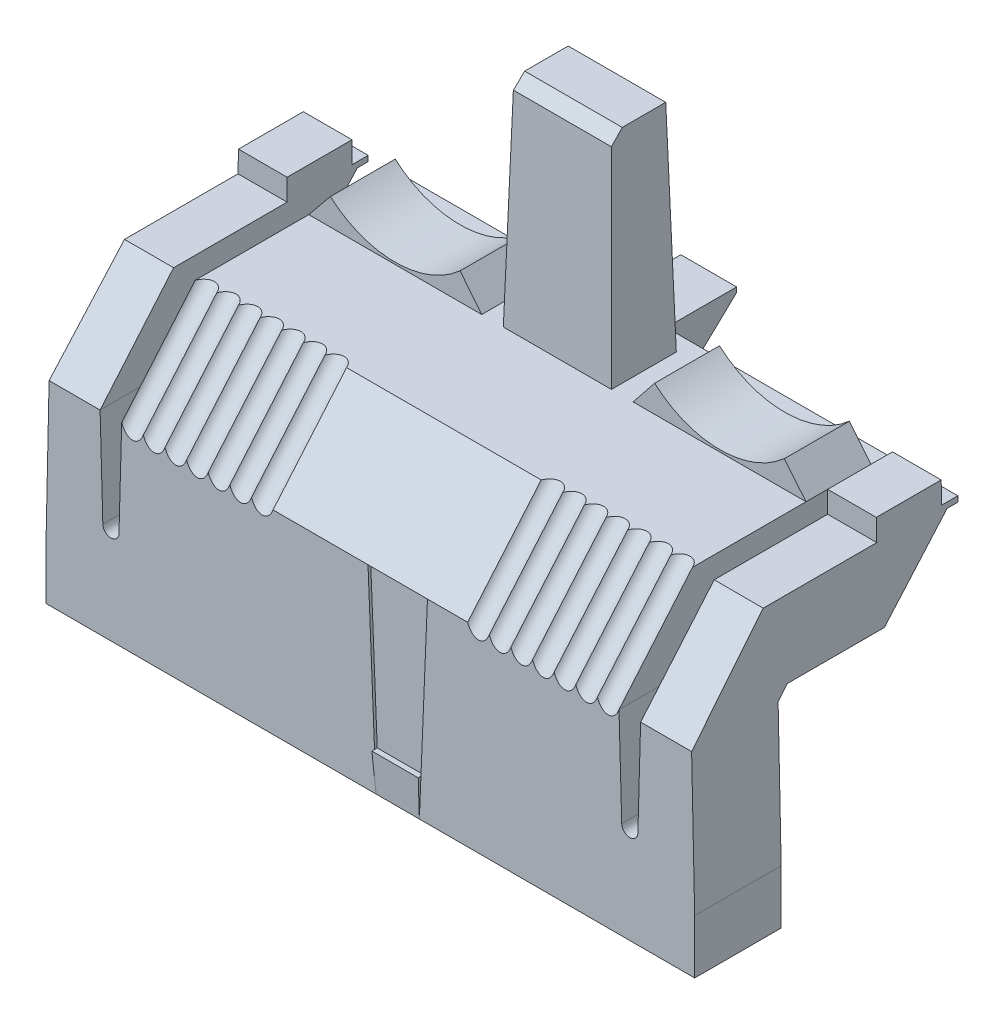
ISO-10303-21;
HEADER;
FILE_DESCRIPTION(('STEP AP214'),'2;1');
FILE_NAME('part.step','',(''),(''),'','','');
FILE_SCHEMA(('AUTOMOTIVE_DESIGN { 1 0 10303 214 1 1 1 1 }'));
ENDSEC;
DATA;
#1=APPLICATION_CONTEXT('core data for automotive mechanical design processes');
#2=APPLICATION_PROTOCOL_DEFINITION('international standard','automotive_design',2000,#1);
#3=PRODUCT_CONTEXT('',#1,'mechanical');
#4=PRODUCT('Part','Part','',(#3));
#5=PRODUCT_RELATED_PRODUCT_CATEGORY('part','',(#4));
#6=PRODUCT_DEFINITION_FORMATION('','',#4);
#7=PRODUCT_DEFINITION_CONTEXT('part definition',#1,'design');
#8=PRODUCT_DEFINITION('design','',#6,#7);
#9=PRODUCT_DEFINITION_SHAPE('','',#8);
#10=(LENGTH_UNIT() NAMED_UNIT(*) SI_UNIT(.MILLI.,.METRE.));
#11=(NAMED_UNIT(*) PLANE_ANGLE_UNIT() SI_UNIT($,.RADIAN.));
#12=(NAMED_UNIT(*) SI_UNIT($,.STERADIAN.) SOLID_ANGLE_UNIT());
#13=UNCERTAINTY_MEASURE_WITH_UNIT(LENGTH_MEASURE(1.E-05),#10,'distance_accuracy_value','');
#14=(GEOMETRIC_REPRESENTATION_CONTEXT(3) GLOBAL_UNCERTAINTY_ASSIGNED_CONTEXT((#13)) GLOBAL_UNIT_ASSIGNED_CONTEXT((#10,
#11,#12)) REPRESENTATION_CONTEXT('',''));
#15=CARTESIAN_POINT('',(0.,0.,0.));
#16=DIRECTION('',(0.,0.,1.));
#17=DIRECTION('',(1.,0.,0.));
#18=AXIS2_PLACEMENT_3D('',#15,#16,#17);
#19=CARTESIAN_POINT('',(30.,-10.,-4.));
#20=DIRECTION('',(0.,0.,1.));
#21=DIRECTION('',(1.,0.,0.));
#22=AXIS2_PLACEMENT_3D('',#19,#20,#21);
#23=PLANE('',#22);
#24=DIRECTION('',(0.,1.,0.));
#25=VECTOR('',#24,1.);
#26=CARTESIAN_POINT('',(-4.,11.22029686,-4.));
#27=LINE('',#26,#25);
#28=CARTESIAN_POINT('',(-4.,-9.5,-4.));
#29=VERTEX_POINT('',#28);
#30=CARTESIAN_POINT('',(-4.,8.,-4.));
#31=VERTEX_POINT('',#30);
#32=EDGE_CURVE('E56',#29,#31,#27,.T.);
#33=ORIENTED_EDGE('',*,*,#32,.F.);
#34=DIRECTION('',(-1.,0.,0.));
#35=VECTOR('',#34,1.);
#36=CARTESIAN_POINT('',(-4.,-9.5,-4.));
#37=LINE('',#36,#35);
#38=CARTESIAN_POINT('',(-3.,-9.5,-4.));
#39=VERTEX_POINT('',#38);
#40=EDGE_CURVE('E1032',#39,#29,#37,.T.);
#41=ORIENTED_EDGE('',*,*,#40,.F.);
#42=DIRECTION('',(0.,-1.,0.));
#43=VECTOR('',#42,1.);
#44=CARTESIAN_POINT('',(-3.,-9.5,-4.));
#45=LINE('',#44,#43);
#46=CARTESIAN_POINT('',(-3.,8.,-4.));
#47=VERTEX_POINT('',#46);
#48=EDGE_CURVE('E1028',#47,#39,#45,.T.);
#49=ORIENTED_EDGE('',*,*,#48,.F.);
#50=DIRECTION('',(-1.,0.,0.));
#51=VECTOR('',#50,1.);
#52=CARTESIAN_POINT('',(30.,8.,-4.));
#53=LINE('',#52,#51);
#54=CARTESIAN_POINT('',(-2.20284119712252,8.,-4.));
#55=VERTEX_POINT('',#54);
#56=EDGE_CURVE('E1213',#55,#47,#53,.T.);
#57=ORIENTED_EDGE('',*,*,#56,.F.);
#58=DIRECTION('',(-1.,0.,0.));
#59=VECTOR('',#58,1.);
#60=CARTESIAN_POINT('',(2.25,8.,-4.));
#61=LINE('',#60,#59);
#62=CARTESIAN_POINT('',(2.20284119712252,8.,-4.));
#63=VERTEX_POINT('',#62);
#64=EDGE_CURVE('E899',#63,#55,#61,.T.);
#65=ORIENTED_EDGE('',*,*,#64,.F.);
#66=CARTESIAN_POINT('',(23.,8.,-4.));
#67=VERTEX_POINT('',#66);
#68=EDGE_CURVE('E1209',#67,#63,#53,.T.);
#69=ORIENTED_EDGE('',*,*,#68,.F.);
#70=DIRECTION('',(0.0280765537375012,-0.999605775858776,0.));
#71=VECTOR('',#70,1.);
#72=CARTESIAN_POINT('',(23.5106967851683,-10.1822691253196,-4.));
#73=LINE('',#72,#71);
#74=CARTESIAN_POINT('',(23.253377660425,-1.02097084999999,-4.));
#75=VERTEX_POINT('',#74);
#76=EDGE_CURVE('E1230',#67,#75,#73,.T.);
#77=ORIENTED_EDGE('',*,*,#76,.T.);
#78=CARTESIAN_POINT('',(24.0000000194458,-0.999999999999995,-4.));
#79=DIRECTION('',(0.,0.,1.));
#80=DIRECTION('',(1.,0.,0.));
#81=AXIS2_PLACEMENT_3D('',#78,#79,#80);
#82=CIRCLE('',#81,0.746916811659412);
#83=CARTESIAN_POINT('',(24.7466223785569,-1.02097084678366,-4.));
#84=VERTEX_POINT('',#83);
#85=EDGE_CURVE('E1233',#75,#84,#82,.T.);
#86=ORIENTED_EDGE('',*,*,#85,.T.);
#87=DIRECTION('',(0.028076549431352,0.999605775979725,0.));
#88=VECTOR('',#87,1.);
#89=CARTESIAN_POINT('',(24.498762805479,-9.84548332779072,-4.));
#90=LINE('',#89,#88);
#91=CARTESIAN_POINT('',(25.,8.,-4.));
#92=VERTEX_POINT('',#91);
#93=EDGE_CURVE('E1236',#84,#92,#90,.T.);
#94=ORIENTED_EDGE('',*,*,#93,.T.);
#95=CARTESIAN_POINT('',(26.747998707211,8.,-4.));
#96=VERTEX_POINT('',#95);
#97=EDGE_CURVE('E1212',#96,#92,#53,.T.);
#98=ORIENTED_EDGE('',*,*,#97,.F.);
#99=DIRECTION('',(-0.0376400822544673,0.999291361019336,0.));
#100=VECTOR('',#99,1.);
#101=CARTESIAN_POINT('',(27.2,-4.,-4.));
#102=LINE('',#101,#100);
#103=CARTESIAN_POINT('',(27.2,-4.,-4.));
#104=VERTEX_POINT('',#103);
#105=EDGE_CURVE('E1007',#104,#96,#102,.T.);
#106=ORIENTED_EDGE('',*,*,#105,.F.);
#107=DIRECTION('',(-1.,0.,0.));
#108=VECTOR('',#107,1.);
#109=CARTESIAN_POINT('',(28.2,-4.,-4.));
#110=LINE('',#109,#108);
#111=CARTESIAN_POINT('',(28.2,-4.,-4.));
#112=VERTEX_POINT('',#111);
#113=EDGE_CURVE('E1003',#112,#104,#110,.T.);
#114=ORIENTED_EDGE('',*,*,#113,.F.);
#115=DIRECTION('',(-0.0376400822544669,-0.999291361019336,0.));
#116=VECTOR('',#115,1.);
#117=CARTESIAN_POINT('',(28.8,11.92915798,-4.));
#118=LINE('',#117,#116);
#119=CARTESIAN_POINT('',(28.652001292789,8.,-4.));
#120=VERTEX_POINT('',#119);
#121=EDGE_CURVE('E1005',#120,#112,#118,.T.);
#122=ORIENTED_EDGE('',*,*,#121,.F.);
#123=CARTESIAN_POINT('',(29.7173913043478,8.,-4.));
#124=VERTEX_POINT('',#123);
#125=EDGE_CURVE('E1215',#124,#120,#53,.T.);
#126=ORIENTED_EDGE('',*,*,#125,.F.);
#127=DIRECTION('',(0.0217339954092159,-0.999763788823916,0.));
#128=VECTOR('',#127,1.);
#129=CARTESIAN_POINT('',(30.108644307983,-9.99763816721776,-4.));
#130=LINE('',#129,#128);
#131=CARTESIAN_POINT('',(30.,-4.99999999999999,-4.));
#132=VERTEX_POINT('',#131);
#133=EDGE_CURVE('E1733',#124,#132,#130,.T.);
#134=ORIENTED_EDGE('',*,*,#133,.T.);
#135=DIRECTION('',(0.,1.,0.));
#136=VECTOR('',#135,1.);
#137=CARTESIAN_POINT('',(30.,-10.,-4.));
#138=LINE('',#137,#136);
#139=CARTESIAN_POINT('',(30.,-10.,-4.));
#140=VERTEX_POINT('',#139);
#141=EDGE_CURVE('E1512',#140,#132,#138,.T.);
#142=ORIENTED_EDGE('',*,*,#141,.F.);
#143=DIRECTION('',(-1.,0.,0.));
#144=VECTOR('',#143,1.);
#145=CARTESIAN_POINT('',(30.,-10.,-4.));
#146=LINE('',#145,#144);
#147=CARTESIAN_POINT('',(-30.,-10.,-4.));
#148=VERTEX_POINT('',#147);
#149=EDGE_CURVE('E1216',#140,#148,#146,.T.);
#150=ORIENTED_EDGE('',*,*,#149,.T.);
#151=DIRECTION('',(0.,1.,0.));
#152=VECTOR('',#151,1.);
#153=CARTESIAN_POINT('',(-30.,-10.,-4.));
#154=LINE('',#153,#152);
#155=CARTESIAN_POINT('',(-30.,-5.00000000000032,-4.));
#156=VERTEX_POINT('',#155);
#157=EDGE_CURVE('E1506',#148,#156,#154,.T.);
#158=ORIENTED_EDGE('',*,*,#157,.T.);
#159=DIRECTION('',(0.0217339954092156,0.999763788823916,0.));
#160=VECTOR('',#159,1.);
#161=CARTESIAN_POINT('',(-30.0803023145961,-8.69390647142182,-4.));
#162=LINE('',#161,#160);
#163=CARTESIAN_POINT('',(-29.7173913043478,8.,-4.));
#164=VERTEX_POINT('',#163);
#165=EDGE_CURVE('E797',#156,#164,#162,.T.);
#166=ORIENTED_EDGE('',*,*,#165,.T.);
#167=CARTESIAN_POINT('',(-28.652001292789,8.,-4.));
#168=VERTEX_POINT('',#167);
#169=EDGE_CURVE('E1612',#168,#164,#53,.T.);
#170=ORIENTED_EDGE('',*,*,#169,.F.);
#171=DIRECTION('',(-0.0376400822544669,0.999291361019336,0.));
#172=VECTOR('',#171,1.);
#173=CARTESIAN_POINT('',(-28.8,11.92915798,-4.));
#174=LINE('',#173,#172);
#175=CARTESIAN_POINT('',(-28.2,-4.,-4.));
#176=VERTEX_POINT('',#175);
#177=EDGE_CURVE('E978',#176,#168,#174,.T.);
#178=ORIENTED_EDGE('',*,*,#177,.F.);
#179=DIRECTION('',(-1.,0.,0.));
#180=VECTOR('',#179,1.);
#181=CARTESIAN_POINT('',(-28.2,-4.,-4.));
#182=LINE('',#181,#180);
#183=CARTESIAN_POINT('',(-27.2,-4.,-4.));
#184=VERTEX_POINT('',#183);
#185=EDGE_CURVE('E981',#184,#176,#182,.T.);
#186=ORIENTED_EDGE('',*,*,#185,.F.);
#187=DIRECTION('',(-0.0376400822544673,-0.999291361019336,0.));
#188=VECTOR('',#187,1.);
#189=CARTESIAN_POINT('',(-27.2,-4.,-4.));
#190=LINE('',#189,#188);
#191=CARTESIAN_POINT('',(-26.747998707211,8.,-4.));
#192=VERTEX_POINT('',#191);
#193=EDGE_CURVE('E984',#192,#184,#190,.T.);
#194=ORIENTED_EDGE('',*,*,#193,.F.);
#195=CARTESIAN_POINT('',(-25.,8.,-4.));
#196=VERTEX_POINT('',#195);
#197=EDGE_CURVE('E1626',#196,#192,#53,.T.);
#198=ORIENTED_EDGE('',*,*,#197,.F.);
#199=DIRECTION('',(0.028076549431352,-0.999605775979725,0.));
#200=VECTOR('',#199,1.);
#201=CARTESIAN_POINT('',(-24.4514652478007,-11.5294121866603,-4.));
#202=LINE('',#201,#200);
#203=CARTESIAN_POINT('',(-24.7466223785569,-1.02097084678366,-4.));
#204=VERTEX_POINT('',#203);
#205=EDGE_CURVE('E1246',#196,#204,#202,.T.);
#206=ORIENTED_EDGE('',*,*,#205,.T.);
#207=CARTESIAN_POINT('',(-24.0000000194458,-1.,-4.));
#208=DIRECTION('',(0.,0.,1.));
#209=DIRECTION('',(1.,0.,0.));
#210=AXIS2_PLACEMENT_3D('',#207,#208,#209);
#211=CIRCLE('',#210,0.746916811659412);
#212=CARTESIAN_POINT('',(-23.253377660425,-1.02097085,-4.));
#213=VERTEX_POINT('',#212);
#214=EDGE_CURVE('E1249',#204,#213,#211,.T.);
#215=ORIENTED_EDGE('',*,*,#214,.T.);
#216=DIRECTION('',(0.028076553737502,0.999605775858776,0.));
#217=VECTOR('',#216,1.);
#218=CARTESIAN_POINT('',(-23.4633992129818,-8.49834000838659,-4.));
#219=LINE('',#218,#217);
#220=CARTESIAN_POINT('',(-23.,8.,-4.));
#221=VERTEX_POINT('',#220);
#222=EDGE_CURVE('E1252',#213,#221,#219,.T.);
#223=ORIENTED_EDGE('',*,*,#222,.T.);
#224=EDGE_CURVE('E1214',#31,#221,#53,.T.);
#225=ORIENTED_EDGE('',*,*,#224,.F.);
#226=EDGE_LOOP('',(#33,#41,#49,#57,#65,#69,#77,#86,#94,#98,#106,#114,#122,#126,#134,#142,#150,
#158,#166,#170,#178,#186,#194,#198,#206,#215,#223,#225));
#227=FACE_BOUND('',#226,.T.);
#228=ADVANCED_FACE('F33',(#227),#23,.F.);
#229=CARTESIAN_POINT('',(30.,8.,-4.));
#230=DIRECTION('',(0.,0.647689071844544,0.761904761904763));
#231=DIRECTION('',(0.,-0.761904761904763,0.647689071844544));
#232=AXIS2_PLACEMENT_3D('',#229,#230,#231);
#233=PLANE('',#232);
#234=DIRECTION('',(0.,0.761904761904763,-0.647689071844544));
#235=VECTOR('',#234,1.);
#236=CARTESIAN_POINT('',(-4.,8.,-4.));
#237=LINE('',#236,#235);
#238=CARTESIAN_POINT('',(-4.,9.,-4.85009190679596));
#239=VERTEX_POINT('',#238);
#240=EDGE_CURVE('E1009',#31,#239,#237,.T.);
#241=ORIENTED_EDGE('',*,*,#240,.F.);
#242=ORIENTED_EDGE('',*,*,#224,.T.);
#243=DIRECTION('',(0.,0.761904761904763,-0.647689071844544));
#244=VECTOR('',#243,1.);
#245=CARTESIAN_POINT('',(-23.,8.,-4.));
#246=LINE('',#245,#244);
#247=CARTESIAN_POINT('',(-23.,9.,-4.85009190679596));
#248=VERTEX_POINT('',#247);
#249=EDGE_CURVE('E762',#221,#248,#246,.T.);
#250=ORIENTED_EDGE('',*,*,#249,.T.);
#251=DIRECTION('',(-1.,0.,0.));
#252=VECTOR('',#251,1.);
#253=CARTESIAN_POINT('',(30.,9.,-4.85009190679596));
#254=LINE('',#253,#252);
#255=EDGE_CURVE('E1207',#239,#248,#254,.T.);
#256=ORIENTED_EDGE('',*,*,#255,.F.);
#257=EDGE_LOOP('',(#241,#242,#250,#256));
#258=FACE_BOUND('',#257,.T.);
#259=ADVANCED_FACE('F1625',(#258),#233,.F.);
#260=DIRECTION('',(0.,-0.761904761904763,0.647689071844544));
#261=VECTOR('',#260,1.);
#262=CARTESIAN_POINT('',(-3.,8.,-4.));
#263=LINE('',#262,#261);
#264=CARTESIAN_POINT('',(-3.,9.,-4.85009190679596));
#265=VERTEX_POINT('',#264);
#266=EDGE_CURVE('E1012',#265,#47,#263,.T.);
#267=ORIENTED_EDGE('',*,*,#266,.F.);
#268=CARTESIAN_POINT('',(-2.25,9.,-4.85009190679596));
#269=VERTEX_POINT('',#268);
#270=EDGE_CURVE('E1206',#269,#265,#254,.T.);
#271=ORIENTED_EDGE('',*,*,#270,.F.);
#272=DIRECTION('',(-0.0359073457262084,0.761413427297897,-0.647271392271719));
#273=VECTOR('',#272,1.);
#274=CARTESIAN_POINT('',(-2.45917617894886,13.4355701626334,-8.62073420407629));
#275=LINE('',#274,#273);
#276=EDGE_CURVE('E907',#269,#55,#275,.F.);
#277=ORIENTED_EDGE('',*,*,#276,.T.);
#278=ORIENTED_EDGE('',*,*,#56,.T.);
#279=EDGE_LOOP('',(#267,#271,#277,#278));
#280=FACE_BOUND('',#279,.T.);
#281=ADVANCED_FACE('F1769',(#280),#233,.F.);
#282=CARTESIAN_POINT('',(30.,9.,-4.85009190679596));
#283=DIRECTION('',(0.,1.,0.));
#284=DIRECTION('',(0.,0.,1.));
#285=AXIS2_PLACEMENT_3D('',#282,#283,#284);
#286=PLANE('',#285);
#287=DIRECTION('',(0.,0.,-1.));
#288=VECTOR('',#287,1.);
#289=CARTESIAN_POINT('',(-4.,9.,-4.85009190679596));
#290=LINE('',#289,#288);
#291=CARTESIAN_POINT('',(-4.,9.,-5.));
#292=VERTEX_POINT('',#291);
#293=EDGE_CURVE('E1358',#239,#292,#290,.T.);
#294=ORIENTED_EDGE('',*,*,#293,.F.);
#295=ORIENTED_EDGE('',*,*,#255,.T.);
#296=DIRECTION('',(0.,0.,-1.));
#297=VECTOR('',#296,1.);
#298=CARTESIAN_POINT('',(-23.,9.,-4.85009190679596));
#299=LINE('',#298,#297);
#300=CARTESIAN_POINT('',(-23.,9.,-13.850091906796));
#301=VERTEX_POINT('',#300);
#302=EDGE_CURVE('E766',#248,#301,#299,.T.);
#303=ORIENTED_EDGE('',*,*,#302,.T.);
#304=DIRECTION('',(-1.,0.,0.));
#305=VECTOR('',#304,1.);
#306=CARTESIAN_POINT('',(30.,9.,-13.850091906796));
#307=LINE('',#306,#305);
#308=CARTESIAN_POINT('',(-2.25,9.,-13.850091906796));
#309=VERTEX_POINT('',#308);
#310=EDGE_CURVE('E1201',#309,#301,#307,.T.);
#311=ORIENTED_EDGE('',*,*,#310,.F.);
#312=DIRECTION('',(0.,0.,1.));
#313=VECTOR('',#312,1.);
#314=CARTESIAN_POINT('',(-2.25,9.,-13.850091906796));
#315=LINE('',#314,#313);
#316=EDGE_CURVE('E905',#309,#269,#315,.T.);
#317=ORIENTED_EDGE('',*,*,#316,.T.);
#318=ORIENTED_EDGE('',*,*,#270,.T.);
#319=DIRECTION('',(0.,0.,1.));
#320=VECTOR('',#319,1.);
#321=CARTESIAN_POINT('',(-3.,9.,-4.85009190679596));
#322=LINE('',#321,#320);
#323=CARTESIAN_POINT('',(-3.,9.,-5.));
#324=VERTEX_POINT('',#323);
#325=EDGE_CURVE('E1355',#324,#265,#322,.T.);
#326=ORIENTED_EDGE('',*,*,#325,.F.);
#327=DIRECTION('',(1.,0.,0.));
#328=VECTOR('',#327,1.);
#329=CARTESIAN_POINT('',(30.,9.,-5.));
#330=LINE('',#329,#328);
#331=EDGE_CURVE('E1352',#292,#324,#330,.T.);
#332=ORIENTED_EDGE('',*,*,#331,.F.);
#333=EDGE_LOOP('',(#294,#295,#303,#311,#317,#318,#326,#332));
#334=FACE_BOUND('',#333,.T.);
#335=ADVANCED_FACE('F1616',(#334),#286,.F.);
#336=DIRECTION('',(-0.028686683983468,0.761591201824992,-0.647422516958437));
#337=VECTOR('',#336,1.);
#338=CARTESIAN_POINT('',(26.7506748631,7.92895181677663,-3.93960251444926));
#339=LINE('',#338,#337);
#340=CARTESIAN_POINT('',(26.7103319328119,9.,-4.85009190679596));
#341=VERTEX_POINT('',#340);
#342=EDGE_CURVE('E987',#96,#341,#339,.T.);
#343=ORIENTED_EDGE('',*,*,#342,.F.);
#344=ORIENTED_EDGE('',*,*,#97,.T.);
#345=DIRECTION('',(0.,0.761904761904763,-0.647689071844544));
#346=VECTOR('',#345,1.);
#347=CARTESIAN_POINT('',(25.,7.99999999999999,-4.));
#348=LINE('',#347,#346);
#349=CARTESIAN_POINT('',(25.,9.,-4.85009190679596));
#350=VERTEX_POINT('',#349);
#351=EDGE_CURVE('E1486',#92,#350,#348,.T.);
#352=ORIENTED_EDGE('',*,*,#351,.T.);
#353=EDGE_CURVE('E1205',#341,#350,#254,.T.);
#354=ORIENTED_EDGE('',*,*,#353,.F.);
#355=EDGE_LOOP('',(#343,#344,#352,#354));
#356=FACE_BOUND('',#355,.T.);
#357=ADVANCED_FACE('F2202',(#356),#233,.F.);
#358=DIRECTION('',(-0.0286866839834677,-0.761591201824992,0.647422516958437));
#359=VECTOR('',#358,1.);
#360=CARTESIAN_POINT('',(28.6531105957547,8.02945043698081,-4.02503557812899));
#361=LINE('',#360,#359);
#362=CARTESIAN_POINT('',(28.6896680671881,9.,-4.85009190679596));
#363=VERTEX_POINT('',#362);
#364=EDGE_CURVE('E989',#363,#120,#361,.T.);
#365=ORIENTED_EDGE('',*,*,#364,.F.);
#366=CARTESIAN_POINT('',(29.695652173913,9.,-4.85009190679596));
#367=VERTEX_POINT('',#366);
#368=EDGE_CURVE('E1208',#367,#363,#254,.T.);
#369=ORIENTED_EDGE('',*,*,#368,.F.);
#370=DIRECTION('',(0.0165608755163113,-0.76180027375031,0.647600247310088));
#371=VECTOR('',#370,1.);
#372=CARTESIAN_POINT('',(29.7174688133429,7.99643458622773,-3.99696907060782));
#373=LINE('',#372,#371);
#374=EDGE_CURVE('E1730',#367,#124,#373,.T.);
#375=ORIENTED_EDGE('',*,*,#374,.T.);
#376=ORIENTED_EDGE('',*,*,#125,.T.);
#377=EDGE_LOOP('',(#365,#369,#375,#376));
#378=FACE_BOUND('',#377,.T.);
#379=ADVANCED_FACE('F1742',(#378),#233,.F.);
#380=DIRECTION('',(0.,0.,-1.));
#381=VECTOR('',#380,1.);
#382=CARTESIAN_POINT('',(26.7103319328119,9.,-4.85009190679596));
#383=LINE('',#382,#381);
#384=CARTESIAN_POINT('',(26.7103319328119,9.,-5.));
#385=VERTEX_POINT('',#384);
#386=EDGE_CURVE('E1349',#341,#385,#383,.T.);
#387=ORIENTED_EDGE('',*,*,#386,.F.);
#388=ORIENTED_EDGE('',*,*,#353,.T.);
#389=DIRECTION('',(0.,0.,-1.));
#390=VECTOR('',#389,1.);
#391=CARTESIAN_POINT('',(25.,9.,-4.85009190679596));
#392=LINE('',#391,#390);
#393=CARTESIAN_POINT('',(25.,9.,-13.850091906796));
#394=VERTEX_POINT('',#393);
#395=EDGE_CURVE('E1483',#350,#394,#392,.T.);
#396=ORIENTED_EDGE('',*,*,#395,.T.);
#397=CARTESIAN_POINT('',(29.695652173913,9.,-13.850091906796));
#398=VERTEX_POINT('',#397);
#399=EDGE_CURVE('E1200',#398,#394,#307,.T.);
#400=ORIENTED_EDGE('',*,*,#399,.F.);
#401=DIRECTION('',(0.,0.,1.));
#402=VECTOR('',#401,1.);
#403=CARTESIAN_POINT('',(29.695652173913,9.,-4.85009190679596));
#404=LINE('',#403,#402);
#405=EDGE_CURVE('E1727',#398,#367,#404,.T.);
#406=ORIENTED_EDGE('',*,*,#405,.T.);
#407=ORIENTED_EDGE('',*,*,#368,.T.);
#408=DIRECTION('',(0.,0.,1.));
#409=VECTOR('',#408,1.);
#410=CARTESIAN_POINT('',(28.6896680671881,9.,-4.85009190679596));
#411=LINE('',#410,#409);
#412=CARTESIAN_POINT('',(28.6896680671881,9.,-5.));
#413=VERTEX_POINT('',#412);
#414=EDGE_CURVE('E1347',#413,#363,#411,.T.);
#415=ORIENTED_EDGE('',*,*,#414,.F.);
#416=DIRECTION('',(-1.,0.,0.));
#417=VECTOR('',#416,1.);
#418=CARTESIAN_POINT('',(30.,9.,-5.));
#419=LINE('',#418,#417);
#420=EDGE_CURVE('E1344',#413,#385,#419,.T.);
#421=ORIENTED_EDGE('',*,*,#420,.T.);
#422=EDGE_LOOP('',(#387,#388,#396,#400,#406,#407,#415,#421));
#423=FACE_BOUND('',#422,.T.);
#424=ADVANCED_FACE('F1744',(#423),#286,.F.);
#425=DIRECTION('',(-0.028686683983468,-0.761591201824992,0.647422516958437));
#426=VECTOR('',#425,1.);
#427=CARTESIAN_POINT('',(-26.7012993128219,9.23980338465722,-5.05394682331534));
#428=LINE('',#427,#426);
#429=CARTESIAN_POINT('',(-26.7103319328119,9.,-4.85009190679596));
#430=VERTEX_POINT('',#429);
#431=EDGE_CURVE('E959',#430,#192,#428,.T.);
#432=ORIENTED_EDGE('',*,*,#431,.F.);
#433=CARTESIAN_POINT('',(-25.,9.,-4.85009190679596));
#434=VERTEX_POINT('',#433);
#435=EDGE_CURVE('E1601',#434,#430,#254,.T.);
#436=ORIENTED_EDGE('',*,*,#435,.F.);
#437=DIRECTION('',(0.,-0.761904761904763,0.647689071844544));
#438=VECTOR('',#437,1.);
#439=CARTESIAN_POINT('',(-25.,8.00000000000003,-4.00000000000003));
#440=LINE('',#439,#438);
#441=EDGE_CURVE('E775',#434,#196,#440,.T.);
#442=ORIENTED_EDGE('',*,*,#441,.T.);
#443=ORIENTED_EDGE('',*,*,#197,.T.);
#444=EDGE_LOOP('',(#432,#436,#442,#443));
#445=FACE_BOUND('',#444,.T.);
#446=ADVANCED_FACE('F1771',(#445),#233,.F.);
#447=DIRECTION('',(-0.0286866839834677,0.761591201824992,-0.647422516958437));
#448=VECTOR('',#447,1.);
#449=CARTESIAN_POINT('',(-28.6037350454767,6.71859886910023,-2.91069126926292));
#450=LINE('',#449,#448);
#451=CARTESIAN_POINT('',(-28.6896680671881,9.,-4.85009190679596));
#452=VERTEX_POINT('',#451);
#453=EDGE_CURVE('E962',#168,#452,#450,.T.);
#454=ORIENTED_EDGE('',*,*,#453,.F.);
#455=ORIENTED_EDGE('',*,*,#169,.T.);
#456=DIRECTION('',(0.0165608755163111,0.76180027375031,-0.647600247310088));
#457=VECTOR('',#456,1.);
#458=CARTESIAN_POINT('',(-29.7010130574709,8.75339935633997,-4.64045869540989));
#459=LINE('',#458,#457);
#460=CARTESIAN_POINT('',(-29.695652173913,9.,-4.85009190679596));
#461=VERTEX_POINT('',#460);
#462=EDGE_CURVE('E800',#164,#461,#459,.T.);
#463=ORIENTED_EDGE('',*,*,#462,.T.);
#464=EDGE_CURVE('E1597',#452,#461,#254,.T.);
#465=ORIENTED_EDGE('',*,*,#464,.F.);
#466=EDGE_LOOP('',(#454,#455,#463,#465));
#467=FACE_BOUND('',#466,.T.);
#468=ADVANCED_FACE('F1636',(#467),#233,.F.);
#469=DIRECTION('',(0.,0.,1.));
#470=VECTOR('',#469,1.);
#471=CARTESIAN_POINT('',(-26.7103319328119,9.,-4.85009190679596));
#472=LINE('',#471,#470);
#473=CARTESIAN_POINT('',(-26.7103319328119,9.,-5.));
#474=VERTEX_POINT('',#473);
#475=EDGE_CURVE('E1341',#474,#430,#472,.T.);
#476=ORIENTED_EDGE('',*,*,#475,.F.);
#477=DIRECTION('',(1.,0.,0.));
#478=VECTOR('',#477,1.);
#479=CARTESIAN_POINT('',(30.,9.,-5.));
#480=LINE('',#479,#478);
#481=CARTESIAN_POINT('',(-28.6896680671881,9.,-5.));
#482=VERTEX_POINT('',#481);
#483=EDGE_CURVE('E1286',#482,#474,#480,.T.);
#484=ORIENTED_EDGE('',*,*,#483,.F.);
#485=DIRECTION('',(0.,0.,-1.));
#486=VECTOR('',#485,1.);
#487=CARTESIAN_POINT('',(-28.6896680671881,9.,-4.85009190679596));
#488=LINE('',#487,#486);
#489=EDGE_CURVE('E1338',#452,#482,#488,.T.);
#490=ORIENTED_EDGE('',*,*,#489,.F.);
#491=ORIENTED_EDGE('',*,*,#464,.T.);
#492=DIRECTION('',(0.,0.,-1.));
#493=VECTOR('',#492,1.);
#494=CARTESIAN_POINT('',(-29.695652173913,9.,-4.85009190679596));
#495=LINE('',#494,#493);
#496=CARTESIAN_POINT('',(-29.695652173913,9.,-13.850091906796));
#497=VERTEX_POINT('',#496);
#498=EDGE_CURVE('E803',#461,#497,#495,.T.);
#499=ORIENTED_EDGE('',*,*,#498,.T.);
#500=CARTESIAN_POINT('',(-25.,9.,-13.850091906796));
#501=VERTEX_POINT('',#500);
#502=EDGE_CURVE('E1589',#501,#497,#307,.T.);
#503=ORIENTED_EDGE('',*,*,#502,.F.);
#504=DIRECTION('',(0.,0.,1.));
#505=VECTOR('',#504,1.);
#506=CARTESIAN_POINT('',(-25.,9.,-4.85009190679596));
#507=LINE('',#506,#505);
#508=EDGE_CURVE('E778',#501,#434,#507,.T.);
#509=ORIENTED_EDGE('',*,*,#508,.T.);
#510=ORIENTED_EDGE('',*,*,#435,.T.);
#511=EDGE_LOOP('',(#476,#484,#490,#491,#499,#503,#509,#510));
#512=FACE_BOUND('',#511,.T.);
#513=ADVANCED_FACE('F1777',(#512),#286,.F.);
#514=CARTESIAN_POINT('',(30.,-10.,4.));
#515=DIRECTION('',(0.,1.,0.));
#516=DIRECTION('',(0.,0.,1.));
#517=AXIS2_PLACEMENT_3D('',#514,#515,#516);
#518=PLANE('',#517);
#519=DIRECTION('',(-1.,0.,0.));
#520=VECTOR('',#519,1.);
#521=CARTESIAN_POINT('',(30.,-10.,4.));
#522=LINE('',#521,#520);
#523=CARTESIAN_POINT('',(4.53260869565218,-10.,4.));
#524=VERTEX_POINT('',#523);
#525=CARTESIAN_POINT('',(0.532608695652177,-10.,4.));
#526=VERTEX_POINT('',#525);
#527=EDGE_CURVE('E956',#524,#526,#522,.T.);
#528=ORIENTED_EDGE('',*,*,#527,.T.);
#529=DIRECTION('',(-1.,0.,0.));
#530=VECTOR('',#529,1.);
#531=CARTESIAN_POINT('',(30.,-10.,4.));
#532=LINE('',#531,#530);
#533=CARTESIAN_POINT('',(-30.,-10.,4.));
#534=VERTEX_POINT('',#533);
#535=EDGE_CURVE('E1219',#526,#534,#532,.T.);
#536=ORIENTED_EDGE('',*,*,#535,.T.);
#537=DIRECTION('',(0.,0.,-1.));
#538=VECTOR('',#537,1.);
#539=CARTESIAN_POINT('',(-30.,-10.,4.));
#540=LINE('',#539,#538);
#541=EDGE_CURVE('E1504',#534,#148,#540,.T.);
#542=ORIENTED_EDGE('',*,*,#541,.T.);
#543=ORIENTED_EDGE('',*,*,#149,.F.);
#544=DIRECTION('',(0.,0.,-1.));
#545=VECTOR('',#544,1.);
#546=CARTESIAN_POINT('',(30.,-10.,4.));
#547=LINE('',#546,#545);
#548=CARTESIAN_POINT('',(30.,-10.,4.));
#549=VERTEX_POINT('',#548);
#550=EDGE_CURVE('E1511',#549,#140,#547,.T.);
#551=ORIENTED_EDGE('',*,*,#550,.F.);
#552=EDGE_CURVE('E1220',#549,#524,#532,.T.);
#553=ORIENTED_EDGE('',*,*,#552,.T.);
#554=EDGE_LOOP('',(#528,#536,#542,#543,#551,#553));
#555=FACE_BOUND('',#554,.T.);
#556=ADVANCED_FACE('F1774',(#555),#518,.F.);
#557=CARTESIAN_POINT('',(0.386775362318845,-6.5,4.25));
#558=DIRECTION('',(0.999133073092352,0.0416305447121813,0.));
#559=DIRECTION('',(-0.0416305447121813,0.999133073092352,0.));
#560=AXIS2_PLACEMENT_3D('',#557,#558,#559);
#561=PLANE('',#560);
#562=DIRECTION('',(0.0415249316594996,-0.996598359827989,-0.0711855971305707));
#563=VECTOR('',#562,1.);
#564=CARTESIAN_POINT('',(0.386775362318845,-6.5,4.25));
#565=LINE('',#564,#563);
#566=CARTESIAN_POINT('',(0.386775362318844,-6.5,4.25));
#567=VERTEX_POINT('',#566);
#568=EDGE_CURVE('E952',#567,#526,#565,.T.);
#569=ORIENTED_EDGE('',*,*,#568,.F.);
#570=DIRECTION('',(0.,0.,-1.));
#571=VECTOR('',#570,1.);
#572=CARTESIAN_POINT('',(0.386775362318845,-6.5,4.25));
#573=LINE('',#572,#571);
#574=CARTESIAN_POINT('',(0.386775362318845,-6.5,4.));
#575=VERTEX_POINT('',#574);
#576=EDGE_CURVE('E943',#567,#575,#573,.T.);
#577=ORIENTED_EDGE('',*,*,#576,.T.);
#578=DIRECTION('',(0.0416305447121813,-0.999133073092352,0.));
#579=VECTOR('',#578,1.);
#580=CARTESIAN_POINT('',(0.583678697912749,-11.2256800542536,4.));
#581=LINE('',#580,#579);
#582=EDGE_CURVE('E936',#575,#526,#581,.T.);
#583=ORIENTED_EDGE('',*,*,#582,.T.);
#584=EDGE_LOOP('',(#569,#577,#583));
#585=FACE_BOUND('',#584,.T.);
#586=ADVANCED_FACE('F1650',(#585),#561,.F.);
#587=CARTESIAN_POINT('',(4.53260869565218,-10.,4.25));
#588=DIRECTION('',(-0.999133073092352,0.0416305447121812,0.));
#589=DIRECTION('',(-0.0416305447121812,-0.999133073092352,0.));
#590=AXIS2_PLACEMENT_3D('',#587,#588,#589);
#591=PLANE('',#590);
#592=DIRECTION('',(0.0415249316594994,0.996598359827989,0.0711855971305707));
#593=VECTOR('',#592,1.);
#594=CARTESIAN_POINT('',(4.53334768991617,-9.98226413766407,4.00126684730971));
#595=LINE('',#594,#593);
#596=CARTESIAN_POINT('',(4.67844202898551,-6.5,4.25));
#597=VERTEX_POINT('',#596);
#598=EDGE_CURVE('E954',#524,#597,#595,.T.);
#599=ORIENTED_EDGE('',*,*,#598,.F.);
#600=DIRECTION('',(0.0416305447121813,0.999133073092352,0.));
#601=VECTOR('',#600,1.);
#602=CARTESIAN_POINT('',(4.53260869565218,-10.,4.));
#603=LINE('',#602,#601);
#604=CARTESIAN_POINT('',(4.67844202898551,-6.5,4.));
#605=VERTEX_POINT('',#604);
#606=EDGE_CURVE('E926',#524,#605,#603,.T.);
#607=ORIENTED_EDGE('',*,*,#606,.T.);
#608=DIRECTION('',(0.,0.,-1.));
#609=VECTOR('',#608,1.);
#610=CARTESIAN_POINT('',(4.67844202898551,-6.5,4.25));
#611=LINE('',#610,#609);
#612=EDGE_CURVE('E939',#597,#605,#611,.T.);
#613=ORIENTED_EDGE('',*,*,#612,.F.);
#614=EDGE_LOOP('',(#599,#607,#613));
#615=FACE_BOUND('',#614,.T.);
#616=ADVANCED_FACE('F2135',(#615),#591,.F.);
#617=CARTESIAN_POINT('',(4.53260869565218,-10.,3.75));
#618=DIRECTION('',(0.999133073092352,-0.0416305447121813,0.));
#619=DIRECTION('',(0.0416305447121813,0.999133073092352,0.));
#620=AXIS2_PLACEMENT_3D('',#617,#618,#619);
#621=PLANE('',#620);
#622=CARTESIAN_POINT('',(4.67844202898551,-6.5,3.75));
#623=VERTEX_POINT('',#622);
#624=EDGE_CURVE('E942',#605,#623,#611,.T.);
#625=ORIENTED_EDGE('',*,*,#624,.F.);
#626=CARTESIAN_POINT('',(5.28260869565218,8.,4.));
#627=VERTEX_POINT('',#626);
#628=EDGE_CURVE('E929',#605,#627,#603,.T.);
#629=ORIENTED_EDGE('',*,*,#628,.T.);
#630=DIRECTION('',(0.,0.,1.));
#631=VECTOR('',#630,1.);
#632=CARTESIAN_POINT('',(5.28260869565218,8.,3.75));
#633=LINE('',#632,#631);
#634=CARTESIAN_POINT('',(5.28260869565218,8.,3.75));
#635=VERTEX_POINT('',#634);
#636=EDGE_CURVE('E915',#635,#627,#633,.T.);
#637=ORIENTED_EDGE('',*,*,#636,.F.);
#638=DIRECTION('',(0.0416305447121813,0.999133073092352,0.));
#639=VECTOR('',#638,1.);
#640=CARTESIAN_POINT('',(4.53260869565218,-10.,3.75));
#641=LINE('',#640,#639);
#642=EDGE_CURVE('E916',#623,#635,#641,.T.);
#643=ORIENTED_EDGE('',*,*,#642,.F.);
#644=EDGE_LOOP('',(#625,#629,#637,#643));
#645=FACE_BOUND('',#644,.T.);
#646=ADVANCED_FACE('F2130',(#645),#621,.F.);
#647=CARTESIAN_POINT('',(-0.217391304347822,8.,3.75));
#648=DIRECTION('',(-0.999133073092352,-0.0416305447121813,0.));
#649=DIRECTION('',(0.0416305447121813,-0.999133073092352,0.));
#650=AXIS2_PLACEMENT_3D('',#647,#648,#649);
#651=PLANE('',#650);
#652=CARTESIAN_POINT('',(0.386775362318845,-6.5,3.75));
#653=VERTEX_POINT('',#652);
#654=EDGE_CURVE('E946',#575,#653,#573,.T.);
#655=ORIENTED_EDGE('',*,*,#654,.T.);
#656=DIRECTION('',(0.0416305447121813,-0.999133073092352,0.));
#657=VECTOR('',#656,1.);
#658=CARTESIAN_POINT('',(-0.217391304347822,8.,3.75));
#659=LINE('',#658,#657);
#660=CARTESIAN_POINT('',(-0.217391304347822,8.,3.75));
#661=VERTEX_POINT('',#660);
#662=EDGE_CURVE('E921',#661,#653,#659,.T.);
#663=ORIENTED_EDGE('',*,*,#662,.F.);
#664=DIRECTION('',(0.,0.,1.));
#665=VECTOR('',#664,1.);
#666=CARTESIAN_POINT('',(-0.217391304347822,8.,3.75));
#667=LINE('',#666,#665);
#668=CARTESIAN_POINT('',(-0.217391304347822,8.,4.));
#669=VERTEX_POINT('',#668);
#670=EDGE_CURVE('E913',#661,#669,#667,.T.);
#671=ORIENTED_EDGE('',*,*,#670,.T.);
#672=DIRECTION('',(0.0416305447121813,-0.999133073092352,0.));
#673=VECTOR('',#672,1.);
#674=CARTESIAN_POINT('',(-0.217391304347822,8.,4.));
#675=LINE('',#674,#673);
#676=EDGE_CURVE('E930',#669,#575,#675,.T.);
#677=ORIENTED_EDGE('',*,*,#676,.T.);
#678=EDGE_LOOP('',(#655,#663,#671,#677));
#679=FACE_BOUND('',#678,.T.);
#680=ADVANCED_FACE('F1660',(#679),#651,.F.);
#681=CARTESIAN_POINT('',(5.28260869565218,8.,3.75));
#682=DIRECTION('',(0.,0.,-1.));
#683=DIRECTION('',(-1.,0.,0.));
#684=AXIS2_PLACEMENT_3D('',#681,#682,#683);
#685=PLANE('',#684);
#686=DIRECTION('',(-1.,0.,0.));
#687=VECTOR('',#686,1.);
#688=CARTESIAN_POINT('',(4.67844202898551,-6.5,3.75));
#689=LINE('',#688,#687);
#690=EDGE_CURVE('E949',#623,#653,#689,.T.);
#691=ORIENTED_EDGE('',*,*,#690,.F.);
#692=ORIENTED_EDGE('',*,*,#642,.T.);
#693=DIRECTION('',(-1.,0.,0.));
#694=VECTOR('',#693,1.);
#695=CARTESIAN_POINT('',(5.28260869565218,8.,3.75));
#696=LINE('',#695,#694);
#697=EDGE_CURVE('E923',#635,#661,#696,.T.);
#698=ORIENTED_EDGE('',*,*,#697,.T.);
#699=ORIENTED_EDGE('',*,*,#662,.T.);
#700=EDGE_LOOP('',(#691,#692,#698,#699));
#701=FACE_BOUND('',#700,.T.);
#702=ADVANCED_FACE('F2147',(#701),#685,.F.);
#703=CARTESIAN_POINT('',(30.,-10.,4.));
#704=DIRECTION('',(0.,0.,-1.));
#705=DIRECTION('',(-1.,0.,0.));
#706=AXIS2_PLACEMENT_3D('',#703,#704,#705);
#707=PLANE('',#706);
#708=CARTESIAN_POINT('',(12.,8.84360919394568,4.));
#709=DIRECTION('',(0.,0.,-1.));
#710=DIRECTION('',(0.,1.,0.));
#711=AXIS2_PLACEMENT_3D('',#708,#709,#710);
#712=ELLIPSE('',#711,1.75939201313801,1.13953898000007);
#713=CARTESIAN_POINT('',(13.,7.99999999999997,3.99999999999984));
#714=VERTEX_POINT('',#713);
#715=CARTESIAN_POINT('',(11.,7.99999999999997,3.99999999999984));
#716=VERTEX_POINT('',#715);
#717=EDGE_CURVE('E1113',#714,#716,#712,.T.);
#718=ORIENTED_EDGE('',*,*,#717,.T.);
#719=CARTESIAN_POINT('',(9.99999999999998,8.84360919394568,4.));
#720=DIRECTION('',(0.,0.,-1.));
#721=DIRECTION('',(0.,1.,0.));
#722=AXIS2_PLACEMENT_3D('',#719,#720,#721);
#723=ELLIPSE('',#722,1.75939201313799,1.13953898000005);
#724=CARTESIAN_POINT('',(8.99999999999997,8.00000000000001,3.99999999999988));
#725=VERTEX_POINT('',#724);
#726=EDGE_CURVE('E1094',#716,#725,#723,.T.);
#727=ORIENTED_EDGE('',*,*,#726,.T.);
#728=DIRECTION('',(-1.,0.,0.));
#729=VECTOR('',#728,1.);
#730=CARTESIAN_POINT('',(30.,8.,4.));
#731=LINE('',#730,#729);
#732=EDGE_CURVE('E1153',#725,#627,#731,.T.);
#733=ORIENTED_EDGE('',*,*,#732,.T.);
#734=ORIENTED_EDGE('',*,*,#628,.F.);
#735=ORIENTED_EDGE('',*,*,#606,.F.);
#736=ORIENTED_EDGE('',*,*,#552,.F.);
#737=DIRECTION('',(0.,-1.,0.));
#738=VECTOR('',#737,1.);
#739=CARTESIAN_POINT('',(30.,-10.,4.));
#740=LINE('',#739,#738);
#741=CARTESIAN_POINT('',(30.,-4.99999999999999,4.));
#742=VERTEX_POINT('',#741);
#743=EDGE_CURVE('E1509',#742,#549,#740,.T.);
#744=ORIENTED_EDGE('',*,*,#743,.F.);
#745=DIRECTION('',(0.0217339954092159,-0.999763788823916,0.));
#746=VECTOR('',#745,1.);
#747=CARTESIAN_POINT('',(30.,-4.99999999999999,4.));
#748=LINE('',#747,#746);
#749=CARTESIAN_POINT('',(29.7173913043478,8.,4.));
#750=VERTEX_POINT('',#749);
#751=EDGE_CURVE('E736',#750,#742,#748,.T.);
#752=ORIENTED_EDGE('',*,*,#751,.F.);
#753=CARTESIAN_POINT('',(25.,8.00000000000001,4.));
#754=VERTEX_POINT('',#753);
#755=EDGE_CURVE('E1165',#750,#754,#731,.T.);
#756=ORIENTED_EDGE('',*,*,#755,.T.);
#757=DIRECTION('',(0.028076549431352,0.999605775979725,0.));
#758=VECTOR('',#757,1.);
#759=CARTESIAN_POINT('',(25.,8.00000000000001,4.));
#760=LINE('',#759,#758);
#761=CARTESIAN_POINT('',(24.7466223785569,-1.02097084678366,4.));
#762=VERTEX_POINT('',#761);
#763=EDGE_CURVE('E738',#762,#754,#760,.T.);
#764=ORIENTED_EDGE('',*,*,#763,.F.);
#765=CARTESIAN_POINT('',(24.0000000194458,-0.999999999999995,4.));
#766=DIRECTION('',(0.,0.,1.));
#767=DIRECTION('',(-1.,0.,0.));
#768=AXIS2_PLACEMENT_3D('',#765,#766,#767);
#769=CIRCLE('',#768,0.746916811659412);
#770=CARTESIAN_POINT('',(23.253377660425,-1.02097084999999,4.));
#771=VERTEX_POINT('',#770);
#772=EDGE_CURVE('E741',#771,#762,#769,.T.);
#773=ORIENTED_EDGE('',*,*,#772,.F.);
#774=DIRECTION('',(0.0280765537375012,-0.999605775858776,0.));
#775=VECTOR('',#774,1.);
#776=CARTESIAN_POINT('',(23.,8.,4.));
#777=LINE('',#776,#775);
#778=CARTESIAN_POINT('',(23.,8.,4.));
#779=VERTEX_POINT('',#778);
#780=EDGE_CURVE('E744',#779,#771,#777,.T.);
#781=ORIENTED_EDGE('',*,*,#780,.F.);
#782=CARTESIAN_POINT('',(22.,8.84360919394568,4.));
#783=DIRECTION('',(0.,0.,-1.));
#784=DIRECTION('',(0.,1.,0.));
#785=AXIS2_PLACEMENT_3D('',#782,#783,#784);
#786=ELLIPSE('',#785,1.75939201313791,1.13953898);
#787=CARTESIAN_POINT('',(21.,8.00000000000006,3.99999999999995));
#788=VERTEX_POINT('',#787);
#789=EDGE_CURVE('E675',#779,#788,#786,.T.);
#790=ORIENTED_EDGE('',*,*,#789,.T.);
#791=CARTESIAN_POINT('',(20.,8.84360919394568,4.));
#792=DIRECTION('',(0.,0.,-1.));
#793=DIRECTION('',(0.,1.,0.));
#794=AXIS2_PLACEMENT_3D('',#791,#792,#793);
#795=ELLIPSE('',#794,1.75939201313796,1.13953898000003);
#796=CARTESIAN_POINT('',(19.,7.99999999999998,3.99999999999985));
#797=VERTEX_POINT('',#796);
#798=EDGE_CURVE('E1125',#788,#797,#795,.T.);
#799=ORIENTED_EDGE('',*,*,#798,.T.);
#800=CARTESIAN_POINT('',(18.,8.84360919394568,4.));
#801=DIRECTION('',(0.,0.,-1.));
#802=DIRECTION('',(0.,1.,0.));
#803=AXIS2_PLACEMENT_3D('',#800,#801,#802);
#804=ELLIPSE('',#803,1.75939201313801,1.13953898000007);
#805=CARTESIAN_POINT('',(17.,7.99999999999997,3.99999999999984));
#806=VERTEX_POINT('',#805);
#807=EDGE_CURVE('E1122',#797,#806,#804,.T.);
#808=ORIENTED_EDGE('',*,*,#807,.T.);
#809=CARTESIAN_POINT('',(16.,8.84360919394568,4.));
#810=DIRECTION('',(0.,0.,-1.));
#811=DIRECTION('',(0.,1.,0.));
#812=AXIS2_PLACEMENT_3D('',#809,#810,#811);
#813=ELLIPSE('',#812,1.75939201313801,1.13953898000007);
#814=CARTESIAN_POINT('',(15.,7.99999999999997,3.99999999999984));
#815=VERTEX_POINT('',#814);
#816=EDGE_CURVE('E1119',#806,#815,#813,.T.);
#817=ORIENTED_EDGE('',*,*,#816,.T.);
#818=CARTESIAN_POINT('',(14.,8.84360919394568,4.));
#819=DIRECTION('',(0.,0.,-1.));
#820=DIRECTION('',(0.,1.,0.));
#821=AXIS2_PLACEMENT_3D('',#818,#819,#820);
#822=ELLIPSE('',#821,1.75939201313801,1.13953898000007);
#823=EDGE_CURVE('E1116',#815,#714,#822,.T.);
#824=ORIENTED_EDGE('',*,*,#823,.T.);
#825=EDGE_LOOP('',(#718,#727,#733,#734,#735,#736,#744,#752,#756,#764,#773,#781,#790,#799,#808,
#817,#824));
#826=FACE_BOUND('',#825,.T.);
#827=ADVANCED_FACE('F1390',(#826),#707,.F.);
#828=CARTESIAN_POINT('',(30.,16.,-20.8007352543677));
#829=DIRECTION('',(0.,0.,1.));
#830=DIRECTION('',(0.,-1.,0.));
#831=AXIS2_PLACEMENT_3D('',#828,#829,#830);
#832=PLANE('',#831);
#833=DIRECTION('',(-0.0471064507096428,-0.99888987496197,0.));
#834=VECTOR('',#833,1.);
#835=CARTESIAN_POINT('',(2.25,8.99999999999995,-20.8007352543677));
#836=LINE('',#835,#834);
#837=CARTESIAN_POINT('',(2.58011162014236,16.,-20.8007352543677));
#838=VERTEX_POINT('',#837);
#839=CARTESIAN_POINT('',(2.55653221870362,15.5,-20.8007352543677));
#840=VERTEX_POINT('',#839);
#841=EDGE_CURVE('E1299',#838,#840,#836,.T.);
#842=ORIENTED_EDGE('',*,*,#841,.F.);
#843=DIRECTION('',(-1.,0.,0.));
#844=VECTOR('',#843,1.);
#845=CARTESIAN_POINT('',(30.,16.,-20.8007352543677));
#846=LINE('',#845,#844);
#847=CARTESIAN_POINT('',(23.,16.,-20.8007352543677));
#848=VERTEX_POINT('',#847);
#849=EDGE_CURVE('E1182',#848,#838,#846,.T.);
#850=ORIENTED_EDGE('',*,*,#849,.F.);
#851=DIRECTION('',(0.,-1.,0.));
#852=VECTOR('',#851,1.);
#853=CARTESIAN_POINT('',(23.,16.,-20.8007352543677));
#854=LINE('',#853,#852);
#855=CARTESIAN_POINT('',(23.,15.5,-20.8007352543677));
#856=VERTEX_POINT('',#855);
#857=EDGE_CURVE('E733',#848,#856,#854,.T.);
#858=ORIENTED_EDGE('',*,*,#857,.T.);
#859=DIRECTION('',(-1.,0.,0.));
#860=VECTOR('',#859,1.);
#861=CARTESIAN_POINT('',(30.,15.5,-20.8007352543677));
#862=LINE('',#861,#860);
#863=EDGE_CURVE('E1187',#856,#840,#862,.T.);
#864=ORIENTED_EDGE('',*,*,#863,.T.);
#865=EDGE_LOOP('',(#842,#850,#858,#864));
#866=FACE_BOUND('',#865,.T.);
#867=ADVANCED_FACE('F1444',(#866),#832,.F.);
#868=CARTESIAN_POINT('',(30.,15.5,-19.8007352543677));
#869=DIRECTION('',(0.,0.675250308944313,0.737588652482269));
#870=DIRECTION('',(0.,-0.737588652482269,0.675250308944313));
#871=AXIS2_PLACEMENT_3D('',#868,#869,#870);
#872=PLANE('',#871);
#873=DIRECTION('',(-0.0347627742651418,0.737142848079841,-0.674842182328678));
#874=VECTOR('',#873,1.);
#875=CARTESIAN_POINT('',(-2.25,9.,-13.850091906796));
#876=LINE('',#875,#874);
#877=CARTESIAN_POINT('',(-2.55653221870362,15.5,-19.8007352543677));
#878=VERTEX_POINT('',#877);
#879=EDGE_CURVE('E908',#878,#309,#876,.F.);
#880=ORIENTED_EDGE('',*,*,#879,.T.);
#881=ORIENTED_EDGE('',*,*,#310,.T.);
#882=DIRECTION('',(0.,0.737588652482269,-0.675250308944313));
#883=VECTOR('',#882,1.);
#884=CARTESIAN_POINT('',(-23.,15.5,-19.8007352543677));
#885=LINE('',#884,#883);
#886=CARTESIAN_POINT('',(-23.,15.5,-19.8007352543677));
#887=VERTEX_POINT('',#886);
#888=EDGE_CURVE('E769',#301,#887,#885,.T.);
#889=ORIENTED_EDGE('',*,*,#888,.T.);
#890=DIRECTION('',(-1.,0.,0.));
#891=VECTOR('',#890,1.);
#892=CARTESIAN_POINT('',(30.,15.5,-19.8007352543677));
#893=LINE('',#892,#891);
#894=EDGE_CURVE('E1196',#878,#887,#893,.T.);
#895=ORIENTED_EDGE('',*,*,#894,.F.);
#896=EDGE_LOOP('',(#880,#881,#889,#895));
#897=FACE_BOUND('',#896,.T.);
#898=ADVANCED_FACE('F1948',(#897),#872,.F.);
#899=CARTESIAN_POINT('',(30.,15.5,-20.8007352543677));
#900=DIRECTION('',(0.,1.,0.));
#901=DIRECTION('',(0.,0.,1.));
#902=AXIS2_PLACEMENT_3D('',#899,#900,#901);
#903=PLANE('',#902);
#904=DIRECTION('',(0.,0.,-1.));
#905=VECTOR('',#904,1.);
#906=CARTESIAN_POINT('',(-2.55653221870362,15.5,-13.850091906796));
#907=LINE('',#906,#905);
#908=CARTESIAN_POINT('',(-2.55653221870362,15.5,-20.8007352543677));
#909=VERTEX_POINT('',#908);
#910=EDGE_CURVE('E1324',#909,#878,#907,.F.);
#911=ORIENTED_EDGE('',*,*,#910,.T.);
#912=ORIENTED_EDGE('',*,*,#894,.T.);
#913=DIRECTION('',(0.,0.,-1.));
#914=VECTOR('',#913,1.);
#915=CARTESIAN_POINT('',(-23.,15.5,-20.8007352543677));
#916=LINE('',#915,#914);
#917=CARTESIAN_POINT('',(-23.,15.5,-20.8007352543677));
#918=VERTEX_POINT('',#917);
#919=EDGE_CURVE('E772',#887,#918,#916,.T.);
#920=ORIENTED_EDGE('',*,*,#919,.T.);
#921=EDGE_CURVE('E1191',#909,#918,#862,.T.);
#922=ORIENTED_EDGE('',*,*,#921,.F.);
#923=EDGE_LOOP('',(#911,#912,#920,#922));
#924=FACE_BOUND('',#923,.T.);
#925=ADVANCED_FACE('F1901',(#924),#903,.F.);
#926=CARTESIAN_POINT('',(30.,36.,-19.3007352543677));
#927=DIRECTION('',(0.,0.,1.));
#928=DIRECTION('',(0.,-1.,0.));
#929=AXIS2_PLACEMENT_3D('',#926,#927,#928);
#930=PLANE('',#929);
#931=DIRECTION('',(0.631947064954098,0.775011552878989,0.));
#932=VECTOR('',#931,1.);
#933=CARTESIAN_POINT('',(7.96125144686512,53.9704707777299,-19.3007352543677));
#934=LINE('',#933,#932);
#935=CARTESIAN_POINT('',(-23.,16.,-19.3007352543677));
#936=VERTEX_POINT('',#935);
#937=CARTESIAN_POINT('',(-21.,18.452773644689,-19.3007352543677));
#938=VERTEX_POINT('',#937);
#939=EDGE_CURVE('E755',#936,#938,#934,.T.);
#940=ORIENTED_EDGE('',*,*,#939,.T.);
#941=CARTESIAN_POINT('',(-15.0263999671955,25.1844972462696,-19.3007352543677));
#942=DIRECTION('',(0.,0.,1.));
#943=DIRECTION('',(0.,-1.,0.));
#944=AXIS2_PLACEMENT_3D('',#941,#942,#943);
#945=CIRCLE('',#944,9.);
#946=CARTESIAN_POINT('',(-9.00000000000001,18.5,-19.3007352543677));
#947=VERTEX_POINT('',#946);
#948=EDGE_CURVE('E877',#938,#947,#945,.T.);
#949=ORIENTED_EDGE('',*,*,#948,.T.);
#950=DIRECTION('',(0.624695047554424,-0.78086880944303,0.));
#951=VECTOR('',#950,1.);
#952=CARTESIAN_POINT('',(-2.3170731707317,10.1463414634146,-19.3007352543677));
#953=LINE('',#952,#951);
#954=CARTESIAN_POINT('',(-7.,16.,-19.3007352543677));
#955=VERTEX_POINT('',#954);
#956=EDGE_CURVE('E749',#947,#955,#953,.T.);
#957=ORIENTED_EDGE('',*,*,#956,.T.);
#958=DIRECTION('',(-1.,0.,0.));
#959=VECTOR('',#958,1.);
#960=CARTESIAN_POINT('',(30.,16.,-19.3007352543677));
#961=LINE('',#960,#959);
#962=EDGE_CURVE('E1179',#955,#936,#961,.T.);
#963=ORIENTED_EDGE('',*,*,#962,.T.);
#964=EDGE_LOOP('',(#940,#949,#957,#963));
#965=FACE_BOUND('',#964,.T.);
#966=ADVANCED_FACE('F1701',(#965),#930,.F.);
#967=DIRECTION('',(1.,0.,0.));
#968=VECTOR('',#967,1.);
#969=CARTESIAN_POINT('',(30.,18.,-19.3007352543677));
#970=LINE('',#969,#968);
#971=CARTESIAN_POINT('',(-29.5,18.,-19.3007352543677));
#972=VERTEX_POINT('',#971);
#973=CARTESIAN_POINT('',(-25.,18.,-19.3007352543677));
#974=VERTEX_POINT('',#973);
#975=EDGE_CURVE('E746',#972,#974,#970,.T.);
#976=ORIENTED_EDGE('',*,*,#975,.T.);
#977=DIRECTION('',(0.,-1.,0.));
#978=VECTOR('',#977,1.);
#979=CARTESIAN_POINT('',(-25.,36.0000000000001,-19.3007352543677));
#980=LINE('',#979,#978);
#981=CARTESIAN_POINT('',(-25.,16.,-19.3007352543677));
#982=VERTEX_POINT('',#981);
#983=EDGE_CURVE('E787',#974,#982,#980,.T.);
#984=ORIENTED_EDGE('',*,*,#983,.T.);
#985=CARTESIAN_POINT('',(-29.5434782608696,16.,-19.3007352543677));
#986=VERTEX_POINT('',#985);
#987=EDGE_CURVE('E1180',#982,#986,#961,.T.);
#988=ORIENTED_EDGE('',*,*,#987,.T.);
#989=DIRECTION('',(0.0217339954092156,0.999763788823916,0.));
#990=VECTOR('',#989,1.);
#991=CARTESIAN_POINT('',(-29.0807746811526,37.2843646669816,-19.3007352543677));
#992=LINE('',#991,#990);
#993=EDGE_CURVE('E812',#986,#972,#992,.T.);
#994=ORIENTED_EDGE('',*,*,#993,.T.);
#995=EDGE_LOOP('',(#976,#984,#988,#994));
#996=FACE_BOUND('',#995,.T.);
#997=ADVANCED_FACE('F1562',(#996),#930,.F.);
#998=CARTESIAN_POINT('',(30.,16.,-13.3007352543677));
#999=DIRECTION('',(0.,0.,-1.));
#1000=DIRECTION('',(-1.,0.,0.));
#1001=AXIS2_PLACEMENT_3D('',#998,#999,#1000);
#1002=PLANE('',#1001);
#1003=DIRECTION('',(-0.624695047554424,0.78086880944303,0.));
#1004=VECTOR('',#1003,1.);
#1005=CARTESIAN_POINT('',(7.43902439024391,-2.04878048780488,-13.3007352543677));
#1006=LINE('',#1005,#1004);
#1007=CARTESIAN_POINT('',(-7.,16.,-13.3007352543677));
#1008=VERTEX_POINT('',#1007);
#1009=CARTESIAN_POINT('',(-9.,18.5,-13.3007352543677));
#1010=VERTEX_POINT('',#1009);
#1011=EDGE_CURVE('E752',#1008,#1010,#1006,.T.);
#1012=ORIENTED_EDGE('',*,*,#1011,.T.);
#1013=CARTESIAN_POINT('',(-15.0263999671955,25.1844972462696,-13.3007352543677));
#1014=DIRECTION('',(0.,0.,-1.));
#1015=DIRECTION('',(-1.,0.,0.));
#1016=AXIS2_PLACEMENT_3D('',#1013,#1014,#1015);
#1017=CIRCLE('',#1016,9.);
#1018=CARTESIAN_POINT('',(-21.,18.452773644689,-13.3007352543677));
#1019=VERTEX_POINT('',#1018);
#1020=EDGE_CURVE('E880',#1010,#1019,#1017,.T.);
#1021=ORIENTED_EDGE('',*,*,#1020,.T.);
#1022=DIRECTION('',(-0.631947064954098,-0.775011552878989,0.));
#1023=VECTOR('',#1022,1.);
#1024=CARTESIAN_POINT('',(-1.83407407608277,41.9576126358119,-13.3007352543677));
#1025=LINE('',#1024,#1023);
#1026=CARTESIAN_POINT('',(-23.,16.,-13.3007352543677));
#1027=VERTEX_POINT('',#1026);
#1028=EDGE_CURVE('E758',#1019,#1027,#1025,.T.);
#1029=ORIENTED_EDGE('',*,*,#1028,.T.);
#1030=DIRECTION('',(-1.,0.,0.));
#1031=VECTOR('',#1030,1.);
#1032=CARTESIAN_POINT('',(30.,16.,-13.3007352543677));
#1033=LINE('',#1032,#1031);
#1034=EDGE_CURVE('E1173',#1008,#1027,#1033,.T.);
#1035=ORIENTED_EDGE('',*,*,#1034,.F.);
#1036=EDGE_LOOP('',(#1012,#1021,#1029,#1035));
#1037=FACE_BOUND('',#1036,.T.);
#1038=ADVANCED_FACE('F1692',(#1037),#1002,.F.);
#1039=CARTESIAN_POINT('',(-25.,16.,-13.3007352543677));
#1040=VERTEX_POINT('',#1039);
#1041=CARTESIAN_POINT('',(-29.5434782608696,16.,-13.3007352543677));
#1042=VERTEX_POINT('',#1041);
#1043=EDGE_CURVE('E1163',#1040,#1042,#1033,.T.);
#1044=ORIENTED_EDGE('',*,*,#1043,.F.);
#1045=DIRECTION('',(0.,1.,0.));
#1046=VECTOR('',#1045,1.);
#1047=CARTESIAN_POINT('',(-25.,16.0000000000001,-13.3007352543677));
#1048=LINE('',#1047,#1046);
#1049=CARTESIAN_POINT('',(-25.,18.,-13.3007352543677));
#1050=VERTEX_POINT('',#1049);
#1051=EDGE_CURVE('E791',#1040,#1050,#1048,.T.);
#1052=ORIENTED_EDGE('',*,*,#1051,.T.);
#1053=DIRECTION('',(-1.,0.,0.));
#1054=VECTOR('',#1053,1.);
#1055=CARTESIAN_POINT('',(30.,18.,-13.3007352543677));
#1056=LINE('',#1055,#1054);
#1057=CARTESIAN_POINT('',(-29.5,18.,-13.3007352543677));
#1058=VERTEX_POINT('',#1057);
#1059=EDGE_CURVE('E1255',#1050,#1058,#1056,.T.);
#1060=ORIENTED_EDGE('',*,*,#1059,.T.);
#1061=DIRECTION('',(-0.0217339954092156,-0.999763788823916,0.));
#1062=VECTOR('',#1061,1.);
#1063=CARTESIAN_POINT('',(-29.5153519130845,17.2938119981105,-13.3007352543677));
#1064=LINE('',#1063,#1062);
#1065=EDGE_CURVE('E816',#1058,#1042,#1064,.T.);
#1066=ORIENTED_EDGE('',*,*,#1065,.T.);
#1067=EDGE_LOOP('',(#1044,#1052,#1060,#1066));
#1068=FACE_BOUND('',#1067,.T.);
#1069=ADVANCED_FACE('F1554',(#1068),#1002,.F.);
#1070=ORIENTED_EDGE('',*,*,#68,.T.);
#1071=DIRECTION('',(-0.0359073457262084,-0.761413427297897,0.647271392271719));
#1072=VECTOR('',#1071,1.);
#1073=CARTESIAN_POINT('',(2.45917617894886,13.4355701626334,-8.62073420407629));
#1074=LINE('',#1073,#1072);
#1075=CARTESIAN_POINT('',(2.25,9.,-4.85009190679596));
#1076=VERTEX_POINT('',#1075);
#1077=EDGE_CURVE('E903',#1076,#63,#1074,.T.);
#1078=ORIENTED_EDGE('',*,*,#1077,.F.);
#1079=CARTESIAN_POINT('',(23.,9.,-4.85009190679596));
#1080=VERTEX_POINT('',#1079);
#1081=EDGE_CURVE('E1202',#1080,#1076,#254,.T.);
#1082=ORIENTED_EDGE('',*,*,#1081,.F.);
#1083=DIRECTION('',(0.,-0.761904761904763,0.647689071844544));
#1084=VECTOR('',#1083,1.);
#1085=CARTESIAN_POINT('',(23.,8.,-4.));
#1086=LINE('',#1085,#1084);
#1087=EDGE_CURVE('E1414',#1080,#67,#1086,.T.);
#1088=ORIENTED_EDGE('',*,*,#1087,.T.);
#1089=EDGE_LOOP('',(#1070,#1078,#1082,#1088));
#1090=FACE_BOUND('',#1089,.T.);
#1091=ADVANCED_FACE('F1412',(#1090),#233,.F.);
#1092=ORIENTED_EDGE('',*,*,#1081,.T.);
#1093=DIRECTION('',(0.,0.,1.));
#1094=VECTOR('',#1093,1.);
#1095=CARTESIAN_POINT('',(2.25,9.,-13.850091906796));
#1096=LINE('',#1095,#1094);
#1097=CARTESIAN_POINT('',(2.25,9.,-13.850091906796));
#1098=VERTEX_POINT('',#1097);
#1099=EDGE_CURVE('E900',#1098,#1076,#1096,.T.);
#1100=ORIENTED_EDGE('',*,*,#1099,.F.);
#1101=CARTESIAN_POINT('',(23.,9.,-13.850091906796));
#1102=VERTEX_POINT('',#1101);
#1103=EDGE_CURVE('E1197',#1102,#1098,#307,.T.);
#1104=ORIENTED_EDGE('',*,*,#1103,.F.);
#1105=DIRECTION('',(0.,0.,1.));
#1106=VECTOR('',#1105,1.);
#1107=CARTESIAN_POINT('',(23.,9.,-4.85009190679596));
#1108=LINE('',#1107,#1106);
#1109=EDGE_CURVE('E1459',#1102,#1080,#1108,.T.);
#1110=ORIENTED_EDGE('',*,*,#1109,.T.);
#1111=EDGE_LOOP('',(#1092,#1100,#1104,#1110));
#1112=FACE_BOUND('',#1111,.T.);
#1113=ADVANCED_FACE('F1458',(#1112),#286,.F.);
#1114=ORIENTED_EDGE('',*,*,#1103,.T.);
#1115=DIRECTION('',(-0.0347627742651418,-0.737142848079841,0.674842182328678));
#1116=VECTOR('',#1115,1.);
#1117=CARTESIAN_POINT('',(2.25,9.,-13.850091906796));
#1118=LINE('',#1117,#1116);
#1119=CARTESIAN_POINT('',(2.55653221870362,15.5,-19.8007352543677));
#1120=VERTEX_POINT('',#1119);
#1121=EDGE_CURVE('E904',#1120,#1098,#1118,.T.);
#1122=ORIENTED_EDGE('',*,*,#1121,.F.);
#1123=CARTESIAN_POINT('',(23.,15.5,-19.8007352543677));
#1124=VERTEX_POINT('',#1123);
#1125=EDGE_CURVE('E1192',#1124,#1120,#893,.T.);
#1126=ORIENTED_EDGE('',*,*,#1125,.F.);
#1127=DIRECTION('',(0.,-0.737588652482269,0.675250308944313));
#1128=VECTOR('',#1127,1.);
#1129=CARTESIAN_POINT('',(23.,15.5,-19.8007352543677));
#1130=LINE('',#1129,#1128);
#1131=EDGE_CURVE('E1455',#1124,#1102,#1130,.T.);
#1132=ORIENTED_EDGE('',*,*,#1131,.T.);
#1133=EDGE_LOOP('',(#1114,#1122,#1126,#1132));
#1134=FACE_BOUND('',#1133,.T.);
#1135=ADVANCED_FACE('F1452',(#1134),#872,.F.);
#1136=ORIENTED_EDGE('',*,*,#1125,.T.);
#1137=DIRECTION('',(0.,0.,1.));
#1138=VECTOR('',#1137,1.);
#1139=CARTESIAN_POINT('',(2.55653221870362,15.5,-13.850091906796));
#1140=LINE('',#1139,#1138);
#1141=EDGE_CURVE('E1295',#840,#1120,#1140,.T.);
#1142=ORIENTED_EDGE('',*,*,#1141,.F.);
#1143=ORIENTED_EDGE('',*,*,#863,.F.);
#1144=DIRECTION('',(0.,0.,1.));
#1145=VECTOR('',#1144,1.);
#1146=CARTESIAN_POINT('',(23.,15.5,-20.8007352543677));
#1147=LINE('',#1146,#1145);
#1148=EDGE_CURVE('E1449',#856,#1124,#1147,.T.);
#1149=ORIENTED_EDGE('',*,*,#1148,.T.);
#1150=EDGE_LOOP('',(#1136,#1142,#1143,#1149));
#1151=FACE_BOUND('',#1150,.T.);
#1152=ADVANCED_FACE('F1448',(#1151),#903,.F.);
#1153=CARTESIAN_POINT('',(-2.58011162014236,16.,-20.8007352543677));
#1154=VERTEX_POINT('',#1153);
#1155=CARTESIAN_POINT('',(-23.,16.,-20.8007352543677));
#1156=VERTEX_POINT('',#1155);
#1157=EDGE_CURVE('E1186',#1154,#1156,#846,.T.);
#1158=ORIENTED_EDGE('',*,*,#1157,.F.);
#1159=DIRECTION('',(-0.0471064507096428,0.99888987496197,0.));
#1160=VECTOR('',#1159,1.);
#1161=CARTESIAN_POINT('',(-2.25,8.99999999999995,-20.8007352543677));
#1162=LINE('',#1161,#1160);
#1163=EDGE_CURVE('E912',#1154,#909,#1162,.F.);
#1164=ORIENTED_EDGE('',*,*,#1163,.T.);
#1165=ORIENTED_EDGE('',*,*,#921,.T.);
#1166=DIRECTION('',(0.,1.,0.));
#1167=VECTOR('',#1166,1.);
#1168=CARTESIAN_POINT('',(-23.,16.,-20.8007352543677));
#1169=LINE('',#1168,#1167);
#1170=EDGE_CURVE('E830',#918,#1156,#1169,.T.);
#1171=ORIENTED_EDGE('',*,*,#1170,.T.);
#1172=EDGE_LOOP('',(#1158,#1164,#1165,#1171));
#1173=FACE_BOUND('',#1172,.T.);
#1174=ADVANCED_FACE('F1752',(#1173),#832,.F.);
#1175=CARTESIAN_POINT('',(30.,16.,-2.80073525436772));
#1176=DIRECTION('',(0.,-1.,0.));
#1177=DIRECTION('',(0.,0.,-1.));
#1178=AXIS2_PLACEMENT_3D('',#1175,#1176,#1177);
#1179=PLANE('',#1178);
#1180=ORIENTED_EDGE('',*,*,#987,.F.);
#1181=DIRECTION('',(0.,0.,-1.));
#1182=VECTOR('',#1181,1.);
#1183=CARTESIAN_POINT('',(-25.,16.,-2.80073525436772));
#1184=LINE('',#1183,#1182);
#1185=CARTESIAN_POINT('',(-25.,16.,-20.8007352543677));
#1186=VERTEX_POINT('',#1185);
#1187=EDGE_CURVE('E790',#982,#1186,#1184,.T.);
#1188=ORIENTED_EDGE('',*,*,#1187,.T.);
#1189=CARTESIAN_POINT('',(-29.5434782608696,16.,-20.8007352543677));
#1190=VERTEX_POINT('',#1189);
#1191=EDGE_CURVE('E1571',#1186,#1190,#846,.T.);
#1192=ORIENTED_EDGE('',*,*,#1191,.T.);
#1193=DIRECTION('',(0.,0.,1.));
#1194=VECTOR('',#1193,1.);
#1195=CARTESIAN_POINT('',(-29.5434782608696,16.,-2.80073525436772));
#1196=LINE('',#1195,#1194);
#1197=EDGE_CURVE('E815',#1190,#986,#1196,.T.);
#1198=ORIENTED_EDGE('',*,*,#1197,.T.);
#1199=EDGE_LOOP('',(#1180,#1188,#1192,#1198));
#1200=FACE_BOUND('',#1199,.T.);
#1201=ADVANCED_FACE('F1568',(#1200),#1179,.F.);
#1202=DIRECTION('',(-1.,0.,0.));
#1203=VECTOR('',#1202,1.);
#1204=CARTESIAN_POINT('',(30.,16.,-2.80073525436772));
#1205=LINE('',#1204,#1203);
#1206=CARTESIAN_POINT('',(-25.,16.,-2.80073525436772));
#1207=VERTEX_POINT('',#1206);
#1208=CARTESIAN_POINT('',(-29.5434782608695,16.,-2.80073525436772));
#1209=VERTEX_POINT('',#1208);
#1210=EDGE_CURVE('E1160',#1207,#1209,#1205,.T.);
#1211=ORIENTED_EDGE('',*,*,#1210,.F.);
#1212=EDGE_CURVE('E794',#1207,#1040,#1184,.T.);
#1213=ORIENTED_EDGE('',*,*,#1212,.T.);
#1214=ORIENTED_EDGE('',*,*,#1043,.T.);
#1215=EDGE_CURVE('E819',#1042,#1209,#1196,.T.);
#1216=ORIENTED_EDGE('',*,*,#1215,.T.);
#1217=EDGE_LOOP('',(#1211,#1213,#1214,#1216));
#1218=FACE_BOUND('',#1217,.T.);
#1219=ADVANCED_FACE('F1552',(#1218),#1179,.F.);
#1220=CARTESIAN_POINT('',(30.,8.,4.));
#1221=DIRECTION('',(0.,-0.647689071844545,-0.761904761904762));
#1222=DIRECTION('',(0.,0.761904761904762,-0.647689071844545));
#1223=AXIS2_PLACEMENT_3D('',#1220,#1221,#1222);
#1224=PLANE('',#1223);
#1225=ORIENTED_EDGE('',*,*,#732,.F.);
#1226=DIRECTION('',(0.,0.76190476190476,-0.647689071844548));
#1227=VECTOR('',#1226,1.);
#1228=CARTESIAN_POINT('',(8.99999999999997,-11.047619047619,20.1922267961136));
#1229=LINE('',#1228,#1227);
#1230=CARTESIAN_POINT('',(8.99999999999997,16.,-2.80073525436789));
#1231=VERTEX_POINT('',#1230);
#1232=EDGE_CURVE('E693',#725,#1231,#1229,.T.);
#1233=ORIENTED_EDGE('',*,*,#1232,.T.);
#1234=CARTESIAN_POINT('',(-8.99999999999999,16.,-2.80073525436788));
#1235=VERTEX_POINT('',#1234);
#1236=EDGE_CURVE('E1151',#1231,#1235,#1205,.T.);
#1237=ORIENTED_EDGE('',*,*,#1236,.T.);
#1238=DIRECTION('',(0.,0.76190476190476,-0.647689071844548));
#1239=VECTOR('',#1238,1.);
#1240=CARTESIAN_POINT('',(-8.99999999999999,-11.047619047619,20.1922267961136));
#1241=LINE('',#1240,#1239);
#1242=CARTESIAN_POINT('',(-8.99999999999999,7.99999999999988,4.));
#1243=VERTEX_POINT('',#1242);
#1244=EDGE_CURVE('E1090',#1243,#1235,#1241,.T.);
#1245=ORIENTED_EDGE('',*,*,#1244,.F.);
#1246=EDGE_CURVE('E1518',#669,#1243,#731,.T.);
#1247=ORIENTED_EDGE('',*,*,#1246,.F.);
#1248=DIRECTION('',(-1.,0.,0.));
#1249=VECTOR('',#1248,1.);
#1250=CARTESIAN_POINT('',(5.28260869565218,8.,4.));
#1251=LINE('',#1250,#1249);
#1252=EDGE_CURVE('E933',#627,#669,#1251,.T.);
#1253=ORIENTED_EDGE('',*,*,#1252,.F.);
#1254=EDGE_LOOP('',(#1225,#1233,#1237,#1245,#1247,#1253));
#1255=FACE_BOUND('',#1254,.T.);
#1256=ADVANCED_FACE('F1149',(#1255),#1224,.F.);
#1257=CARTESIAN_POINT('',(29.554347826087,15.5,-19.8007352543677));
#1258=VERTEX_POINT('',#1257);
#1259=CARTESIAN_POINT('',(25.,15.5,-19.8007352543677));
#1260=VERTEX_POINT('',#1259);
#1261=EDGE_CURVE('E1195',#1258,#1260,#893,.T.);
#1262=ORIENTED_EDGE('',*,*,#1261,.F.);
#1263=DIRECTION('',(0.0160324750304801,-0.737493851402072,0.675163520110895));
#1264=VECTOR('',#1263,1.);
#1265=CARTESIAN_POINT('',(29.5544623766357,15.4947306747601,-19.7959112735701));
#1266=LINE('',#1265,#1264);
#1267=EDGE_CURVE('E1725',#1258,#398,#1266,.T.);
#1268=ORIENTED_EDGE('',*,*,#1267,.T.);
#1269=ORIENTED_EDGE('',*,*,#399,.T.);
#1270=DIRECTION('',(0.,0.737588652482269,-0.675250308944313));
#1271=VECTOR('',#1270,1.);
#1272=CARTESIAN_POINT('',(25.,15.5,-19.8007352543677));
#1273=LINE('',#1272,#1271);
#1274=EDGE_CURVE('E1480',#394,#1260,#1273,.T.);
#1275=ORIENTED_EDGE('',*,*,#1274,.T.);
#1276=EDGE_LOOP('',(#1262,#1268,#1269,#1275));
#1277=FACE_BOUND('',#1276,.T.);
#1278=ADVANCED_FACE('F1745',(#1277),#872,.F.);
#1279=CARTESIAN_POINT('',(29.554347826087,15.5,-20.8007352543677));
#1280=VERTEX_POINT('',#1279);
#1281=CARTESIAN_POINT('',(25.,15.5,-20.8007352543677));
#1282=VERTEX_POINT('',#1281);
#1283=EDGE_CURVE('E1190',#1280,#1282,#862,.T.);
#1284=ORIENTED_EDGE('',*,*,#1283,.F.);
#1285=DIRECTION('',(0.,0.,1.));
#1286=VECTOR('',#1285,1.);
#1287=CARTESIAN_POINT('',(29.554347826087,15.5,-20.8007352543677));
#1288=LINE('',#1287,#1286);
#1289=EDGE_CURVE('E1723',#1280,#1258,#1288,.T.);
#1290=ORIENTED_EDGE('',*,*,#1289,.T.);
#1291=ORIENTED_EDGE('',*,*,#1261,.T.);
#1292=DIRECTION('',(0.,0.,-1.));
#1293=VECTOR('',#1292,1.);
#1294=CARTESIAN_POINT('',(25.,15.5,-20.8007352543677));
#1295=LINE('',#1294,#1293);
#1296=EDGE_CURVE('E1477',#1260,#1282,#1295,.T.);
#1297=ORIENTED_EDGE('',*,*,#1296,.T.);
#1298=EDGE_LOOP('',(#1284,#1290,#1291,#1297));
#1299=FACE_BOUND('',#1298,.T.);
#1300=ADVANCED_FACE('F1746',(#1299),#903,.F.);
#1301=CARTESIAN_POINT('',(29.5434782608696,16.,-20.8007352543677));
#1302=VERTEX_POINT('',#1301);
#1303=CARTESIAN_POINT('',(25.,16.,-20.8007352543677));
#1304=VERTEX_POINT('',#1303);
#1305=EDGE_CURVE('E1185',#1302,#1304,#846,.T.);
#1306=ORIENTED_EDGE('',*,*,#1305,.F.);
#1307=DIRECTION('',(0.0217339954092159,-0.999763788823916,0.));
#1308=VECTOR('',#1307,1.);
#1309=CARTESIAN_POINT('',(30.,-4.99999999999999,-20.8007352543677));
#1310=LINE('',#1309,#1308);
#1311=EDGE_CURVE('E726',#1302,#1280,#1310,.T.);
#1312=ORIENTED_EDGE('',*,*,#1311,.T.);
#1313=ORIENTED_EDGE('',*,*,#1283,.T.);
#1314=DIRECTION('',(0.,1.,0.));
#1315=VECTOR('',#1314,1.);
#1316=CARTESIAN_POINT('',(25.,18.,-20.8007352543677));
#1317=LINE('',#1316,#1315);
#1318=EDGE_CURVE('E730',#1282,#1304,#1317,.T.);
#1319=ORIENTED_EDGE('',*,*,#1318,.T.);
#1320=EDGE_LOOP('',(#1306,#1312,#1313,#1319));
#1321=FACE_BOUND('',#1320,.T.);
#1322=ADVANCED_FACE('F1747',(#1321),#832,.F.);
#1323=CARTESIAN_POINT('',(30.,16.,-19.3007352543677));
#1324=DIRECTION('',(0.,-1.,0.));
#1325=DIRECTION('',(0.,0.,-1.));
#1326=AXIS2_PLACEMENT_3D('',#1323,#1324,#1325);
#1327=PLANE('',#1326);
#1328=CARTESIAN_POINT('',(29.5434782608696,16.,-19.3007352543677));
#1329=VERTEX_POINT('',#1328);
#1330=CARTESIAN_POINT('',(25.,16.,-19.3007352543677));
#1331=VERTEX_POINT('',#1330);
#1332=EDGE_CURVE('E1181',#1329,#1331,#961,.T.);
#1333=ORIENTED_EDGE('',*,*,#1332,.F.);
#1334=DIRECTION('',(0.,0.,-1.));
#1335=VECTOR('',#1334,1.);
#1336=CARTESIAN_POINT('',(29.5434782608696,16.,-19.3007352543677));
#1337=LINE('',#1336,#1335);
#1338=EDGE_CURVE('E1721',#1329,#1302,#1337,.T.);
#1339=ORIENTED_EDGE('',*,*,#1338,.T.);
#1340=ORIENTED_EDGE('',*,*,#1305,.T.);
#1341=DIRECTION('',(0.,0.,1.));
#1342=VECTOR('',#1341,1.);
#1343=CARTESIAN_POINT('',(25.,16.,-19.3007352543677));
#1344=LINE('',#1343,#1342);
#1345=EDGE_CURVE('E1474',#1304,#1331,#1344,.T.);
#1346=ORIENTED_EDGE('',*,*,#1345,.T.);
#1347=EDGE_LOOP('',(#1333,#1339,#1340,#1346));
#1348=FACE_BOUND('',#1347,.T.);
#1349=ADVANCED_FACE('F1749',(#1348),#1327,.F.);
#1350=CARTESIAN_POINT('',(30.,16.,-19.3007352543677));
#1351=DIRECTION('',(0.,0.0244321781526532,-0.999701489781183));
#1352=DIRECTION('',(0.,0.999701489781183,0.0244321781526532));
#1353=AXIS2_PLACEMENT_3D('',#1350,#1351,#1352);
#1354=PLANE('',#1353);
#1355=DIRECTION('',(-1.,0.,0.));
#1356=VECTOR('',#1355,1.);
#1357=CARTESIAN_POINT('',(2.50000000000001,28.5022388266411,-18.9951871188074));
#1358=LINE('',#1357,#1356);
#1359=CARTESIAN_POINT('',(2.50000000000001,28.5022388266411,-18.9951871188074));
#1360=VERTEX_POINT('',#1359);
#1361=CARTESIAN_POINT('',(-2.49999999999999,28.5022388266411,-18.9951871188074));
#1362=VERTEX_POINT('',#1361);
#1363=EDGE_CURVE('E1061',#1360,#1362,#1358,.T.);
#1364=ORIENTED_EDGE('',*,*,#1363,.F.);
#1365=DIRECTION('',(0.,-0.999701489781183,-0.0244321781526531));
#1366=VECTOR('',#1365,1.);
#1367=CARTESIAN_POINT('',(2.50000000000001,32.0011940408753,-18.9096744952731));
#1368=LINE('',#1367,#1366);
#1369=CARTESIAN_POINT('',(2.50000000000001,32.0011940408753,-18.9096744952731));
#1370=VERTEX_POINT('',#1369);
#1371=EDGE_CURVE('E48',#1370,#1360,#1368,.T.);
#1372=ORIENTED_EDGE('',*,*,#1371,.F.);
#1373=DIRECTION('',(1.,0.,0.));
#1374=VECTOR('',#1373,1.);
#1375=CARTESIAN_POINT('',(2.50000000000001,32.0011940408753,-18.9096744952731));
#1376=LINE('',#1375,#1374);
#1377=CARTESIAN_POINT('',(-2.49999999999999,32.0011940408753,-18.9096744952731));
#1378=VERTEX_POINT('',#1377);
#1379=EDGE_CURVE('E1055',#1378,#1370,#1376,.T.);
#1380=ORIENTED_EDGE('',*,*,#1379,.F.);
#1381=DIRECTION('',(0.,0.999701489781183,0.0244321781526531));
#1382=VECTOR('',#1381,1.);
#1383=CARTESIAN_POINT('',(-2.49999999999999,32.0011940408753,-18.9096744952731));
#1384=LINE('',#1383,#1382);
#1385=EDGE_CURVE('E1058',#1362,#1378,#1384,.T.);
#1386=ORIENTED_EDGE('',*,*,#1385,.F.);
#1387=EDGE_LOOP('',(#1364,#1372,#1380,#1386));
#1388=FACE_BOUND('',#1387,.T.);
#1389=CARTESIAN_POINT('',(5.,16.,-19.3007352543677));
#1390=VERTEX_POINT('',#1389);
#1391=CARTESIAN_POINT('',(-5.,16.,-19.3007352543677));
#1392=VERTEX_POINT('',#1391);
#1393=EDGE_CURVE('E1175',#1390,#1392,#961,.T.);
#1394=ORIENTED_EDGE('',*,*,#1393,.T.);
#1395=DIRECTION('',(0.024424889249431,0.999403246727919,0.024424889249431));
#1396=VECTOR('',#1395,1.);
#1397=CARTESIAN_POINT('',(-4.97911986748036,16.8543609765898,-19.2798551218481));
#1398=LINE('',#1397,#1396);
#1399=CARTESIAN_POINT('',(-4.51121052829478,36.,-18.8119457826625));
#1400=VERTEX_POINT('',#1399);
#1401=EDGE_CURVE('E761',#1392,#1400,#1398,.T.);
#1402=ORIENTED_EDGE('',*,*,#1401,.T.);
#1403=DIRECTION('',(1.,0.,0.));
#1404=VECTOR('',#1403,1.);
#1405=CARTESIAN_POINT('',(30.,36.,-18.8119457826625));
#1406=LINE('',#1405,#1404);
#1407=CARTESIAN_POINT('',(4.51121052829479,36.,-18.8119457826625));
#1408=VERTEX_POINT('',#1407);
#1409=EDGE_CURVE('E1273',#1408,#1400,#1406,.F.);
#1410=ORIENTED_EDGE('',*,*,#1409,.F.);
#1411=DIRECTION('',(0.024424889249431,-0.999403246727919,-0.024424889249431));
#1412=VECTOR('',#1411,1.);
#1413=CARTESIAN_POINT('',(5.01491438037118,15.3897421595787,-19.3156496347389));
#1414=LINE('',#1413,#1412);
#1415=EDGE_CURVE('E1265',#1408,#1390,#1414,.T.);
#1416=ORIENTED_EDGE('',*,*,#1415,.T.);
#1417=EDGE_LOOP('',(#1394,#1402,#1410,#1416));
#1418=FACE_BOUND('',#1417,.T.);
#1419=ADVANCED_FACE('F1757',(#1388,#1418),#1354,.T.);
#1420=DIRECTION('',(1.,0.,0.));
#1421=VECTOR('',#1420,1.);
#1422=CARTESIAN_POINT('',(30.,18.,-19.3007352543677));
#1423=LINE('',#1422,#1421);
#1424=CARTESIAN_POINT('',(25.,18.,-19.3007352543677));
#1425=VERTEX_POINT('',#1424);
#1426=CARTESIAN_POINT('',(29.5,18.,-19.3007352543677));
#1427=VERTEX_POINT('',#1426);
#1428=EDGE_CURVE('E1272',#1425,#1427,#1423,.T.);
#1429=ORIENTED_EDGE('',*,*,#1428,.T.);
#1430=DIRECTION('',(0.0217339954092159,-0.999763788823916,0.));
#1431=VECTOR('',#1430,1.);
#1432=CARTESIAN_POINT('',(29.1091166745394,35.9806329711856,-19.3007352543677));
#1433=LINE('',#1432,#1431);
#1434=EDGE_CURVE('E1718',#1427,#1329,#1433,.T.);
#1435=ORIENTED_EDGE('',*,*,#1434,.T.);
#1436=ORIENTED_EDGE('',*,*,#1332,.T.);
#1437=DIRECTION('',(0.,1.,0.));
#1438=VECTOR('',#1437,1.);
#1439=CARTESIAN_POINT('',(25.,36.,-19.3007352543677));
#1440=LINE('',#1439,#1438);
#1441=EDGE_CURVE('E1471',#1331,#1425,#1440,.T.);
#1442=ORIENTED_EDGE('',*,*,#1441,.T.);
#1443=EDGE_LOOP('',(#1429,#1435,#1436,#1442));
#1444=FACE_BOUND('',#1443,.T.);
#1445=ADVANCED_FACE('F1789',(#1444),#930,.F.);
#1446=CARTESIAN_POINT('',(30.,16.,-13.3007352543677));
#1447=DIRECTION('',(0.,0.0244321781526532,0.999701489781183));
#1448=DIRECTION('',(0.,-0.999701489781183,0.0244321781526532));
#1449=AXIS2_PLACEMENT_3D('',#1446,#1447,#1448);
#1450=PLANE('',#1449);
#1451=DIRECTION('',(-0.024424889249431,0.999403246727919,-0.024424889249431));
#1452=VECTOR('',#1451,1.);
#1453=CARTESIAN_POINT('',(5.01491438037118,15.3897421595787,-13.2858208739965));
#1454=LINE('',#1453,#1452);
#1455=CARTESIAN_POINT('',(5.,16.,-13.3007352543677));
#1456=VERTEX_POINT('',#1455);
#1457=CARTESIAN_POINT('',(4.53626225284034,34.9749482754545,-13.7644730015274));
#1458=VERTEX_POINT('',#1457);
#1459=EDGE_CURVE('E1266',#1456,#1458,#1454,.T.);
#1460=ORIENTED_EDGE('',*,*,#1459,.T.);
#1461=DIRECTION('',(1.,0.,0.));
#1462=VECTOR('',#1461,1.);
#1463=CARTESIAN_POINT('',(30.,34.9749482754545,-13.7644730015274));
#1464=LINE('',#1463,#1462);
#1465=CARTESIAN_POINT('',(-4.53626225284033,34.9749482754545,-13.7644730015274));
#1466=VERTEX_POINT('',#1465);
#1467=EDGE_CURVE('E1258',#1458,#1466,#1464,.F.);
#1468=ORIENTED_EDGE('',*,*,#1467,.T.);
#1469=DIRECTION('',(-0.024424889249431,-0.999403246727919,0.024424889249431));
#1470=VECTOR('',#1469,1.);
#1471=CARTESIAN_POINT('',(-4.97911986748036,16.8543609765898,-13.3216153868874));
#1472=LINE('',#1471,#1470);
#1473=CARTESIAN_POINT('',(-5.,16.,-13.3007352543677));
#1474=VERTEX_POINT('',#1473);
#1475=EDGE_CURVE('E1261',#1466,#1474,#1472,.T.);
#1476=ORIENTED_EDGE('',*,*,#1475,.T.);
#1477=EDGE_CURVE('E1169',#1456,#1474,#1033,.T.);
#1478=ORIENTED_EDGE('',*,*,#1477,.F.);
#1479=EDGE_LOOP('',(#1460,#1468,#1476,#1478));
#1480=FACE_BOUND('',#1479,.T.);
#1481=ADVANCED_FACE('F1785',(#1480),#1450,.T.);
#1482=CARTESIAN_POINT('',(29.5434782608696,16.,-13.3007352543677));
#1483=VERTEX_POINT('',#1482);
#1484=CARTESIAN_POINT('',(25.,16.,-13.3007352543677));
#1485=VERTEX_POINT('',#1484);
#1486=EDGE_CURVE('E1174',#1483,#1485,#1033,.T.);
#1487=ORIENTED_EDGE('',*,*,#1486,.F.);
#1488=DIRECTION('',(-0.0217339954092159,0.999763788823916,0.));
#1489=VECTOR('',#1488,1.);
#1490=CARTESIAN_POINT('',(29.5436939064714,15.9900803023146,-13.3007352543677));
#1491=LINE('',#1490,#1489);
#1492=CARTESIAN_POINT('',(29.5,18.,-13.3007352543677));
#1493=VERTEX_POINT('',#1492);
#1494=EDGE_CURVE('E1716',#1483,#1493,#1491,.T.);
#1495=ORIENTED_EDGE('',*,*,#1494,.T.);
#1496=DIRECTION('',(-1.,0.,0.));
#1497=VECTOR('',#1496,1.);
#1498=CARTESIAN_POINT('',(30.,18.,-13.3007352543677));
#1499=LINE('',#1498,#1497);
#1500=CARTESIAN_POINT('',(25.,18.,-13.3007352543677));
#1501=VERTEX_POINT('',#1500);
#1502=EDGE_CURVE('E1227',#1493,#1501,#1499,.T.);
#1503=ORIENTED_EDGE('',*,*,#1502,.T.);
#1504=DIRECTION('',(0.,-1.,0.));
#1505=VECTOR('',#1504,1.);
#1506=CARTESIAN_POINT('',(25.,16.,-13.3007352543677));
#1507=LINE('',#1506,#1505);
#1508=EDGE_CURVE('E1468',#1501,#1485,#1507,.T.);
#1509=ORIENTED_EDGE('',*,*,#1508,.T.);
#1510=EDGE_LOOP('',(#1487,#1495,#1503,#1509));
#1511=FACE_BOUND('',#1510,.T.);
#1512=ADVANCED_FACE('F1788',(#1511),#1002,.F.);
#1513=CARTESIAN_POINT('',(29.5434782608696,16.,-2.80073525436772));
#1514=VERTEX_POINT('',#1513);
#1515=CARTESIAN_POINT('',(25.,16.,-2.80073525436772));
#1516=VERTEX_POINT('',#1515);
#1517=EDGE_CURVE('E1159',#1514,#1516,#1205,.T.);
#1518=ORIENTED_EDGE('',*,*,#1517,.F.);
#1519=DIRECTION('',(0.,0.,-1.));
#1520=VECTOR('',#1519,1.);
#1521=CARTESIAN_POINT('',(29.5434782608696,16.,-2.80073525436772));
#1522=LINE('',#1521,#1520);
#1523=EDGE_CURVE('E1541',#1514,#1483,#1522,.T.);
#1524=ORIENTED_EDGE('',*,*,#1523,.T.);
#1525=ORIENTED_EDGE('',*,*,#1486,.T.);
#1526=DIRECTION('',(0.,0.,1.));
#1527=VECTOR('',#1526,1.);
#1528=CARTESIAN_POINT('',(25.,16.,-2.80073525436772));
#1529=LINE('',#1528,#1527);
#1530=EDGE_CURVE('E1461',#1485,#1516,#1529,.T.);
#1531=ORIENTED_EDGE('',*,*,#1530,.T.);
#1532=EDGE_LOOP('',(#1518,#1524,#1525,#1531));
#1533=FACE_BOUND('',#1532,.T.);
#1534=ADVANCED_FACE('F1538',(#1533),#1179,.F.);
#1535=ORIENTED_EDGE('',*,*,#755,.F.);
#1536=DIRECTION('',(-0.0165608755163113,0.761800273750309,-0.647600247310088));
#1537=VECTOR('',#1536,1.);
#1538=CARTESIAN_POINT('',(29.7174688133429,7.99643458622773,4.00303092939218));
#1539=LINE('',#1538,#1537);
#1540=EDGE_CURVE('E725',#750,#1514,#1539,.T.);
#1541=ORIENTED_EDGE('',*,*,#1540,.T.);
#1542=ORIENTED_EDGE('',*,*,#1517,.T.);
#1543=DIRECTION('',(0.,-0.761904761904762,0.647689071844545));
#1544=VECTOR('',#1543,1.);
#1545=CARTESIAN_POINT('',(25.,7.99999999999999,4.));
#1546=LINE('',#1545,#1544);
#1547=EDGE_CURVE('E680',#1516,#754,#1546,.T.);
#1548=ORIENTED_EDGE('',*,*,#1547,.T.);
#1549=EDGE_LOOP('',(#1535,#1541,#1542,#1548));
#1550=FACE_BOUND('',#1549,.T.);
#1551=ADVANCED_FACE('F1530',(#1550),#1224,.F.);
#1552=CARTESIAN_POINT('',(-20.,8.84360919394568,4.));
#1553=DIRECTION('',(0.,0.,-1.));
#1554=DIRECTION('',(0.,1.,0.));
#1555=AXIS2_PLACEMENT_3D('',#1552,#1553,#1554);
#1556=ELLIPSE('',#1555,1.75939201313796,1.13953898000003);
#1557=CARTESIAN_POINT('',(-19.,7.99999999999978,4.));
#1558=VERTEX_POINT('',#1557);
#1559=CARTESIAN_POINT('',(-21.,7.99999999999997,4.));
#1560=VERTEX_POINT('',#1559);
#1561=EDGE_CURVE('E1065',#1558,#1560,#1556,.T.);
#1562=ORIENTED_EDGE('',*,*,#1561,.T.);
#1563=CARTESIAN_POINT('',(-22.,8.84360919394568,4.));
#1564=DIRECTION('',(0.,0.,-1.));
#1565=DIRECTION('',(0.,1.,0.));
#1566=AXIS2_PLACEMENT_3D('',#1563,#1564,#1565);
#1567=ELLIPSE('',#1566,1.75939201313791,1.13953898);
#1568=CARTESIAN_POINT('',(-23.,8.,4.));
#1569=VERTEX_POINT('',#1568);
#1570=EDGE_CURVE('E1083',#1560,#1569,#1567,.T.);
#1571=ORIENTED_EDGE('',*,*,#1570,.T.);
#1572=DIRECTION('',(0.028076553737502,0.999605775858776,0.));
#1573=VECTOR('',#1572,1.);
#1574=CARTESIAN_POINT('',(-23.,8.,4.));
#1575=LINE('',#1574,#1573);
#1576=CARTESIAN_POINT('',(-23.253377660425,-1.02097085,4.));
#1577=VERTEX_POINT('',#1576);
#1578=EDGE_CURVE('E866',#1577,#1569,#1575,.T.);
#1579=ORIENTED_EDGE('',*,*,#1578,.F.);
#1580=CARTESIAN_POINT('',(-24.0000000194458,-1.,4.));
#1581=DIRECTION('',(0.,0.,1.));
#1582=DIRECTION('',(1.,0.,0.));
#1583=AXIS2_PLACEMENT_3D('',#1580,#1581,#1582);
#1584=CIRCLE('',#1583,0.746916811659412);
#1585=CARTESIAN_POINT('',(-24.7466223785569,-1.02097084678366,4.));
#1586=VERTEX_POINT('',#1585);
#1587=EDGE_CURVE('E869',#1586,#1577,#1584,.T.);
#1588=ORIENTED_EDGE('',*,*,#1587,.F.);
#1589=DIRECTION('',(0.028076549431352,-0.999605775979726,0.));
#1590=VECTOR('',#1589,1.);
#1591=CARTESIAN_POINT('',(-25.,8.,4.));
#1592=LINE('',#1591,#1590);
#1593=CARTESIAN_POINT('',(-25.,8.,4.));
#1594=VERTEX_POINT('',#1593);
#1595=EDGE_CURVE('E872',#1594,#1586,#1592,.T.);
#1596=ORIENTED_EDGE('',*,*,#1595,.F.);
#1597=CARTESIAN_POINT('',(-29.7173913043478,8.,4.));
#1598=VERTEX_POINT('',#1597);
#1599=EDGE_CURVE('E1514',#1594,#1598,#731,.T.);
#1600=ORIENTED_EDGE('',*,*,#1599,.T.);
#1601=DIRECTION('',(0.0217339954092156,0.999763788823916,0.));
#1602=VECTOR('',#1601,1.);
#1603=CARTESIAN_POINT('',(-30.,-5.,4.));
#1604=LINE('',#1603,#1602);
#1605=CARTESIAN_POINT('',(-30.,-5.,4.));
#1606=VERTEX_POINT('',#1605);
#1607=EDGE_CURVE('E875',#1606,#1598,#1604,.T.);
#1608=ORIENTED_EDGE('',*,*,#1607,.F.);
#1609=DIRECTION('',(0.,-1.,0.));
#1610=VECTOR('',#1609,1.);
#1611=CARTESIAN_POINT('',(-30.,-10.,4.));
#1612=LINE('',#1611,#1610);
#1613=EDGE_CURVE('E1501',#1606,#534,#1612,.T.);
#1614=ORIENTED_EDGE('',*,*,#1613,.T.);
#1615=ORIENTED_EDGE('',*,*,#535,.F.);
#1616=ORIENTED_EDGE('',*,*,#582,.F.);
#1617=ORIENTED_EDGE('',*,*,#676,.F.);
#1618=ORIENTED_EDGE('',*,*,#1246,.T.);
#1619=CARTESIAN_POINT('',(-9.99999999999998,8.84360919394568,4.));
#1620=DIRECTION('',(0.,0.,-1.));
#1621=DIRECTION('',(0.,1.,0.));
#1622=AXIS2_PLACEMENT_3D('',#1619,#1620,#1621);
#1623=ELLIPSE('',#1622,1.75939201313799,1.13953898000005);
#1624=CARTESIAN_POINT('',(-11.,7.9999999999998,4.));
#1625=VERTEX_POINT('',#1624);
#1626=EDGE_CURVE('E1080',#1243,#1625,#1623,.T.);
#1627=ORIENTED_EDGE('',*,*,#1626,.T.);
#1628=CARTESIAN_POINT('',(-12.,8.84360919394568,4.));
#1629=DIRECTION('',(0.,0.,-1.));
#1630=DIRECTION('',(0.,1.,0.));
#1631=AXIS2_PLACEMENT_3D('',#1628,#1629,#1630);
#1632=ELLIPSE('',#1631,1.75939201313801,1.13953898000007);
#1633=CARTESIAN_POINT('',(-13.,7.99999999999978,4.));
#1634=VERTEX_POINT('',#1633);
#1635=EDGE_CURVE('E1077',#1625,#1634,#1632,.T.);
#1636=ORIENTED_EDGE('',*,*,#1635,.T.);
#1637=CARTESIAN_POINT('',(-14.,8.84360919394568,4.));
#1638=DIRECTION('',(0.,0.,-1.));
#1639=DIRECTION('',(0.,1.,0.));
#1640=AXIS2_PLACEMENT_3D('',#1637,#1638,#1639);
#1641=ELLIPSE('',#1640,1.75939201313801,1.13953898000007);
#1642=CARTESIAN_POINT('',(-15.,7.99999999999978,4.));
#1643=VERTEX_POINT('',#1642);
#1644=EDGE_CURVE('E1074',#1634,#1643,#1641,.T.);
#1645=ORIENTED_EDGE('',*,*,#1644,.T.);
#1646=CARTESIAN_POINT('',(-16.,8.84360919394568,4.));
#1647=DIRECTION('',(0.,0.,-1.));
#1648=DIRECTION('',(0.,1.,0.));
#1649=AXIS2_PLACEMENT_3D('',#1646,#1647,#1648);
#1650=ELLIPSE('',#1649,1.75939201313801,1.13953898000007);
#1651=CARTESIAN_POINT('',(-17.,7.99999999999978,4.));
#1652=VERTEX_POINT('',#1651);
#1653=EDGE_CURVE('E1071',#1643,#1652,#1650,.T.);
#1654=ORIENTED_EDGE('',*,*,#1653,.T.);
#1655=CARTESIAN_POINT('',(-18.,8.84360919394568,4.));
#1656=DIRECTION('',(0.,0.,-1.));
#1657=DIRECTION('',(0.,1.,0.));
#1658=AXIS2_PLACEMENT_3D('',#1655,#1656,#1657);
#1659=ELLIPSE('',#1658,1.75939201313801,1.13953898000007);
#1660=EDGE_CURVE('E1068',#1652,#1558,#1659,.T.);
#1661=ORIENTED_EDGE('',*,*,#1660,.T.);
#1662=EDGE_LOOP('',(#1562,#1571,#1579,#1588,#1596,#1600,#1608,#1614,#1615,#1616,#1617,#1618,
#1627,#1636,#1645,#1654,#1661));
#1663=FACE_BOUND('',#1662,.T.);
#1664=ADVANCED_FACE('F1644',(#1663),#707,.F.);
#1665=CARTESIAN_POINT('',(-25.,15.5,-19.8007352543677));
#1666=VERTEX_POINT('',#1665);
#1667=CARTESIAN_POINT('',(-29.5543478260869,15.5,-19.8007352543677));
#1668=VERTEX_POINT('',#1667);
#1669=EDGE_CURVE('E1582',#1666,#1668,#893,.T.);
#1670=ORIENTED_EDGE('',*,*,#1669,.F.);
#1671=DIRECTION('',(0.,-0.737588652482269,0.675250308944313));
#1672=VECTOR('',#1671,1.);
#1673=CARTESIAN_POINT('',(-25.,15.5,-19.8007352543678));
#1674=LINE('',#1673,#1672);
#1675=EDGE_CURVE('E781',#1666,#501,#1674,.T.);
#1676=ORIENTED_EDGE('',*,*,#1675,.T.);
#1677=ORIENTED_EDGE('',*,*,#502,.T.);
#1678=DIRECTION('',(0.0160324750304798,0.737493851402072,-0.675163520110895));
#1679=VECTOR('',#1678,1.);
#1680=CARTESIAN_POINT('',(-29.5390399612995,16.2041617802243,-20.4453838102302));
#1681=LINE('',#1680,#1679);
#1682=EDGE_CURVE('E806',#497,#1668,#1681,.T.);
#1683=ORIENTED_EDGE('',*,*,#1682,.T.);
#1684=EDGE_LOOP('',(#1670,#1676,#1677,#1683));
#1685=FACE_BOUND('',#1684,.T.);
#1686=ADVANCED_FACE('F1780',(#1685),#872,.F.);
#1687=CARTESIAN_POINT('',(-25.,15.5,-20.8007352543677));
#1688=VERTEX_POINT('',#1687);
#1689=CARTESIAN_POINT('',(-29.5543478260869,15.5,-20.8007352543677));
#1690=VERTEX_POINT('',#1689);
#1691=EDGE_CURVE('E1575',#1688,#1690,#862,.T.);
#1692=ORIENTED_EDGE('',*,*,#1691,.F.);
#1693=DIRECTION('',(0.,0.,1.));
#1694=VECTOR('',#1693,1.);
#1695=CARTESIAN_POINT('',(-25.,15.5,-20.8007352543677));
#1696=LINE('',#1695,#1694);
#1697=EDGE_CURVE('E784',#1688,#1666,#1696,.T.);
#1698=ORIENTED_EDGE('',*,*,#1697,.T.);
#1699=ORIENTED_EDGE('',*,*,#1669,.T.);
#1700=DIRECTION('',(0.,0.,-1.));
#1701=VECTOR('',#1700,1.);
#1702=CARTESIAN_POINT('',(-29.5543478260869,15.5,-20.8007352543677));
#1703=LINE('',#1702,#1701);
#1704=EDGE_CURVE('E809',#1668,#1690,#1703,.T.);
#1705=ORIENTED_EDGE('',*,*,#1704,.T.);
#1706=EDGE_LOOP('',(#1692,#1698,#1699,#1705));
#1707=FACE_BOUND('',#1706,.T.);
#1708=ADVANCED_FACE('F1760',(#1707),#903,.F.);
#1709=ORIENTED_EDGE('',*,*,#1191,.F.);
#1710=DIRECTION('',(0.,-1.,0.));
#1711=VECTOR('',#1710,1.);
#1712=CARTESIAN_POINT('',(-25.,18.,-20.8007352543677));
#1713=LINE('',#1712,#1711);
#1714=EDGE_CURVE('E860',#1186,#1688,#1713,.T.);
#1715=ORIENTED_EDGE('',*,*,#1714,.T.);
#1716=ORIENTED_EDGE('',*,*,#1691,.T.);
#1717=DIRECTION('',(0.0217339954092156,0.999763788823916,0.));
#1718=VECTOR('',#1717,1.);
#1719=CARTESIAN_POINT('',(-30.,-5.,-20.8007352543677));
#1720=LINE('',#1719,#1718);
#1721=EDGE_CURVE('E863',#1690,#1190,#1720,.T.);
#1722=ORIENTED_EDGE('',*,*,#1721,.T.);
#1723=EDGE_LOOP('',(#1709,#1715,#1716,#1722));
#1724=FACE_BOUND('',#1723,.T.);
#1725=ADVANCED_FACE('F1751',(#1724),#832,.F.);
#1726=DIRECTION('',(0.624695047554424,0.780868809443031,0.));
#1727=VECTOR('',#1726,1.);
#1728=CARTESIAN_POINT('',(25.7317073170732,39.4146341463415,-19.3007352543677));
#1729=LINE('',#1728,#1727);
#1730=CARTESIAN_POINT('',(7.,16.,-19.3007352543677));
#1731=VERTEX_POINT('',#1730);
#1732=CARTESIAN_POINT('',(9.,18.5,-19.3007352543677));
#1733=VERTEX_POINT('',#1732);
#1734=EDGE_CURVE('E1492',#1731,#1733,#1729,.T.);
#1735=ORIENTED_EDGE('',*,*,#1734,.T.);
#1736=CARTESIAN_POINT('',(15.0263999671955,25.1844972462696,-19.3007352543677));
#1737=DIRECTION('',(0.,0.,1.));
#1738=DIRECTION('',(0.,-1.,0.));
#1739=AXIS2_PLACEMENT_3D('',#1736,#1737,#1738);
#1740=CIRCLE('',#1739,9.);
#1741=CARTESIAN_POINT('',(21.,18.452773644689,-19.3007352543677));
#1742=VERTEX_POINT('',#1741);
#1743=EDGE_CURVE('E883',#1733,#1742,#1740,.T.);
#1744=ORIENTED_EDGE('',*,*,#1743,.T.);
#1745=DIRECTION('',(0.6319470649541,-0.775011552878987,0.));
#1746=VECTOR('',#1745,1.);
#1747=CARTESIAN_POINT('',(16.0001741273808,24.5844942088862,-19.3007352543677));
#1748=LINE('',#1747,#1746);
#1749=CARTESIAN_POINT('',(23.,16.,-19.3007352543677));
#1750=VERTEX_POINT('',#1749);
#1751=EDGE_CURVE('E1269',#1742,#1750,#1748,.T.);
#1752=ORIENTED_EDGE('',*,*,#1751,.T.);
#1753=EDGE_CURVE('E1178',#1750,#1731,#961,.T.);
#1754=ORIENTED_EDGE('',*,*,#1753,.T.);
#1755=EDGE_LOOP('',(#1735,#1744,#1752,#1754));
#1756=FACE_BOUND('',#1755,.T.);
#1757=ADVANCED_FACE('F1704',(#1756),#930,.F.);
#1758=CARTESIAN_POINT('',(30.,36.,-13.3007352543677));
#1759=DIRECTION('',(0.,-1.,0.));
#1760=DIRECTION('',(0.,0.,-1.));
#1761=AXIS2_PLACEMENT_3D('',#1758,#1759,#1760);
#1762=PLANE('',#1761);
#1763=DIRECTION('',(0.,0.,-1.));
#1764=VECTOR('',#1763,1.);
#1765=CARTESIAN_POINT('',(-4.51121052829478,36.,-13.3007352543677));
#1766=LINE('',#1765,#1764);
#1767=CARTESIAN_POINT('',(-4.51121052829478,36.,-14.7895247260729));
#1768=VERTEX_POINT('',#1767);
#1769=EDGE_CURVE('E765',#1400,#1768,#1766,.F.);
#1770=ORIENTED_EDGE('',*,*,#1769,.T.);
#1771=DIRECTION('',(1.,0.,0.));
#1772=VECTOR('',#1771,1.);
#1773=CARTESIAN_POINT('',(30.,36.,-14.7895247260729));
#1774=LINE('',#1773,#1772);
#1775=CARTESIAN_POINT('',(4.51121052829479,36.,-14.7895247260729));
#1776=VERTEX_POINT('',#1775);
#1777=EDGE_CURVE('E1282',#1768,#1776,#1774,.T.);
#1778=ORIENTED_EDGE('',*,*,#1777,.T.);
#1779=DIRECTION('',(0.,0.,1.));
#1780=VECTOR('',#1779,1.);
#1781=CARTESIAN_POINT('',(4.51121052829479,36.,-13.3007352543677));
#1782=LINE('',#1781,#1780);
#1783=EDGE_CURVE('E1263',#1776,#1408,#1782,.F.);
#1784=ORIENTED_EDGE('',*,*,#1783,.T.);
#1785=ORIENTED_EDGE('',*,*,#1409,.T.);
#1786=EDGE_LOOP('',(#1770,#1778,#1784,#1785));
#1787=FACE_BOUND('',#1786,.T.);
#1788=ADVANCED_FACE('F1892',(#1787),#1762,.F.);
#1789=DIRECTION('',(-0.6319470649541,0.775011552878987,0.));
#1790=VECTOR('',#1789,1.);
#1791=CARTESIAN_POINT('',(25.7954996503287,12.5716360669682,-13.3007352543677));
#1792=LINE('',#1791,#1790);
#1793=CARTESIAN_POINT('',(23.,16.,-13.3007352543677));
#1794=VERTEX_POINT('',#1793);
#1795=CARTESIAN_POINT('',(21.,18.452773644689,-13.3007352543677));
#1796=VERTEX_POINT('',#1795);
#1797=EDGE_CURVE('E1495',#1794,#1796,#1792,.T.);
#1798=ORIENTED_EDGE('',*,*,#1797,.T.);
#1799=CARTESIAN_POINT('',(15.0263999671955,25.1844972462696,-13.3007352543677));
#1800=DIRECTION('',(0.,0.,-1.));
#1801=DIRECTION('',(-1.,0.,0.));
#1802=AXIS2_PLACEMENT_3D('',#1799,#1800,#1801);
#1803=CIRCLE('',#1802,9.);
#1804=CARTESIAN_POINT('',(9.,18.5,-13.3007352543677));
#1805=VERTEX_POINT('',#1804);
#1806=EDGE_CURVE('E886',#1796,#1805,#1803,.T.);
#1807=ORIENTED_EDGE('',*,*,#1806,.T.);
#1808=DIRECTION('',(-0.624695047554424,-0.780868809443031,0.));
#1809=VECTOR('',#1808,1.);
#1810=CARTESIAN_POINT('',(15.9756097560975,27.2195121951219,-13.3007352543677));
#1811=LINE('',#1810,#1809);
#1812=CARTESIAN_POINT('',(7.,16.,-13.3007352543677));
#1813=VERTEX_POINT('',#1812);
#1814=EDGE_CURVE('E1489',#1805,#1813,#1811,.T.);
#1815=ORIENTED_EDGE('',*,*,#1814,.T.);
#1816=EDGE_CURVE('E1172',#1794,#1813,#1033,.T.);
#1817=ORIENTED_EDGE('',*,*,#1816,.F.);
#1818=EDGE_LOOP('',(#1798,#1807,#1815,#1817));
#1819=FACE_BOUND('',#1818,.T.);
#1820=ADVANCED_FACE('F1888',(#1819),#1002,.F.);
#1821=DIRECTION('',(0.,0.,1.));
#1822=VECTOR('',#1821,1.);
#1823=CARTESIAN_POINT('',(-5.,16.,-20.8007352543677));
#1824=LINE('',#1823,#1822);
#1825=EDGE_CURVE('E826',#1392,#1474,#1824,.T.);
#1826=ORIENTED_EDGE('',*,*,#1825,.F.);
#1827=ORIENTED_EDGE('',*,*,#1393,.F.);
#1828=DIRECTION('',(0.,0.,1.));
#1829=VECTOR('',#1828,1.);
#1830=CARTESIAN_POINT('',(5.,16.,-20.8007352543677));
#1831=LINE('',#1830,#1829);
#1832=EDGE_CURVE('E729',#1390,#1456,#1831,.T.);
#1833=ORIENTED_EDGE('',*,*,#1832,.T.);
#1834=ORIENTED_EDGE('',*,*,#1477,.T.);
#1835=EDGE_LOOP('',(#1826,#1827,#1833,#1834));
#1836=FACE_BOUND('',#1835,.T.);
#1837=ORIENTED_EDGE('',*,*,#1236,.F.);
#1838=CARTESIAN_POINT('',(9.99999999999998,16.,-2.08358990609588));
#1839=DIRECTION('',(0.,-1.,0.));
#1840=DIRECTION('',(0.,0.,-1.));
#1841=AXIS2_PLACEMENT_3D('',#1838,#1839,#1840);
#1842=ELLIPSE('',#1841,1.49564491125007,1.13953898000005);
#1843=CARTESIAN_POINT('',(11.,16.,-2.80073525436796));
#1844=VERTEX_POINT('',#1843);
#1845=EDGE_CURVE('E11',#1231,#1844,#1842,.T.);
#1846=ORIENTED_EDGE('',*,*,#1845,.T.);
#1847=CARTESIAN_POINT('',(12.,16.,-2.08358990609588));
#1848=DIRECTION('',(0.,-1.,0.));
#1849=DIRECTION('',(0.,0.,-1.));
#1850=AXIS2_PLACEMENT_3D('',#1847,#1848,#1849);
#1851=ELLIPSE('',#1850,1.49564491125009,1.13953898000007);
#1852=CARTESIAN_POINT('',(13.,16.,-2.80073525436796));
#1853=VERTEX_POINT('',#1852);
#1854=EDGE_CURVE('E41',#1844,#1853,#1851,.T.);
#1855=ORIENTED_EDGE('',*,*,#1854,.T.);
#1856=CARTESIAN_POINT('',(14.,16.,-2.08358990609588));
#1857=DIRECTION('',(0.,-1.,0.));
#1858=DIRECTION('',(0.,0.,-1.));
#1859=AXIS2_PLACEMENT_3D('',#1856,#1857,#1858);
#1860=ELLIPSE('',#1859,1.49564491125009,1.13953898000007);
#1861=CARTESIAN_POINT('',(15.,16.,-2.80073525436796));
#1862=VERTEX_POINT('',#1861);
#1863=EDGE_CURVE('E1382',#1853,#1862,#1860,.T.);
#1864=ORIENTED_EDGE('',*,*,#1863,.T.);
#1865=CARTESIAN_POINT('',(16.,16.,-2.08358990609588));
#1866=DIRECTION('',(0.,-1.,0.));
#1867=DIRECTION('',(0.,0.,-1.));
#1868=AXIS2_PLACEMENT_3D('',#1865,#1866,#1867);
#1869=ELLIPSE('',#1868,1.49564491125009,1.13953898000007);
#1870=CARTESIAN_POINT('',(17.,16.,-2.80073525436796));
#1871=VERTEX_POINT('',#1870);
#1872=EDGE_CURVE('E1379',#1862,#1871,#1869,.T.);
#1873=ORIENTED_EDGE('',*,*,#1872,.T.);
#1874=CARTESIAN_POINT('',(18.,16.,-2.08358990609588));
#1875=DIRECTION('',(0.,-1.,0.));
#1876=DIRECTION('',(0.,0.,-1.));
#1877=AXIS2_PLACEMENT_3D('',#1874,#1875,#1876);
#1878=ELLIPSE('',#1877,1.49564491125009,1.13953898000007);
#1879=CARTESIAN_POINT('',(19.,16.,-2.80073525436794));
#1880=VERTEX_POINT('',#1879);
#1881=EDGE_CURVE('E1377',#1871,#1880,#1878,.T.);
#1882=ORIENTED_EDGE('',*,*,#1881,.T.);
#1883=CARTESIAN_POINT('',(20.,16.,-2.08358990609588));
#1884=DIRECTION('',(0.,-1.,0.));
#1885=DIRECTION('',(0.,0.,-1.));
#1886=AXIS2_PLACEMENT_3D('',#1883,#1884,#1885);
#1887=ELLIPSE('',#1886,1.49564491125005,1.13953898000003);
#1888=CARTESIAN_POINT('',(21.,16.,-2.80073525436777));
#1889=VERTEX_POINT('',#1888);
#1890=EDGE_CURVE('E692',#1880,#1889,#1887,.T.);
#1891=ORIENTED_EDGE('',*,*,#1890,.T.);
#1892=CARTESIAN_POINT('',(22.,16.,-2.08358990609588));
#1893=DIRECTION('',(0.,-1.,0.));
#1894=DIRECTION('',(0.,0.,-1.));
#1895=AXIS2_PLACEMENT_3D('',#1892,#1893,#1894);
#1896=ELLIPSE('',#1895,1.49564491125,1.13953898);
#1897=CARTESIAN_POINT('',(23.,16.,-2.80073525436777));
#1898=VERTEX_POINT('',#1897);
#1899=EDGE_CURVE('E672',#1889,#1898,#1896,.T.);
#1900=ORIENTED_EDGE('',*,*,#1899,.T.);
#1901=DIRECTION('',(0.,0.,1.));
#1902=VECTOR('',#1901,1.);
#1903=CARTESIAN_POINT('',(23.,16.,-20.8007352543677));
#1904=LINE('',#1903,#1902);
#1905=EDGE_CURVE('E689',#1794,#1898,#1904,.T.);
#1906=ORIENTED_EDGE('',*,*,#1905,.F.);
#1907=ORIENTED_EDGE('',*,*,#1816,.T.);
#1908=DIRECTION('',(0.,0.,1.));
#1909=VECTOR('',#1908,1.);
#1910=CARTESIAN_POINT('',(7.,16.,-20.8007352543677));
#1911=LINE('',#1910,#1909);
#1912=EDGE_CURVE('E1706',#1731,#1813,#1911,.T.);
#1913=ORIENTED_EDGE('',*,*,#1912,.F.);
#1914=ORIENTED_EDGE('',*,*,#1753,.F.);
#1915=EDGE_CURVE('E701',#848,#1750,#1904,.T.);
#1916=ORIENTED_EDGE('',*,*,#1915,.F.);
#1917=ORIENTED_EDGE('',*,*,#849,.T.);
#1918=DIRECTION('',(0.,0.,1.));
#1919=VECTOR('',#1918,1.);
#1920=CARTESIAN_POINT('',(2.58011162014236,16.,-2.80073525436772));
#1921=LINE('',#1920,#1919);
#1922=CARTESIAN_POINT('',(2.58011162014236,16.,-27.3007352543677));
#1923=VERTEX_POINT('',#1922);
#1924=EDGE_CURVE('E1303',#1923,#838,#1921,.T.);
#1925=ORIENTED_EDGE('',*,*,#1924,.F.);
#1926=DIRECTION('',(1.,0.,0.));
#1927=VECTOR('',#1926,1.);
#1928=CARTESIAN_POINT('',(-2.25,16.,-27.3007352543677));
#1929=LINE('',#1928,#1927);
#1930=CARTESIAN_POINT('',(-2.58011162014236,16.,-27.3007352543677));
#1931=VERTEX_POINT('',#1930);
#1932=EDGE_CURVE('E909',#1931,#1923,#1929,.T.);
#1933=ORIENTED_EDGE('',*,*,#1932,.F.);
#1934=DIRECTION('',(0.,0.,-1.));
#1935=VECTOR('',#1934,1.);
#1936=CARTESIAN_POINT('',(-2.58011162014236,16.,-2.80073525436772));
#1937=LINE('',#1936,#1935);
#1938=EDGE_CURVE('E1327',#1931,#1154,#1937,.F.);
#1939=ORIENTED_EDGE('',*,*,#1938,.T.);
#1940=ORIENTED_EDGE('',*,*,#1157,.T.);
#1941=DIRECTION('',(0.,0.,1.));
#1942=VECTOR('',#1941,1.);
#1943=CARTESIAN_POINT('',(-23.,16.,-20.8007352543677));
#1944=LINE('',#1943,#1942);
#1945=EDGE_CURVE('E847',#1156,#936,#1944,.T.);
#1946=ORIENTED_EDGE('',*,*,#1945,.T.);
#1947=ORIENTED_EDGE('',*,*,#962,.F.);
#1948=DIRECTION('',(0.,0.,1.));
#1949=VECTOR('',#1948,1.);
#1950=CARTESIAN_POINT('',(-7.,16.,-20.8007352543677));
#1951=LINE('',#1950,#1949);
#1952=EDGE_CURVE('E825',#955,#1008,#1951,.T.);
#1953=ORIENTED_EDGE('',*,*,#1952,.T.);
#1954=ORIENTED_EDGE('',*,*,#1034,.T.);
#1955=CARTESIAN_POINT('',(-23.,16.,-2.80073525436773));
#1956=VERTEX_POINT('',#1955);
#1957=EDGE_CURVE('E846',#1027,#1956,#1944,.T.);
#1958=ORIENTED_EDGE('',*,*,#1957,.T.);
#1959=CARTESIAN_POINT('',(-22.,16.,-2.08358990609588));
#1960=DIRECTION('',(0.,-1.,0.));
#1961=DIRECTION('',(0.,0.,-1.));
#1962=AXIS2_PLACEMENT_3D('',#1959,#1960,#1961);
#1963=ELLIPSE('',#1962,1.49564491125,1.13953898);
#1964=CARTESIAN_POINT('',(-21.,16.,-2.80073525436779));
#1965=VERTEX_POINT('',#1964);
#1966=EDGE_CURVE('E1086',#1956,#1965,#1963,.T.);
#1967=ORIENTED_EDGE('',*,*,#1966,.T.);
#1968=CARTESIAN_POINT('',(-20.,16.,-2.08358990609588));
#1969=DIRECTION('',(0.,-1.,0.));
#1970=DIRECTION('',(0.,0.,-1.));
#1971=AXIS2_PLACEMENT_3D('',#1968,#1969,#1970);
#1972=ELLIPSE('',#1971,1.49564491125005,1.13953898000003);
#1973=CARTESIAN_POINT('',(-19.,16.,-2.80073525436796));
#1974=VERTEX_POINT('',#1973);
#1975=EDGE_CURVE('E1373',#1965,#1974,#1972,.T.);
#1976=ORIENTED_EDGE('',*,*,#1975,.T.);
#1977=CARTESIAN_POINT('',(-18.,16.,-2.08358990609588));
#1978=DIRECTION('',(0.,-1.,0.));
#1979=DIRECTION('',(0.,0.,-1.));
#1980=AXIS2_PLACEMENT_3D('',#1977,#1978,#1979);
#1981=ELLIPSE('',#1980,1.49564491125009,1.13953898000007);
#1982=CARTESIAN_POINT('',(-17.,16.,-2.80073525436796));
#1983=VERTEX_POINT('',#1982);
#1984=EDGE_CURVE('E1370',#1974,#1983,#1981,.T.);
#1985=ORIENTED_EDGE('',*,*,#1984,.T.);
#1986=CARTESIAN_POINT('',(-16.,16.,-2.08358990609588));
#1987=DIRECTION('',(0.,-1.,0.));
#1988=DIRECTION('',(0.,0.,-1.));
#1989=AXIS2_PLACEMENT_3D('',#1986,#1987,#1988);
#1990=ELLIPSE('',#1989,1.49564491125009,1.13953898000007);
#1991=CARTESIAN_POINT('',(-15.,16.,-2.80073525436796));
#1992=VERTEX_POINT('',#1991);
#1993=EDGE_CURVE('E1367',#1983,#1992,#1990,.T.);
#1994=ORIENTED_EDGE('',*,*,#1993,.T.);
#1995=CARTESIAN_POINT('',(-14.,16.,-2.08358990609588));
#1996=DIRECTION('',(0.,-1.,0.));
#1997=DIRECTION('',(0.,0.,-1.));
#1998=AXIS2_PLACEMENT_3D('',#1995,#1996,#1997);
#1999=ELLIPSE('',#1998,1.49564491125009,1.13953898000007);
#2000=CARTESIAN_POINT('',(-13.,16.,-2.80073525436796));
#2001=VERTEX_POINT('',#2000);
#2002=EDGE_CURVE('E1364',#1992,#2001,#1999,.T.);
#2003=ORIENTED_EDGE('',*,*,#2002,.T.);
#2004=CARTESIAN_POINT('',(-12.,16.,-2.08358990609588));
#2005=DIRECTION('',(0.,-1.,0.));
#2006=DIRECTION('',(0.,0.,-1.));
#2007=AXIS2_PLACEMENT_3D('',#2004,#2005,#2006);
#2008=ELLIPSE('',#2007,1.49564491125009,1.13953898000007);
#2009=CARTESIAN_POINT('',(-11.,16.,-2.80073525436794));
#2010=VERTEX_POINT('',#2009);
#2011=EDGE_CURVE('E1362',#2001,#2010,#2008,.T.);
#2012=ORIENTED_EDGE('',*,*,#2011,.T.);
#2013=CARTESIAN_POINT('',(-9.99999999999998,16.,-2.08358990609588));
#2014=DIRECTION('',(0.,-1.,0.));
#2015=DIRECTION('',(0.,0.,-1.));
#2016=AXIS2_PLACEMENT_3D('',#2013,#2014,#2015);
#2017=ELLIPSE('',#2016,1.49564491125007,1.13953898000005);
#2018=EDGE_CURVE('E1158',#2010,#1235,#2017,.T.);
#2019=ORIENTED_EDGE('',*,*,#2018,.T.);
#2020=EDGE_LOOP('',(#1837,#1846,#1855,#1864,#1873,#1882,#1891,#1900,#1906,#1907,#1913,#1914,
#1916,#1917,#1925,#1933,#1939,#1940,#1946,#1947,#1953,#1954,#1958,#1967,#1976,#1985,#1994,#2003,
#2012,#2019));
#2021=FACE_BOUND('',#2020,.T.);
#2022=ADVANCED_FACE('F687',(#1836,#2021),#1179,.F.);
#2023=ORIENTED_EDGE('',*,*,#1599,.F.);
#2024=DIRECTION('',(0.,0.761904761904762,-0.647689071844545));
#2025=VECTOR('',#2024,1.);
#2026=CARTESIAN_POINT('',(-25.,8.00000000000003,3.99999999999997));
#2027=LINE('',#2026,#2025);
#2028=EDGE_CURVE('E1241',#1594,#1207,#2027,.T.);
#2029=ORIENTED_EDGE('',*,*,#2028,.T.);
#2030=ORIENTED_EDGE('',*,*,#1210,.T.);
#2031=DIRECTION('',(-0.0165608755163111,-0.761800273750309,0.647600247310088));
#2032=VECTOR('',#2031,1.);
#2033=CARTESIAN_POINT('',(-29.7010130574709,8.75339935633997,3.35954130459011));
#2034=LINE('',#2033,#2032);
#2035=EDGE_CURVE('E822',#1209,#1598,#2034,.T.);
#2036=ORIENTED_EDGE('',*,*,#2035,.T.);
#2037=EDGE_LOOP('',(#2023,#2029,#2030,#2036));
#2038=FACE_BOUND('',#2037,.T.);
#2039=ADVANCED_FACE('F1882',(#2038),#1224,.F.);
#2040=CARTESIAN_POINT('',(30.,16.,4.));
#2041=DIRECTION('',(-1.,0.,0.));
#2042=DIRECTION('',(0.,0.,1.));
#2043=AXIS2_PLACEMENT_3D('',#2040,#2041,#2042);
#2044=PLANE('',#2043);
#2045=ORIENTED_EDGE('',*,*,#141,.T.);
#2046=DIRECTION('',(0.,0.,1.));
#2047=VECTOR('',#2046,1.);
#2048=CARTESIAN_POINT('',(30.,-4.99999999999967,4.));
#2049=LINE('',#2048,#2047);
#2050=EDGE_CURVE('E681',#132,#742,#2049,.T.);
#2051=ORIENTED_EDGE('',*,*,#2050,.T.);
#2052=ORIENTED_EDGE('',*,*,#743,.T.);
#2053=ORIENTED_EDGE('',*,*,#550,.T.);
#2054=EDGE_LOOP('',(#2045,#2051,#2052,#2053));
#2055=FACE_BOUND('',#2054,.T.);
#2056=ADVANCED_FACE('F1879',(#2055),#2044,.F.);
#2057=CARTESIAN_POINT('',(-30.,16.,4.));
#2058=DIRECTION('',(-1.,0.,0.));
#2059=DIRECTION('',(0.,0.,1.));
#2060=AXIS2_PLACEMENT_3D('',#2057,#2058,#2059);
#2061=PLANE('',#2060);
#2062=DIRECTION('',(0.,0.,1.));
#2063=VECTOR('',#2062,1.);
#2064=CARTESIAN_POINT('',(-30.,-5.00000000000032,4.));
#2065=LINE('',#2064,#2063);
#2066=EDGE_CURVE('E1239',#156,#1606,#2065,.T.);
#2067=ORIENTED_EDGE('',*,*,#2066,.F.);
#2068=ORIENTED_EDGE('',*,*,#157,.F.);
#2069=ORIENTED_EDGE('',*,*,#541,.F.);
#2070=ORIENTED_EDGE('',*,*,#1613,.F.);
#2071=EDGE_LOOP('',(#2067,#2068,#2069,#2070));
#2072=FACE_BOUND('',#2071,.T.);
#2073=ADVANCED_FACE('F1642',(#2072),#2061,.T.);
#2074=CARTESIAN_POINT('',(25.,8.00000000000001,-20.8007352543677));
#2075=DIRECTION('',(0.999605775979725,-0.028076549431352,0.));
#2076=DIRECTION('',(0.028076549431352,0.999605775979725,0.));
#2077=AXIS2_PLACEMENT_3D('',#2074,#2075,#2076);
#2078=PLANE('',#2077);
#2079=DIRECTION('',(0.,0.,1.));
#2080=VECTOR('',#2079,1.);
#2081=CARTESIAN_POINT('',(24.7466223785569,-1.02097084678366,-20.8007352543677));
#2082=LINE('',#2081,#2080);
#2083=EDGE_CURVE('E713',#84,#762,#2082,.T.);
#2084=ORIENTED_EDGE('',*,*,#2083,.T.);
#2085=ORIENTED_EDGE('',*,*,#763,.T.);
#2086=DIRECTION('',(0.,0.,1.));
#2087=VECTOR('',#2086,1.);
#2088=CARTESIAN_POINT('',(25.,8.00000000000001,-20.8007352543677));
#2089=LINE('',#2088,#2087);
#2090=EDGE_CURVE('E717',#92,#754,#2089,.T.);
#2091=ORIENTED_EDGE('',*,*,#2090,.F.);
#2092=ORIENTED_EDGE('',*,*,#93,.F.);
#2093=EDGE_LOOP('',(#2084,#2085,#2091,#2092));
#2094=FACE_BOUND('',#2093,.T.);
#2095=ADVANCED_FACE('F1861',(#2094),#2078,.F.);
#2096=CARTESIAN_POINT('',(24.0000000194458,-0.999999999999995,-20.8007352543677));
#2097=DIRECTION('',(0.,0.,1.));
#2098=DIRECTION('',(1.,0.,0.));
#2099=AXIS2_PLACEMENT_3D('',#2096,#2097,#2098);
#2100=CYLINDRICAL_SURFACE('',#2099,0.746916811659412);
#2101=DIRECTION('',(0.,0.,1.));
#2102=VECTOR('',#2101,1.);
#2103=CARTESIAN_POINT('',(23.253377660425,-1.02097084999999,-20.8007352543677));
#2104=LINE('',#2103,#2102);
#2105=EDGE_CURVE('E709',#75,#771,#2104,.T.);
#2106=ORIENTED_EDGE('',*,*,#2105,.T.);
#2107=ORIENTED_EDGE('',*,*,#772,.T.);
#2108=ORIENTED_EDGE('',*,*,#2083,.F.);
#2109=ORIENTED_EDGE('',*,*,#85,.F.);
#2110=EDGE_LOOP('',(#2106,#2107,#2108,#2109));
#2111=FACE_BOUND('',#2110,.T.);
#2112=ADVANCED_FACE('F1864',(#2111),#2100,.F.);
#2113=CARTESIAN_POINT('',(23.,8.,-20.8007352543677));
#2114=DIRECTION('',(-0.999605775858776,-0.0280765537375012,0.));
#2115=DIRECTION('',(0.0280765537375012,-0.999605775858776,0.));
#2116=AXIS2_PLACEMENT_3D('',#2113,#2114,#2115);
#2117=PLANE('',#2116);
#2118=DIRECTION('',(0.,0.,1.));
#2119=VECTOR('',#2118,1.);
#2120=CARTESIAN_POINT('',(23.,8.,-20.8007352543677));
#2121=LINE('',#2120,#2119);
#2122=EDGE_CURVE('E706',#67,#779,#2121,.T.);
#2123=ORIENTED_EDGE('',*,*,#2122,.T.);
#2124=ORIENTED_EDGE('',*,*,#780,.T.);
#2125=ORIENTED_EDGE('',*,*,#2105,.F.);
#2126=ORIENTED_EDGE('',*,*,#76,.F.);
#2127=EDGE_LOOP('',(#2123,#2124,#2125,#2126));
#2128=FACE_BOUND('',#2127,.T.);
#2129=ADVANCED_FACE('F1407',(#2128),#2117,.F.);
#2130=CARTESIAN_POINT('',(25.,18.,-20.8007352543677));
#2131=DIRECTION('',(0.,-1.,0.));
#2132=DIRECTION('',(0.,0.,-1.));
#2133=AXIS2_PLACEMENT_3D('',#2130,#2131,#2132);
#2134=PLANE('',#2133);
#2135=DIRECTION('',(0.,0.,1.));
#2136=VECTOR('',#2135,1.);
#2137=CARTESIAN_POINT('',(25.,18.,-20.8007352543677));
#2138=LINE('',#2137,#2136);
#2139=EDGE_CURVE('E719',#1425,#1501,#2138,.T.);
#2140=ORIENTED_EDGE('',*,*,#2139,.T.);
#2141=ORIENTED_EDGE('',*,*,#1502,.F.);
#2142=DIRECTION('',(0.,0.,1.));
#2143=VECTOR('',#2142,1.);
#2144=CARTESIAN_POINT('',(29.5,18.,-20.8007352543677));
#2145=LINE('',#2144,#2143);
#2146=EDGE_CURVE('E722',#1427,#1493,#2145,.T.);
#2147=ORIENTED_EDGE('',*,*,#2146,.F.);
#2148=ORIENTED_EDGE('',*,*,#1428,.F.);
#2149=EDGE_LOOP('',(#2140,#2141,#2147,#2148));
#2150=FACE_BOUND('',#2149,.T.);
#2151=ADVANCED_FACE('F1795',(#2150),#2134,.F.);
#2152=CARTESIAN_POINT('',(5.,16.,-20.8007352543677));
#2153=DIRECTION('',(0.999701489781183,0.0244321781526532,0.));
#2154=DIRECTION('',(-0.0244321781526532,0.999701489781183,0.));
#2155=AXIS2_PLACEMENT_3D('',#2152,#2153,#2154);
#2156=PLANE('',#2155);
#2157=ORIENTED_EDGE('',*,*,#1783,.F.);
#2158=DIRECTION('',(-0.0172787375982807,0.707001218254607,-0.707001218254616));
#2159=VECTOR('',#2158,1.);
#2160=CARTESIAN_POINT('',(4.54386457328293,34.6638810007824,-13.4534057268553));
#2161=LINE('',#2160,#2159);
#2162=EDGE_CURVE('E1284',#1776,#1458,#2161,.F.);
#2163=ORIENTED_EDGE('',*,*,#2162,.T.);
#2164=ORIENTED_EDGE('',*,*,#1459,.F.);
#2165=ORIENTED_EDGE('',*,*,#1832,.F.);
#2166=ORIENTED_EDGE('',*,*,#1415,.F.);
#2167=EDGE_LOOP('',(#2157,#2163,#2164,#2165,#2166));
#2168=FACE_BOUND('',#2167,.T.);
#2169=ADVANCED_FACE('F1791',(#2168),#2156,.T.);
#2170=CARTESIAN_POINT('',(23.,16.,-20.8007352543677));
#2171=DIRECTION('',(-0.775011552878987,-0.6319470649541,0.));
#2172=DIRECTION('',(0.6319470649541,-0.775011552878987,0.));
#2173=AXIS2_PLACEMENT_3D('',#2170,#2171,#2172);
#2174=PLANE('',#2173);
#2175=DIRECTION('',(0.,0.,1.));
#2176=VECTOR('',#2175,1.);
#2177=CARTESIAN_POINT('',(21.,18.452773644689,-20.8007352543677));
#2178=LINE('',#2177,#2176);
#2179=EDGE_CURVE('E699',#1742,#1796,#2178,.T.);
#2180=ORIENTED_EDGE('',*,*,#2179,.T.);
#2181=ORIENTED_EDGE('',*,*,#1797,.F.);
#2182=EDGE_CURVE('E698',#1750,#1794,#1904,.T.);
#2183=ORIENTED_EDGE('',*,*,#2182,.F.);
#2184=ORIENTED_EDGE('',*,*,#1751,.F.);
#2185=EDGE_LOOP('',(#2180,#2181,#2183,#2184));
#2186=FACE_BOUND('',#2185,.T.);
#2187=ADVANCED_FACE('F1794',(#2186),#2174,.F.);
#2188=CARTESIAN_POINT('',(7.,16.,-20.8007352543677));
#2189=DIRECTION('',(0.780868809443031,-0.624695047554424,0.));
#2190=DIRECTION('',(0.624695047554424,0.780868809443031,0.));
#2191=AXIS2_PLACEMENT_3D('',#2188,#2189,#2190);
#2192=PLANE('',#2191);
#2193=ORIENTED_EDGE('',*,*,#1912,.T.);
#2194=ORIENTED_EDGE('',*,*,#1814,.F.);
#2195=DIRECTION('',(0.,0.,1.));
#2196=VECTOR('',#2195,1.);
#2197=CARTESIAN_POINT('',(9.,18.5,-20.8007352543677));
#2198=LINE('',#2197,#2196);
#2199=EDGE_CURVE('E703',#1733,#1805,#2198,.T.);
#2200=ORIENTED_EDGE('',*,*,#2199,.F.);
#2201=ORIENTED_EDGE('',*,*,#1734,.F.);
#2202=EDGE_LOOP('',(#2193,#2194,#2200,#2201));
#2203=FACE_BOUND('',#2202,.T.);
#2204=ADVANCED_FACE('F1860',(#2203),#2192,.F.);
#2205=CARTESIAN_POINT('',(25.,18.,-20.8007352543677));
#2206=DIRECTION('',(1.,0.,0.));
#2207=DIRECTION('',(0.,1.,0.));
#2208=AXIS2_PLACEMENT_3D('',#2205,#2206,#2207);
#2209=PLANE('',#2208);
#2210=ORIENTED_EDGE('',*,*,#2090,.T.);
#2211=ORIENTED_EDGE('',*,*,#1547,.F.);
#2212=ORIENTED_EDGE('',*,*,#1530,.F.);
#2213=ORIENTED_EDGE('',*,*,#1508,.F.);
#2214=ORIENTED_EDGE('',*,*,#2139,.F.);
#2215=ORIENTED_EDGE('',*,*,#1441,.F.);
#2216=ORIENTED_EDGE('',*,*,#1345,.F.);
#2217=ORIENTED_EDGE('',*,*,#1318,.F.);
#2218=ORIENTED_EDGE('',*,*,#1296,.F.);
#2219=ORIENTED_EDGE('',*,*,#1274,.F.);
#2220=ORIENTED_EDGE('',*,*,#395,.F.);
#2221=ORIENTED_EDGE('',*,*,#351,.F.);
#2222=EDGE_LOOP('',(#2210,#2211,#2212,#2213,#2214,#2215,#2216,#2217,#2218,#2219,#2220,#2221));
#2223=FACE_BOUND('',#2222,.T.);
#2224=ADVANCED_FACE('F1533',(#2223),#2209,.F.);
#2225=CARTESIAN_POINT('',(23.,16.,-20.8007352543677));
#2226=DIRECTION('',(-1.,0.,0.));
#2227=DIRECTION('',(0.,0.,1.));
#2228=AXIS2_PLACEMENT_3D('',#2225,#2226,#2227);
#2229=PLANE('',#2228);
#2230=ORIENTED_EDGE('',*,*,#1109,.F.);
#2231=ORIENTED_EDGE('',*,*,#1131,.F.);
#2232=ORIENTED_EDGE('',*,*,#1148,.F.);
#2233=ORIENTED_EDGE('',*,*,#857,.F.);
#2234=ORIENTED_EDGE('',*,*,#1915,.T.);
#2235=ORIENTED_EDGE('',*,*,#2182,.T.);
#2236=ORIENTED_EDGE('',*,*,#1905,.T.);
#2237=DIRECTION('',(0.,0.761904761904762,-0.647689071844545));
#2238=VECTOR('',#2237,1.);
#2239=CARTESIAN_POINT('',(23.,8.,4.));
#2240=LINE('',#2239,#2238);
#2241=EDGE_CURVE('E668',#779,#1898,#2240,.T.);
#2242=ORIENTED_EDGE('',*,*,#2241,.F.);
#2243=ORIENTED_EDGE('',*,*,#2122,.F.);
#2244=ORIENTED_EDGE('',*,*,#1087,.F.);
#2245=EDGE_LOOP('',(#2230,#2231,#2232,#2233,#2234,#2235,#2236,#2242,#2243,#2244));
#2246=FACE_BOUND('',#2245,.T.);
#2247=ADVANCED_FACE('F696',(#2246),#2229,.F.);
#2248=CARTESIAN_POINT('',(30.,-4.99999999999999,-20.8007352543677));
#2249=DIRECTION('',(-0.999763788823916,-0.0217339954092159,0.));
#2250=DIRECTION('',(0.0217339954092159,-0.999763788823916,0.));
#2251=AXIS2_PLACEMENT_3D('',#2248,#2249,#2250);
#2252=PLANE('',#2251);
#2253=ORIENTED_EDGE('',*,*,#374,.F.);
#2254=ORIENTED_EDGE('',*,*,#405,.F.);
#2255=ORIENTED_EDGE('',*,*,#1267,.F.);
#2256=ORIENTED_EDGE('',*,*,#1289,.F.);
#2257=ORIENTED_EDGE('',*,*,#1311,.F.);
#2258=ORIENTED_EDGE('',*,*,#1338,.F.);
#2259=ORIENTED_EDGE('',*,*,#1434,.F.);
#2260=ORIENTED_EDGE('',*,*,#2146,.T.);
#2261=ORIENTED_EDGE('',*,*,#1494,.F.);
#2262=ORIENTED_EDGE('',*,*,#1523,.F.);
#2263=ORIENTED_EDGE('',*,*,#1540,.F.);
#2264=ORIENTED_EDGE('',*,*,#751,.T.);
#2265=ORIENTED_EDGE('',*,*,#2050,.F.);
#2266=ORIENTED_EDGE('',*,*,#133,.F.);
#2267=EDGE_LOOP('',(#2253,#2254,#2255,#2256,#2257,#2258,#2259,#2260,#2261,#2262,#2263,#2264,
#2265,#2266));
#2268=FACE_BOUND('',#2267,.T.);
#2269=ADVANCED_FACE('F1738',(#2268),#2252,.F.);
#2270=CARTESIAN_POINT('',(-29.5,18.,-20.8007352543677));
#2271=DIRECTION('',(0.,-1.,0.));
#2272=DIRECTION('',(0.,0.,-1.));
#2273=AXIS2_PLACEMENT_3D('',#2270,#2271,#2272);
#2274=PLANE('',#2273);
#2275=DIRECTION('',(0.,0.,1.));
#2276=VECTOR('',#2275,1.);
#2277=CARTESIAN_POINT('',(-29.5,18.,-20.8007352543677));
#2278=LINE('',#2277,#2276);
#2279=EDGE_CURVE('E829',#972,#1058,#2278,.T.);
#2280=ORIENTED_EDGE('',*,*,#2279,.T.);
#2281=ORIENTED_EDGE('',*,*,#1059,.F.);
#2282=DIRECTION('',(0.,0.,1.));
#2283=VECTOR('',#2282,1.);
#2284=CARTESIAN_POINT('',(-25.,18.,-20.8007352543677));
#2285=LINE('',#2284,#2283);
#2286=EDGE_CURVE('E833',#974,#1050,#2285,.T.);
#2287=ORIENTED_EDGE('',*,*,#2286,.F.);
#2288=ORIENTED_EDGE('',*,*,#975,.F.);
#2289=EDGE_LOOP('',(#2280,#2281,#2287,#2288));
#2290=FACE_BOUND('',#2289,.T.);
#2291=ADVANCED_FACE('F1559',(#2290),#2274,.F.);
#2292=CARTESIAN_POINT('',(-23.,8.,-20.8007352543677));
#2293=DIRECTION('',(0.999605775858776,-0.028076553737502,0.));
#2294=DIRECTION('',(0.028076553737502,0.999605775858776,0.));
#2295=AXIS2_PLACEMENT_3D('',#2292,#2293,#2294);
#2296=PLANE('',#2295);
#2297=DIRECTION('',(0.,0.,1.));
#2298=VECTOR('',#2297,1.);
#2299=CARTESIAN_POINT('',(-23.253377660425,-1.02097085,-20.8007352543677));
#2300=LINE('',#2299,#2298);
#2301=EDGE_CURVE('E841',#213,#1577,#2300,.T.);
#2302=ORIENTED_EDGE('',*,*,#2301,.T.);
#2303=ORIENTED_EDGE('',*,*,#1578,.T.);
#2304=DIRECTION('',(0.,0.,1.));
#2305=VECTOR('',#2304,1.);
#2306=CARTESIAN_POINT('',(-23.,8.,-20.8007352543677));
#2307=LINE('',#2306,#2305);
#2308=EDGE_CURVE('E843',#221,#1569,#2307,.T.);
#2309=ORIENTED_EDGE('',*,*,#2308,.F.);
#2310=ORIENTED_EDGE('',*,*,#222,.F.);
#2311=EDGE_LOOP('',(#2302,#2303,#2309,#2310));
#2312=FACE_BOUND('',#2311,.T.);
#2313=ADVANCED_FACE('F1835',(#2312),#2296,.F.);
#2314=CARTESIAN_POINT('',(-24.0000000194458,-1.,-20.8007352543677));
#2315=DIRECTION('',(0.,0.,1.));
#2316=DIRECTION('',(1.,0.,0.));
#2317=AXIS2_PLACEMENT_3D('',#2314,#2315,#2316);
#2318=CYLINDRICAL_SURFACE('',#2317,0.746916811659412);
#2319=DIRECTION('',(0.,0.,1.));
#2320=VECTOR('',#2319,1.);
#2321=CARTESIAN_POINT('',(-24.7466223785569,-1.02097084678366,-20.8007352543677));
#2322=LINE('',#2321,#2320);
#2323=EDGE_CURVE('E839',#204,#1586,#2322,.T.);
#2324=ORIENTED_EDGE('',*,*,#2323,.T.);
#2325=ORIENTED_EDGE('',*,*,#1587,.T.);
#2326=ORIENTED_EDGE('',*,*,#2301,.F.);
#2327=ORIENTED_EDGE('',*,*,#214,.F.);
#2328=EDGE_LOOP('',(#2324,#2325,#2326,#2327));
#2329=FACE_BOUND('',#2328,.T.);
#2330=ADVANCED_FACE('F1838',(#2329),#2318,.F.);
#2331=CARTESIAN_POINT('',(-25.,8.,-20.8007352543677));
#2332=DIRECTION('',(-0.999605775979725,-0.028076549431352,0.));
#2333=DIRECTION('',(0.028076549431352,-0.999605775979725,0.));
#2334=AXIS2_PLACEMENT_3D('',#2331,#2332,#2333);
#2335=PLANE('',#2334);
#2336=DIRECTION('',(0.,0.,1.));
#2337=VECTOR('',#2336,1.);
#2338=CARTESIAN_POINT('',(-25.,8.,-20.8007352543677));
#2339=LINE('',#2338,#2337);
#2340=EDGE_CURVE('E836',#196,#1594,#2339,.T.);
#2341=ORIENTED_EDGE('',*,*,#2340,.T.);
#2342=ORIENTED_EDGE('',*,*,#1595,.T.);
#2343=ORIENTED_EDGE('',*,*,#2323,.F.);
#2344=ORIENTED_EDGE('',*,*,#205,.F.);
#2345=EDGE_LOOP('',(#2341,#2342,#2343,#2344));
#2346=FACE_BOUND('',#2345,.T.);
#2347=ADVANCED_FACE('F1829',(#2346),#2335,.F.);
#2348=CARTESIAN_POINT('',(-7.,16.,-20.8007352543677));
#2349=DIRECTION('',(-0.78086880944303,-0.624695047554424,0.));
#2350=DIRECTION('',(0.624695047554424,-0.78086880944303,0.));
#2351=AXIS2_PLACEMENT_3D('',#2348,#2349,#2350);
#2352=PLANE('',#2351);
#2353=DIRECTION('',(0.,0.,1.));
#2354=VECTOR('',#2353,1.);
#2355=CARTESIAN_POINT('',(-9.,18.5,-20.8007352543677));
#2356=LINE('',#2355,#2354);
#2357=EDGE_CURVE('E853',#947,#1010,#2356,.T.);
#2358=ORIENTED_EDGE('',*,*,#2357,.T.);
#2359=ORIENTED_EDGE('',*,*,#1011,.F.);
#2360=ORIENTED_EDGE('',*,*,#1952,.F.);
#2361=ORIENTED_EDGE('',*,*,#956,.F.);
#2362=EDGE_LOOP('',(#2358,#2359,#2360,#2361));
#2363=FACE_BOUND('',#2362,.T.);
#2364=ADVANCED_FACE('F1697',(#2363),#2352,.F.);
#2365=CARTESIAN_POINT('',(-23.,16.,-20.8007352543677));
#2366=DIRECTION('',(0.775011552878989,-0.631947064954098,0.));
#2367=DIRECTION('',(0.631947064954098,0.775011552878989,0.));
#2368=AXIS2_PLACEMENT_3D('',#2365,#2366,#2367);
#2369=PLANE('',#2368);
#2370=EDGE_CURVE('E851',#936,#1027,#1944,.T.);
#2371=ORIENTED_EDGE('',*,*,#2370,.T.);
#2372=ORIENTED_EDGE('',*,*,#1028,.F.);
#2373=DIRECTION('',(0.,0.,1.));
#2374=VECTOR('',#2373,1.);
#2375=CARTESIAN_POINT('',(-21.,18.452773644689,-20.8007352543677));
#2376=LINE('',#2375,#2374);
#2377=EDGE_CURVE('E850',#938,#1019,#2376,.T.);
#2378=ORIENTED_EDGE('',*,*,#2377,.F.);
#2379=ORIENTED_EDGE('',*,*,#939,.F.);
#2380=EDGE_LOOP('',(#2371,#2372,#2378,#2379));
#2381=FACE_BOUND('',#2380,.T.);
#2382=ADVANCED_FACE('F1688',(#2381),#2369,.F.);
#2383=CARTESIAN_POINT('',(-5.,16.,-20.8007352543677));
#2384=DIRECTION('',(-0.999701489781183,0.0244321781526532,0.));
#2385=DIRECTION('',(-0.0244321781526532,-0.999701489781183,0.));
#2386=AXIS2_PLACEMENT_3D('',#2383,#2384,#2385);
#2387=PLANE('',#2386);
#2388=ORIENTED_EDGE('',*,*,#1475,.F.);
#2389=DIRECTION('',(-0.0172787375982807,-0.707001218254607,0.707001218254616));
#2390=VECTOR('',#2389,1.);
#2391=CARTESIAN_POINT('',(-4.5259512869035,35.3968463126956,-14.1863710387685));
#2392=LINE('',#2391,#2390);
#2393=EDGE_CURVE('E1280',#1466,#1768,#2392,.F.);
#2394=ORIENTED_EDGE('',*,*,#2393,.T.);
#2395=ORIENTED_EDGE('',*,*,#1769,.F.);
#2396=ORIENTED_EDGE('',*,*,#1401,.F.);
#2397=ORIENTED_EDGE('',*,*,#1825,.T.);
#2398=EDGE_LOOP('',(#2388,#2394,#2395,#2396,#2397));
#2399=FACE_BOUND('',#2398,.T.);
#2400=ADVANCED_FACE('F1781',(#2399),#2387,.T.);
#2401=CARTESIAN_POINT('',(-23.,16.,-20.8007352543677));
#2402=DIRECTION('',(1.,0.,0.));
#2403=DIRECTION('',(0.,0.,-1.));
#2404=AXIS2_PLACEMENT_3D('',#2401,#2402,#2403);
#2405=PLANE('',#2404);
#2406=ORIENTED_EDGE('',*,*,#2308,.T.);
#2407=DIRECTION('',(0.,-0.761904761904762,0.647689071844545));
#2408=VECTOR('',#2407,1.);
#2409=CARTESIAN_POINT('',(-23.,8.,4.));
#2410=LINE('',#2409,#2408);
#2411=EDGE_CURVE('E1244',#1956,#1569,#2410,.T.);
#2412=ORIENTED_EDGE('',*,*,#2411,.F.);
#2413=ORIENTED_EDGE('',*,*,#1957,.F.);
#2414=ORIENTED_EDGE('',*,*,#2370,.F.);
#2415=ORIENTED_EDGE('',*,*,#1945,.F.);
#2416=ORIENTED_EDGE('',*,*,#1170,.F.);
#2417=ORIENTED_EDGE('',*,*,#919,.F.);
#2418=ORIENTED_EDGE('',*,*,#888,.F.);
#2419=ORIENTED_EDGE('',*,*,#302,.F.);
#2420=ORIENTED_EDGE('',*,*,#249,.F.);
#2421=EDGE_LOOP('',(#2406,#2412,#2413,#2414,#2415,#2416,#2417,#2418,#2419,#2420));
#2422=FACE_BOUND('',#2421,.T.);
#2423=ADVANCED_FACE('F1622',(#2422),#2405,.F.);
#2424=CARTESIAN_POINT('',(-25.,18.,-20.8007352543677));
#2425=DIRECTION('',(-1.,0.,0.));
#2426=DIRECTION('',(0.,-1.,0.));
#2427=AXIS2_PLACEMENT_3D('',#2424,#2425,#2426);
#2428=PLANE('',#2427);
#2429=ORIENTED_EDGE('',*,*,#508,.F.);
#2430=ORIENTED_EDGE('',*,*,#1675,.F.);
#2431=ORIENTED_EDGE('',*,*,#1697,.F.);
#2432=ORIENTED_EDGE('',*,*,#1714,.F.);
#2433=ORIENTED_EDGE('',*,*,#1187,.F.);
#2434=ORIENTED_EDGE('',*,*,#983,.F.);
#2435=ORIENTED_EDGE('',*,*,#2286,.T.);
#2436=ORIENTED_EDGE('',*,*,#1051,.F.);
#2437=ORIENTED_EDGE('',*,*,#1212,.F.);
#2438=ORIENTED_EDGE('',*,*,#2028,.F.);
#2439=ORIENTED_EDGE('',*,*,#2340,.F.);
#2440=ORIENTED_EDGE('',*,*,#441,.F.);
#2441=EDGE_LOOP('',(#2429,#2430,#2431,#2432,#2433,#2434,#2435,#2436,#2437,#2438,#2439,#2440));
#2442=FACE_BOUND('',#2441,.T.);
#2443=ADVANCED_FACE('F1834',(#2442),#2428,.F.);
#2444=CARTESIAN_POINT('',(-30.,-5.,-20.8007352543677));
#2445=DIRECTION('',(0.999763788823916,-0.0217339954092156,0.));
#2446=DIRECTION('',(0.0217339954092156,0.999763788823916,0.));
#2447=AXIS2_PLACEMENT_3D('',#2444,#2445,#2446);
#2448=PLANE('',#2447);
#2449=ORIENTED_EDGE('',*,*,#2066,.T.);
#2450=ORIENTED_EDGE('',*,*,#1607,.T.);
#2451=ORIENTED_EDGE('',*,*,#2035,.F.);
#2452=ORIENTED_EDGE('',*,*,#1215,.F.);
#2453=ORIENTED_EDGE('',*,*,#1065,.F.);
#2454=ORIENTED_EDGE('',*,*,#2279,.F.);
#2455=ORIENTED_EDGE('',*,*,#993,.F.);
#2456=ORIENTED_EDGE('',*,*,#1197,.F.);
#2457=ORIENTED_EDGE('',*,*,#1721,.F.);
#2458=ORIENTED_EDGE('',*,*,#1704,.F.);
#2459=ORIENTED_EDGE('',*,*,#1682,.F.);
#2460=ORIENTED_EDGE('',*,*,#498,.F.);
#2461=ORIENTED_EDGE('',*,*,#462,.F.);
#2462=ORIENTED_EDGE('',*,*,#165,.F.);
#2463=EDGE_LOOP('',(#2449,#2450,#2451,#2452,#2453,#2454,#2455,#2456,#2457,#2458,#2459,#2460,
#2461,#2462));
#2464=FACE_BOUND('',#2463,.T.);
#2465=ADVANCED_FACE('F1557',(#2464),#2448,.F.);
#2466=CARTESIAN_POINT('',(-15.0263999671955,25.1844972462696,-20.8007352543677));
#2467=DIRECTION('',(0.,0.,1.));
#2468=DIRECTION('',(1.,0.,0.));
#2469=AXIS2_PLACEMENT_3D('',#2466,#2467,#2468);
#2470=CYLINDRICAL_SURFACE('',#2469,9.);
#2471=ORIENTED_EDGE('',*,*,#948,.F.);
#2472=ORIENTED_EDGE('',*,*,#2377,.T.);
#2473=ORIENTED_EDGE('',*,*,#1020,.F.);
#2474=ORIENTED_EDGE('',*,*,#2357,.F.);
#2475=EDGE_LOOP('',(#2471,#2472,#2473,#2474));
#2476=FACE_BOUND('',#2475,.T.);
#2477=ADVANCED_FACE('F1694',(#2476),#2470,.F.);
#2478=CARTESIAN_POINT('',(15.0263999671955,25.1844972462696,-20.8007352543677));
#2479=DIRECTION('',(0.,0.,1.));
#2480=DIRECTION('',(1.,0.,0.));
#2481=AXIS2_PLACEMENT_3D('',#2478,#2479,#2480);
#2482=CYLINDRICAL_SURFACE('',#2481,9.);
#2483=ORIENTED_EDGE('',*,*,#1743,.F.);
#2484=ORIENTED_EDGE('',*,*,#2199,.T.);
#2485=ORIENTED_EDGE('',*,*,#1806,.F.);
#2486=ORIENTED_EDGE('',*,*,#2179,.F.);
#2487=EDGE_LOOP('',(#2483,#2484,#2485,#2486));
#2488=FACE_BOUND('',#2487,.T.);
#2489=ADVANCED_FACE('F1820',(#2488),#2482,.F.);
#2490=CARTESIAN_POINT('',(30.,34.9749482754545,-13.7644730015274));
#2491=DIRECTION('',(0.,0.707106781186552,0.707106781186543));
#2492=DIRECTION('',(0.,-0.707106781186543,0.707106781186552));
#2493=AXIS2_PLACEMENT_3D('',#2490,#2491,#2492);
#2494=PLANE('',#2493);
#2495=ORIENTED_EDGE('',*,*,#2162,.F.);
#2496=ORIENTED_EDGE('',*,*,#1777,.F.);
#2497=ORIENTED_EDGE('',*,*,#2393,.F.);
#2498=ORIENTED_EDGE('',*,*,#1467,.F.);
#2499=EDGE_LOOP('',(#2495,#2496,#2497,#2498));
#2500=FACE_BOUND('',#2499,.T.);
#2501=ADVANCED_FACE('F1817',(#2500),#2494,.T.);
#2502=CARTESIAN_POINT('',(2.25,6.41176470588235,-3.91176470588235));
#2503=DIRECTION('',(-1.,0.,0.));
#2504=DIRECTION('',(0.,0.,1.));
#2505=AXIS2_PLACEMENT_3D('',#2502,#2503,#2504);
#2506=CYLINDRICAL_SURFACE('',#2505,1.59068438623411);
#2507=CARTESIAN_POINT('',(-2.12794192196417,6.41176470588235,-3.91176470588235));
#2508=DIRECTION('',(-0.99888987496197,-0.0471064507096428,0.));
#2509=DIRECTION('',(-0.0471064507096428,0.99888987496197,0.));
#2510=AXIS2_PLACEMENT_3D('',#2507,#2508,#2509);
#2511=ELLIPSE('',#2510,1.59245220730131,1.59068438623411);
#2512=CARTESIAN_POINT('',(-2.1321029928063,6.5,-5.5));
#2513=VERTEX_POINT('',#2512);
#2514=EDGE_CURVE('E911',#55,#2513,#2511,.T.);
#2515=ORIENTED_EDGE('',*,*,#2514,.T.);
#2516=DIRECTION('',(-1.,0.,0.));
#2517=VECTOR('',#2516,1.);
#2518=CARTESIAN_POINT('',(2.25,6.5,-5.5));
#2519=LINE('',#2518,#2517);
#2520=CARTESIAN_POINT('',(2.1321029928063,6.5,-5.5));
#2521=VERTEX_POINT('',#2520);
#2522=EDGE_CURVE('E889',#2521,#2513,#2519,.T.);
#2523=ORIENTED_EDGE('',*,*,#2522,.F.);
#2524=CARTESIAN_POINT('',(2.12794192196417,6.41176470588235,-3.91176470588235));
#2525=DIRECTION('',(0.99888987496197,-0.0471064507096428,0.));
#2526=DIRECTION('',(-0.0471064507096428,-0.99888987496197,0.));
#2527=AXIS2_PLACEMENT_3D('',#2524,#2525,#2526);
#2528=ELLIPSE('',#2527,1.59245220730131,1.59068438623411);
#2529=EDGE_CURVE('E1287',#63,#2521,#2528,.F.);
#2530=ORIENTED_EDGE('',*,*,#2529,.F.);
#2531=ORIENTED_EDGE('',*,*,#64,.T.);
#2532=EDGE_LOOP('',(#2515,#2523,#2530,#2531));
#2533=FACE_BOUND('',#2532,.T.);
#2534=ADVANCED_FACE('F1420',(#2533),#2506,.F.);
#2535=CARTESIAN_POINT('',(2.25,6.5,-5.5));
#2536=DIRECTION('',(0.,0.0554700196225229,-0.998460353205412));
#2537=DIRECTION('',(0.,0.998460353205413,0.0554700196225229));
#2538=AXIS2_PLACEMENT_3D('',#2535,#2536,#2537);
#2539=PLANE('',#2538);
#2540=DIRECTION('',(-0.0470340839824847,0.997355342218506,0.0554086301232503));
#2541=VECTOR('',#2540,1.);
#2542=CARTESIAN_POINT('',(-2.12240888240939,6.29443688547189,-5.51142017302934));
#2543=LINE('',#2542,#2541);
#2544=CARTESIAN_POINT('',(-1.70767376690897,-2.5,-6.));
#2545=VERTEX_POINT('',#2544);
#2546=EDGE_CURVE('E1318',#2513,#2545,#2543,.F.);
#2547=ORIENTED_EDGE('',*,*,#2546,.T.);
#2548=DIRECTION('',(-1.,0.,0.));
#2549=VECTOR('',#2548,1.);
#2550=CARTESIAN_POINT('',(2.25,-2.5,-6.));
#2551=LINE('',#2550,#2549);
#2552=CARTESIAN_POINT('',(1.70767376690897,-2.5,-6.));
#2553=VERTEX_POINT('',#2552);
#2554=EDGE_CURVE('E890',#2553,#2545,#2551,.T.);
#2555=ORIENTED_EDGE('',*,*,#2554,.F.);
#2556=DIRECTION('',(-0.0470340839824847,-0.997355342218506,-0.0554086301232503));
#2557=VECTOR('',#2556,1.);
#2558=CARTESIAN_POINT('',(2.13236380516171,6.50553051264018,-5.49969274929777));
#2559=LINE('',#2558,#2557);
#2560=EDGE_CURVE('E1290',#2521,#2553,#2559,.T.);
#2561=ORIENTED_EDGE('',*,*,#2560,.F.);
#2562=ORIENTED_EDGE('',*,*,#2522,.T.);
#2563=EDGE_LOOP('',(#2547,#2555,#2561,#2562));
#2564=FACE_BOUND('',#2563,.T.);
#2565=ADVANCED_FACE('F1423',(#2564),#2539,.F.);
#2566=CARTESIAN_POINT('',(2.25,-2.5,-6.));
#2567=DIRECTION('',(0.,1.,0.));
#2568=DIRECTION('',(0.,0.,1.));
#2569=AXIS2_PLACEMENT_3D('',#2566,#2567,#2568);
#2570=PLANE('',#2569);
#2571=DIRECTION('',(0.,0.,1.));
#2572=VECTOR('',#2571,1.);
#2573=CARTESIAN_POINT('',(-1.70767376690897,-2.5,-6.));
#2574=LINE('',#2573,#2572);
#2575=CARTESIAN_POINT('',(-1.70767376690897,-2.5,-10.));
#2576=VERTEX_POINT('',#2575);
#2577=EDGE_CURVE('E1320',#2545,#2576,#2574,.F.);
#2578=ORIENTED_EDGE('',*,*,#2577,.T.);
#2579=DIRECTION('',(-1.,0.,0.));
#2580=VECTOR('',#2579,1.);
#2581=CARTESIAN_POINT('',(2.25,-2.5,-10.));
#2582=LINE('',#2581,#2580);
#2583=CARTESIAN_POINT('',(1.70767376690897,-2.5,-10.));
#2584=VERTEX_POINT('',#2583);
#2585=EDGE_CURVE('E893',#2584,#2576,#2582,.T.);
#2586=ORIENTED_EDGE('',*,*,#2585,.F.);
#2587=DIRECTION('',(0.,0.,-1.));
#2588=VECTOR('',#2587,1.);
#2589=CARTESIAN_POINT('',(1.70767376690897,-2.5,-6.));
#2590=LINE('',#2589,#2588);
#2591=EDGE_CURVE('E1309',#2553,#2584,#2590,.T.);
#2592=ORIENTED_EDGE('',*,*,#2591,.F.);
#2593=ORIENTED_EDGE('',*,*,#2554,.T.);
#2594=EDGE_LOOP('',(#2578,#2586,#2592,#2593));
#2595=FACE_BOUND('',#2594,.T.);
#2596=ADVANCED_FACE('F1430',(#2595),#2570,.F.);
#2597=CARTESIAN_POINT('',(2.25,15.5,-27.3007352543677));
#2598=DIRECTION('',(0.,0.692963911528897,0.720972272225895));
#2599=DIRECTION('',(0.,-0.720972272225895,0.692963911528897));
#2600=AXIS2_PLACEMENT_3D('',#2597,#2598,#2599);
#2601=PLANE('',#2600);
#2602=DIRECTION('',(0.0339805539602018,-0.720555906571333,0.69256372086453));
#2603=VECTOR('',#2602,1.);
#2604=CARTESIAN_POINT('',(-2.55098222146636,15.382312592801,-27.1876197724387));
#2605=LINE('',#2604,#2603);
#2606=CARTESIAN_POINT('',(-2.55653221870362,15.5,-27.3007352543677));
#2607=VERTEX_POINT('',#2606);
#2608=EDGE_CURVE('E1322',#2576,#2607,#2605,.F.);
#2609=ORIENTED_EDGE('',*,*,#2608,.T.);
#2610=DIRECTION('',(-1.,0.,0.));
#2611=VECTOR('',#2610,1.);
#2612=CARTESIAN_POINT('',(2.25,15.5,-27.3007352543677));
#2613=LINE('',#2612,#2611);
#2614=CARTESIAN_POINT('',(2.55653221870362,15.5,-27.3007352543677));
#2615=VERTEX_POINT('',#2614);
#2616=EDGE_CURVE('E896',#2615,#2607,#2613,.T.);
#2617=ORIENTED_EDGE('',*,*,#2616,.F.);
#2618=DIRECTION('',(0.0339805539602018,0.720555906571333,-0.69256372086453));
#2619=VECTOR('',#2618,1.);
#2620=CARTESIAN_POINT('',(2.55617827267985,15.4924945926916,-27.2935214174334));
#2621=LINE('',#2620,#2619);
#2622=EDGE_CURVE('E1298',#2584,#2615,#2621,.T.);
#2623=ORIENTED_EDGE('',*,*,#2622,.F.);
#2624=ORIENTED_EDGE('',*,*,#2585,.T.);
#2625=EDGE_LOOP('',(#2609,#2617,#2623,#2624));
#2626=FACE_BOUND('',#2625,.T.);
#2627=ADVANCED_FACE('F1434',(#2626),#2601,.F.);
#2628=CARTESIAN_POINT('',(2.25,9.,-13.850091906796));
#2629=DIRECTION('',(0.99888987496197,-0.0471064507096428,0.));
#2630=DIRECTION('',(0.0471064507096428,0.99888987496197,0.));
#2631=AXIS2_PLACEMENT_3D('',#2628,#2629,#2630);
#2632=PLANE('',#2631);
#2633=ORIENTED_EDGE('',*,*,#2529,.T.);
#2634=ORIENTED_EDGE('',*,*,#2560,.T.);
#2635=ORIENTED_EDGE('',*,*,#2591,.T.);
#2636=ORIENTED_EDGE('',*,*,#2622,.T.);
#2637=DIRECTION('',(0.0471064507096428,0.99888987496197,0.));
#2638=VECTOR('',#2637,1.);
#2639=CARTESIAN_POINT('',(2.25,9.,-27.3007352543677));
#2640=LINE('',#2639,#2638);
#2641=EDGE_CURVE('E919',#2615,#1923,#2640,.T.);
#2642=ORIENTED_EDGE('',*,*,#2641,.T.);
#2643=ORIENTED_EDGE('',*,*,#1924,.T.);
#2644=ORIENTED_EDGE('',*,*,#841,.T.);
#2645=ORIENTED_EDGE('',*,*,#1141,.T.);
#2646=ORIENTED_EDGE('',*,*,#1121,.T.);
#2647=ORIENTED_EDGE('',*,*,#1099,.T.);
#2648=ORIENTED_EDGE('',*,*,#1077,.T.);
#2649=EDGE_LOOP('',(#2633,#2634,#2635,#2636,#2642,#2643,#2644,#2645,#2646,#2647,#2648));
#2650=FACE_BOUND('',#2649,.T.);
#2651=ADVANCED_FACE('F1417',(#2650),#2632,.T.);
#2652=CARTESIAN_POINT('',(-2.25,9.,-13.850091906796));
#2653=DIRECTION('',(-0.99888987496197,-0.0471064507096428,0.));
#2654=DIRECTION('',(0.0471064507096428,-0.99888987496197,0.));
#2655=AXIS2_PLACEMENT_3D('',#2652,#2653,#2654);
#2656=PLANE('',#2655);
#2657=ORIENTED_EDGE('',*,*,#2514,.F.);
#2658=ORIENTED_EDGE('',*,*,#276,.F.);
#2659=ORIENTED_EDGE('',*,*,#316,.F.);
#2660=ORIENTED_EDGE('',*,*,#879,.F.);
#2661=ORIENTED_EDGE('',*,*,#910,.F.);
#2662=ORIENTED_EDGE('',*,*,#1163,.F.);
#2663=ORIENTED_EDGE('',*,*,#1938,.F.);
#2664=DIRECTION('',(0.0471064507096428,-0.99888987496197,0.));
#2665=VECTOR('',#2664,1.);
#2666=CARTESIAN_POINT('',(-2.25,9.,-27.3007352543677));
#2667=LINE('',#2666,#2665);
#2668=EDGE_CURVE('E1302',#2607,#1931,#2667,.F.);
#2669=ORIENTED_EDGE('',*,*,#2668,.F.);
#2670=ORIENTED_EDGE('',*,*,#2608,.F.);
#2671=ORIENTED_EDGE('',*,*,#2577,.F.);
#2672=ORIENTED_EDGE('',*,*,#2546,.F.);
#2673=EDGE_LOOP('',(#2657,#2658,#2659,#2660,#2661,#2662,#2663,#2669,#2670,#2671,#2672));
#2674=FACE_BOUND('',#2673,.T.);
#2675=ADVANCED_FACE('F35',(#2674),#2656,.T.);
#2676=CARTESIAN_POINT('',(-2.25,16.,-27.3007352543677));
#2677=DIRECTION('',(0.,0.,-1.));
#2678=DIRECTION('',(-1.,0.,0.));
#2679=AXIS2_PLACEMENT_3D('',#2676,#2677,#2678);
#2680=PLANE('',#2679);
#2681=ORIENTED_EDGE('',*,*,#2641,.F.);
#2682=ORIENTED_EDGE('',*,*,#2616,.T.);
#2683=ORIENTED_EDGE('',*,*,#2668,.T.);
#2684=ORIENTED_EDGE('',*,*,#1932,.T.);
#2685=EDGE_LOOP('',(#2681,#2682,#2683,#2684));
#2686=FACE_BOUND('',#2685,.T.);
#2687=ADVANCED_FACE('F1438',(#2686),#2680,.T.);
#2688=CARTESIAN_POINT('',(5.28260869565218,8.,3.75));
#2689=DIRECTION('',(0.,1.,0.));
#2690=DIRECTION('',(-1.,0.,0.));
#2691=AXIS2_PLACEMENT_3D('',#2688,#2689,#2690);
#2692=PLANE('',#2691);
#2693=ORIENTED_EDGE('',*,*,#1252,.T.);
#2694=ORIENTED_EDGE('',*,*,#670,.F.);
#2695=ORIENTED_EDGE('',*,*,#697,.F.);
#2696=ORIENTED_EDGE('',*,*,#636,.T.);
#2697=EDGE_LOOP('',(#2693,#2694,#2695,#2696));
#2698=FACE_BOUND('',#2697,.T.);
#2699=ADVANCED_FACE('F2115',(#2698),#2692,.F.);
#2700=CARTESIAN_POINT('',(4.67844202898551,-6.5,4.25));
#2701=DIRECTION('',(0.,-1.,0.));
#2702=DIRECTION('',(1.,0.,0.));
#2703=AXIS2_PLACEMENT_3D('',#2700,#2701,#2702);
#2704=PLANE('',#2703);
#2705=ORIENTED_EDGE('',*,*,#690,.T.);
#2706=ORIENTED_EDGE('',*,*,#654,.F.);
#2707=ORIENTED_EDGE('',*,*,#576,.F.);
#2708=DIRECTION('',(-1.,0.,0.));
#2709=VECTOR('',#2708,1.);
#2710=CARTESIAN_POINT('',(4.67844202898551,-6.5,4.25));
#2711=LINE('',#2710,#2709);
#2712=EDGE_CURVE('E947',#597,#567,#2711,.T.);
#2713=ORIENTED_EDGE('',*,*,#2712,.F.);
#2714=ORIENTED_EDGE('',*,*,#612,.T.);
#2715=ORIENTED_EDGE('',*,*,#624,.T.);
#2716=EDGE_LOOP('',(#2705,#2706,#2707,#2713,#2714,#2715));
#2717=FACE_BOUND('',#2716,.T.);
#2718=ADVANCED_FACE('F1655',(#2717),#2704,.F.);
#2719=CARTESIAN_POINT('',(30.,-6.5,4.25));
#2720=DIRECTION('',(0.,-0.0712470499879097,0.997458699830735));
#2721=DIRECTION('',(0.,-0.997458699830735,-0.0712470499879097));
#2722=AXIS2_PLACEMENT_3D('',#2719,#2720,#2721);
#2723=PLANE('',#2722);
#2724=ORIENTED_EDGE('',*,*,#568,.T.);
#2725=ORIENTED_EDGE('',*,*,#527,.F.);
#2726=ORIENTED_EDGE('',*,*,#598,.T.);
#2727=ORIENTED_EDGE('',*,*,#2712,.T.);
#2728=EDGE_LOOP('',(#2724,#2725,#2726,#2727));
#2729=FACE_BOUND('',#2728,.T.);
#2730=ADVANCED_FACE('F2186',(#2729),#2723,.T.);
#2731=CARTESIAN_POINT('',(-27.2,-4.,-5.));
#2732=DIRECTION('',(-0.999291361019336,0.0376400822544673,0.));
#2733=DIRECTION('',(-0.0376400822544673,-0.999291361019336,0.));
#2734=AXIS2_PLACEMENT_3D('',#2731,#2732,#2733);
#2735=PLANE('',#2734);
#2736=ORIENTED_EDGE('',*,*,#475,.T.);
#2737=ORIENTED_EDGE('',*,*,#431,.T.);
#2738=ORIENTED_EDGE('',*,*,#193,.T.);
#2739=DIRECTION('',(0.,0.,1.));
#2740=VECTOR('',#2739,1.);
#2741=CARTESIAN_POINT('',(-27.2,-4.,-5.));
#2742=LINE('',#2741,#2740);
#2743=CARTESIAN_POINT('',(-27.2,-4.,-5.));
#2744=VERTEX_POINT('',#2743);
#2745=EDGE_CURVE('E965',#2744,#184,#2742,.T.);
#2746=ORIENTED_EDGE('',*,*,#2745,.F.);
#2747=DIRECTION('',(-0.0376400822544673,-0.999291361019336,0.));
#2748=VECTOR('',#2747,1.);
#2749=CARTESIAN_POINT('',(-27.2,-4.,-5.));
#2750=LINE('',#2749,#2748);
#2751=EDGE_CURVE('E976',#474,#2744,#2750,.T.);
#2752=ORIENTED_EDGE('',*,*,#2751,.F.);
#2753=EDGE_LOOP('',(#2736,#2737,#2738,#2746,#2752));
#2754=FACE_BOUND('',#2753,.T.);
#2755=ADVANCED_FACE('F2194',(#2754),#2735,.F.);
#2756=CARTESIAN_POINT('',(-28.8,11.92915798,-5.));
#2757=DIRECTION('',(0.999291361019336,0.0376400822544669,0.));
#2758=DIRECTION('',(-0.0376400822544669,0.999291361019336,0.));
#2759=AXIS2_PLACEMENT_3D('',#2756,#2757,#2758);
#2760=PLANE('',#2759);
#2761=ORIENTED_EDGE('',*,*,#177,.T.);
#2762=ORIENTED_EDGE('',*,*,#453,.T.);
#2763=ORIENTED_EDGE('',*,*,#489,.T.);
#2764=DIRECTION('',(-0.0376400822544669,0.999291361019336,0.));
#2765=VECTOR('',#2764,1.);
#2766=CARTESIAN_POINT('',(-28.8,11.92915798,-5.));
#2767=LINE('',#2766,#2765);
#2768=CARTESIAN_POINT('',(-28.2,-4.,-5.));
#2769=VERTEX_POINT('',#2768);
#2770=EDGE_CURVE('E971',#2769,#482,#2767,.T.);
#2771=ORIENTED_EDGE('',*,*,#2770,.F.);
#2772=DIRECTION('',(0.,0.,1.));
#2773=VECTOR('',#2772,1.);
#2774=CARTESIAN_POINT('',(-28.2,-4.,-5.));
#2775=LINE('',#2774,#2773);
#2776=EDGE_CURVE('E968',#2769,#176,#2775,.T.);
#2777=ORIENTED_EDGE('',*,*,#2776,.T.);
#2778=EDGE_LOOP('',(#2761,#2762,#2763,#2771,#2777));
#2779=FACE_BOUND('',#2778,.T.);
#2780=ADVANCED_FACE('F2248',(#2779),#2760,.F.);
#2781=CARTESIAN_POINT('',(-28.8,11.92915798,-5.));
#2782=DIRECTION('',(0.,0.,1.));
#2783=DIRECTION('',(1.,0.,0.));
#2784=AXIS2_PLACEMENT_3D('',#2781,#2782,#2783);
#2785=PLANE('',#2784);
#2786=ORIENTED_EDGE('',*,*,#2770,.T.);
#2787=ORIENTED_EDGE('',*,*,#483,.T.);
#2788=ORIENTED_EDGE('',*,*,#2751,.T.);
#2789=DIRECTION('',(-1.,0.,0.));
#2790=VECTOR('',#2789,1.);
#2791=CARTESIAN_POINT('',(-28.2,-4.,-5.));
#2792=LINE('',#2791,#2790);
#2793=EDGE_CURVE('E974',#2744,#2769,#2792,.T.);
#2794=ORIENTED_EDGE('',*,*,#2793,.T.);
#2795=EDGE_LOOP('',(#2786,#2787,#2788,#2794));
#2796=FACE_BOUND('',#2795,.T.);
#2797=ADVANCED_FACE('F2258',(#2796),#2785,.F.);
#2798=CARTESIAN_POINT('',(-28.2,-4.,-5.));
#2799=DIRECTION('',(0.,1.,0.));
#2800=DIRECTION('',(0.,0.,1.));
#2801=AXIS2_PLACEMENT_3D('',#2798,#2799,#2800);
#2802=PLANE('',#2801);
#2803=ORIENTED_EDGE('',*,*,#185,.T.);
#2804=ORIENTED_EDGE('',*,*,#2776,.F.);
#2805=ORIENTED_EDGE('',*,*,#2793,.F.);
#2806=ORIENTED_EDGE('',*,*,#2745,.T.);
#2807=EDGE_LOOP('',(#2803,#2804,#2805,#2806));
#2808=FACE_BOUND('',#2807,.T.);
#2809=ADVANCED_FACE('F2268',(#2808),#2802,.F.);
#2810=CARTESIAN_POINT('',(27.2,-4.,-5.));
#2811=DIRECTION('',(0.999291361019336,0.0376400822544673,0.));
#2812=DIRECTION('',(-0.0376400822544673,0.999291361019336,0.));
#2813=AXIS2_PLACEMENT_3D('',#2810,#2811,#2812);
#2814=PLANE('',#2813);
#2815=ORIENTED_EDGE('',*,*,#105,.T.);
#2816=ORIENTED_EDGE('',*,*,#342,.T.);
#2817=ORIENTED_EDGE('',*,*,#386,.T.);
#2818=DIRECTION('',(-0.0376400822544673,0.999291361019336,0.));
#2819=VECTOR('',#2818,1.);
#2820=CARTESIAN_POINT('',(27.2,-4.,-5.));
#2821=LINE('',#2820,#2819);
#2822=CARTESIAN_POINT('',(27.2,-4.,-5.));
#2823=VERTEX_POINT('',#2822);
#2824=EDGE_CURVE('E1001',#2823,#385,#2821,.T.);
#2825=ORIENTED_EDGE('',*,*,#2824,.F.);
#2826=DIRECTION('',(0.,0.,1.));
#2827=VECTOR('',#2826,1.);
#2828=CARTESIAN_POINT('',(27.2,-4.,-5.));
#2829=LINE('',#2828,#2827);
#2830=EDGE_CURVE('E994',#2823,#104,#2829,.T.);
#2831=ORIENTED_EDGE('',*,*,#2830,.T.);
#2832=EDGE_LOOP('',(#2815,#2816,#2817,#2825,#2831));
#2833=FACE_BOUND('',#2832,.T.);
#2834=ADVANCED_FACE('F2278',(#2833),#2814,.F.);
#2835=CARTESIAN_POINT('',(28.8,11.92915798,-5.));
#2836=DIRECTION('',(-0.999291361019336,0.0376400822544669,0.));
#2837=DIRECTION('',(-0.0376400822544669,-0.999291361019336,0.));
#2838=AXIS2_PLACEMENT_3D('',#2835,#2836,#2837);
#2839=PLANE('',#2838);
#2840=ORIENTED_EDGE('',*,*,#414,.T.);
#2841=ORIENTED_EDGE('',*,*,#364,.T.);
#2842=ORIENTED_EDGE('',*,*,#121,.T.);
#2843=DIRECTION('',(0.,0.,1.));
#2844=VECTOR('',#2843,1.);
#2845=CARTESIAN_POINT('',(28.2,-4.,-5.));
#2846=LINE('',#2845,#2844);
#2847=CARTESIAN_POINT('',(28.2,-4.,-5.));
#2848=VERTEX_POINT('',#2847);
#2849=EDGE_CURVE('E991',#2848,#112,#2846,.T.);
#2850=ORIENTED_EDGE('',*,*,#2849,.F.);
#2851=DIRECTION('',(-0.0376400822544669,-0.999291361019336,0.));
#2852=VECTOR('',#2851,1.);
#2853=CARTESIAN_POINT('',(28.8,11.92915798,-5.));
#2854=LINE('',#2853,#2852);
#2855=EDGE_CURVE('E999',#413,#2848,#2854,.T.);
#2856=ORIENTED_EDGE('',*,*,#2855,.F.);
#2857=EDGE_LOOP('',(#2840,#2841,#2842,#2850,#2856));
#2858=FACE_BOUND('',#2857,.T.);
#2859=ADVANCED_FACE('F2288',(#2858),#2839,.F.);
#2860=CARTESIAN_POINT('',(26.6,11.92915798,-5.));
#2861=DIRECTION('',(0.,0.,-1.));
#2862=DIRECTION('',(-1.,0.,0.));
#2863=AXIS2_PLACEMENT_3D('',#2860,#2861,#2862);
#2864=PLANE('',#2863);
#2865=ORIENTED_EDGE('',*,*,#420,.F.);
#2866=ORIENTED_EDGE('',*,*,#2855,.T.);
#2867=DIRECTION('',(-1.,0.,0.));
#2868=VECTOR('',#2867,1.);
#2869=CARTESIAN_POINT('',(28.2,-4.,-5.));
#2870=LINE('',#2869,#2868);
#2871=EDGE_CURVE('E997',#2848,#2823,#2870,.T.);
#2872=ORIENTED_EDGE('',*,*,#2871,.T.);
#2873=ORIENTED_EDGE('',*,*,#2824,.T.);
#2874=EDGE_LOOP('',(#2865,#2866,#2872,#2873));
#2875=FACE_BOUND('',#2874,.T.);
#2876=ADVANCED_FACE('F2298',(#2875),#2864,.T.);
#2877=CARTESIAN_POINT('',(28.2,-4.,-5.));
#2878=DIRECTION('',(0.,1.,0.));
#2879=DIRECTION('',(0.,0.,1.));
#2880=AXIS2_PLACEMENT_3D('',#2877,#2878,#2879);
#2881=PLANE('',#2880);
#2882=ORIENTED_EDGE('',*,*,#113,.T.);
#2883=ORIENTED_EDGE('',*,*,#2830,.F.);
#2884=ORIENTED_EDGE('',*,*,#2871,.F.);
#2885=ORIENTED_EDGE('',*,*,#2849,.T.);
#2886=EDGE_LOOP('',(#2882,#2883,#2884,#2885));
#2887=FACE_BOUND('',#2886,.T.);
#2888=ADVANCED_FACE('F2308',(#2887),#2881,.F.);
#2889=CARTESIAN_POINT('',(-4.,11.22029686,-5.));
#2890=DIRECTION('',(1.,0.,0.));
#2891=DIRECTION('',(0.,1.,0.));
#2892=AXIS2_PLACEMENT_3D('',#2889,#2890,#2891);
#2893=PLANE('',#2892);
#2894=ORIENTED_EDGE('',*,*,#32,.T.);
#2895=ORIENTED_EDGE('',*,*,#240,.T.);
#2896=ORIENTED_EDGE('',*,*,#293,.T.);
#2897=DIRECTION('',(0.,1.,0.));
#2898=VECTOR('',#2897,1.);
#2899=CARTESIAN_POINT('',(-4.,11.22029686,-5.));
#2900=LINE('',#2899,#2898);
#2901=CARTESIAN_POINT('',(-4.,-9.5,-5.));
#2902=VERTEX_POINT('',#2901);
#2903=EDGE_CURVE('E1022',#2902,#292,#2900,.T.);
#2904=ORIENTED_EDGE('',*,*,#2903,.F.);
#2905=DIRECTION('',(0.,0.,1.));
#2906=VECTOR('',#2905,1.);
#2907=CARTESIAN_POINT('',(-4.,-9.5,-5.));
#2908=LINE('',#2907,#2906);
#2909=EDGE_CURVE('E1015',#2902,#29,#2908,.T.);
#2910=ORIENTED_EDGE('',*,*,#2909,.T.);
#2911=EDGE_LOOP('',(#2894,#2895,#2896,#2904,#2910));
#2912=FACE_BOUND('',#2911,.T.);
#2913=ADVANCED_FACE('F2317',(#2912),#2893,.F.);
#2914=CARTESIAN_POINT('',(-3.,-9.5,-5.));
#2915=DIRECTION('',(-1.,0.,0.));
#2916=DIRECTION('',(0.,0.,1.));
#2917=AXIS2_PLACEMENT_3D('',#2914,#2915,#2916);
#2918=PLANE('',#2917);
#2919=ORIENTED_EDGE('',*,*,#325,.T.);
#2920=ORIENTED_EDGE('',*,*,#266,.T.);
#2921=ORIENTED_EDGE('',*,*,#48,.T.);
#2922=DIRECTION('',(0.,0.,1.));
#2923=VECTOR('',#2922,1.);
#2924=CARTESIAN_POINT('',(-3.,-9.5,-5.));
#2925=LINE('',#2924,#2923);
#2926=CARTESIAN_POINT('',(-3.,-9.5,-5.));
#2927=VERTEX_POINT('',#2926);
#2928=EDGE_CURVE('E1017',#2927,#39,#2925,.T.);
#2929=ORIENTED_EDGE('',*,*,#2928,.F.);
#2930=DIRECTION('',(0.,-1.,0.));
#2931=VECTOR('',#2930,1.);
#2932=CARTESIAN_POINT('',(-3.,-9.5,-5.));
#2933=LINE('',#2932,#2931);
#2934=EDGE_CURVE('E1020',#324,#2927,#2933,.T.);
#2935=ORIENTED_EDGE('',*,*,#2934,.F.);
#2936=EDGE_LOOP('',(#2919,#2920,#2921,#2929,#2935));
#2937=FACE_BOUND('',#2936,.T.);
#2938=ADVANCED_FACE('F2352',(#2937),#2918,.F.);
#2939=CARTESIAN_POINT('',(-3.,-9.5,-5.));
#2940=DIRECTION('',(0.,0.,1.));
#2941=DIRECTION('',(1.,0.,0.));
#2942=AXIS2_PLACEMENT_3D('',#2939,#2940,#2941);
#2943=PLANE('',#2942);
#2944=ORIENTED_EDGE('',*,*,#2903,.T.);
#2945=ORIENTED_EDGE('',*,*,#331,.T.);
#2946=ORIENTED_EDGE('',*,*,#2934,.T.);
#2947=DIRECTION('',(-1.,0.,0.));
#2948=VECTOR('',#2947,1.);
#2949=CARTESIAN_POINT('',(-4.,-9.5,-5.));
#2950=LINE('',#2949,#2948);
#2951=EDGE_CURVE('E1025',#2927,#2902,#2950,.T.);
#2952=ORIENTED_EDGE('',*,*,#2951,.T.);
#2953=EDGE_LOOP('',(#2944,#2945,#2946,#2952));
#2954=FACE_BOUND('',#2953,.T.);
#2955=ADVANCED_FACE('F2362',(#2954),#2943,.F.);
#2956=CARTESIAN_POINT('',(-4.,-9.5,-5.));
#2957=DIRECTION('',(0.,1.,0.));
#2958=DIRECTION('',(0.,0.,1.));
#2959=AXIS2_PLACEMENT_3D('',#2956,#2957,#2958);
#2960=PLANE('',#2959);
#2961=ORIENTED_EDGE('',*,*,#40,.T.);
#2962=ORIENTED_EDGE('',*,*,#2909,.F.);
#2963=ORIENTED_EDGE('',*,*,#2951,.F.);
#2964=ORIENTED_EDGE('',*,*,#2928,.T.);
#2965=EDGE_LOOP('',(#2961,#2962,#2963,#2964));
#2966=FACE_BOUND('',#2965,.T.);
#2967=ADVANCED_FACE('F2372',(#2966),#2960,.F.);
#2968=CARTESIAN_POINT('',(2.50000000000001,31.9278975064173,-15.9105700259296));
#2969=DIRECTION('',(1.,0.,0.));
#2970=DIRECTION('',(0.,1.,0.));
#2971=AXIS2_PLACEMENT_3D('',#2968,#2969,#2970);
#2972=PLANE('',#2971);
#2973=ORIENTED_EDGE('',*,*,#1371,.T.);
#2974=DIRECTION('',(0.,0.0244321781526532,-0.999701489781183));
#2975=VECTOR('',#2974,1.);
#2976=CARTESIAN_POINT('',(2.50000000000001,28.4289422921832,-15.9960826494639));
#2977=LINE('',#2976,#2975);
#2978=CARTESIAN_POINT('',(2.50000000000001,28.4289422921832,-15.9960826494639));
#2979=VERTEX_POINT('',#2978);
#2980=EDGE_CURVE('E1036',#2979,#1360,#2977,.T.);
#2981=ORIENTED_EDGE('',*,*,#2980,.F.);
#2982=DIRECTION('',(0.,-0.999701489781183,-0.0244321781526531));
#2983=VECTOR('',#2982,1.);
#2984=CARTESIAN_POINT('',(2.50000000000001,31.9278975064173,-15.9105700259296));
#2985=LINE('',#2984,#2983);
#2986=CARTESIAN_POINT('',(2.50000000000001,31.9278975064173,-15.9105700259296));
#2987=VERTEX_POINT('',#2986);
#2988=EDGE_CURVE('E1052',#2987,#2979,#2985,.T.);
#2989=ORIENTED_EDGE('',*,*,#2988,.F.);
#2990=DIRECTION('',(0.,0.0244321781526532,-0.999701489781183));
#2991=VECTOR('',#2990,1.);
#2992=CARTESIAN_POINT('',(2.50000000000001,31.9278975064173,-15.9105700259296));
#2993=LINE('',#2992,#2991);
#2994=EDGE_CURVE('E1035',#2987,#1370,#2993,.T.);
#2995=ORIENTED_EDGE('',*,*,#2994,.T.);
#2996=EDGE_LOOP('',(#2973,#2981,#2989,#2995));
#2997=FACE_BOUND('',#2996,.T.);
#2998=ADVANCED_FACE('F2382',(#2997),#2972,.F.);
#2999=CARTESIAN_POINT('',(2.50000000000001,31.9278975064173,-15.9105700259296));
#3000=DIRECTION('',(0.,0.999701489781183,0.0244321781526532));
#3001=DIRECTION('',(0.,-0.0244321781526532,0.999701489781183));
#3002=AXIS2_PLACEMENT_3D('',#2999,#3000,#3001);
#3003=PLANE('',#3002);
#3004=ORIENTED_EDGE('',*,*,#1379,.T.);
#3005=ORIENTED_EDGE('',*,*,#2994,.F.);
#3006=DIRECTION('',(1.,0.,0.));
#3007=VECTOR('',#3006,1.);
#3008=CARTESIAN_POINT('',(2.50000000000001,31.9278975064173,-15.9105700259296));
#3009=LINE('',#3008,#3007);
#3010=CARTESIAN_POINT('',(-2.49999999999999,31.9278975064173,-15.9105700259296));
#3011=VERTEX_POINT('',#3010);
#3012=EDGE_CURVE('E1039',#3011,#2987,#3009,.T.);
#3013=ORIENTED_EDGE('',*,*,#3012,.F.);
#3014=DIRECTION('',(0.,0.0244321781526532,-0.999701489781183));
#3015=VECTOR('',#3014,1.);
#3016=CARTESIAN_POINT('',(-2.49999999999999,31.9278975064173,-15.9105700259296));
#3017=LINE('',#3016,#3015);
#3018=EDGE_CURVE('E1041',#3011,#1378,#3017,.T.);
#3019=ORIENTED_EDGE('',*,*,#3018,.T.);
#3020=EDGE_LOOP('',(#3004,#3005,#3013,#3019));
#3021=FACE_BOUND('',#3020,.T.);
#3022=ADVANCED_FACE('F2399',(#3021),#3003,.F.);
#3023=CARTESIAN_POINT('',(-2.49999999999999,31.9278975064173,-15.9105700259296));
#3024=DIRECTION('',(-1.,0.,0.));
#3025=DIRECTION('',(0.,0.,1.));
#3026=AXIS2_PLACEMENT_3D('',#3023,#3024,#3025);
#3027=PLANE('',#3026);
#3028=ORIENTED_EDGE('',*,*,#1385,.T.);
#3029=ORIENTED_EDGE('',*,*,#3018,.F.);
#3030=DIRECTION('',(0.,0.999701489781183,0.0244321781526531));
#3031=VECTOR('',#3030,1.);
#3032=CARTESIAN_POINT('',(-2.49999999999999,31.9278975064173,-15.9105700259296));
#3033=LINE('',#3032,#3031);
#3034=CARTESIAN_POINT('',(-2.49999999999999,28.4289422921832,-15.9960826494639));
#3035=VERTEX_POINT('',#3034);
#3036=EDGE_CURVE('E1046',#3035,#3011,#3033,.T.);
#3037=ORIENTED_EDGE('',*,*,#3036,.F.);
#3038=DIRECTION('',(0.,0.0244321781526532,-0.999701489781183));
#3039=VECTOR('',#3038,1.);
#3040=CARTESIAN_POINT('',(-2.49999999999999,28.4289422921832,-15.9960826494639));
#3041=LINE('',#3040,#3039);
#3042=EDGE_CURVE('E1038',#3035,#1362,#3041,.T.);
#3043=ORIENTED_EDGE('',*,*,#3042,.T.);
#3044=EDGE_LOOP('',(#3028,#3029,#3037,#3043));
#3045=FACE_BOUND('',#3044,.T.);
#3046=ADVANCED_FACE('F2408',(#3045),#3027,.F.);
#3047=CARTESIAN_POINT('',(2.50000000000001,28.4289422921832,-15.9960826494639));
#3048=DIRECTION('',(0.,-0.999701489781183,-0.0244321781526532));
#3049=DIRECTION('',(0.,0.0244321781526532,-0.999701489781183));
#3050=AXIS2_PLACEMENT_3D('',#3047,#3048,#3049);
#3051=PLANE('',#3050);
#3052=ORIENTED_EDGE('',*,*,#1363,.T.);
#3053=ORIENTED_EDGE('',*,*,#3042,.F.);
#3054=DIRECTION('',(-1.,0.,0.));
#3055=VECTOR('',#3054,1.);
#3056=CARTESIAN_POINT('',(2.50000000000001,28.4289422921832,-15.9960826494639));
#3057=LINE('',#3056,#3055);
#3058=EDGE_CURVE('E1049',#2979,#3035,#3057,.T.);
#3059=ORIENTED_EDGE('',*,*,#3058,.F.);
#3060=ORIENTED_EDGE('',*,*,#2980,.T.);
#3061=EDGE_LOOP('',(#3052,#3053,#3059,#3060));
#3062=FACE_BOUND('',#3061,.T.);
#3063=ADVANCED_FACE('F2418',(#3062),#3051,.F.);
#3064=CARTESIAN_POINT('',(2.50000000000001,28.4289422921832,-15.9960826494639));
#3065=DIRECTION('',(0.,0.0244321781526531,-0.999701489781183));
#3066=DIRECTION('',(0.,0.999701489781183,0.0244321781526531));
#3067=AXIS2_PLACEMENT_3D('',#3064,#3065,#3066);
#3068=PLANE('',#3067);
#3069=ORIENTED_EDGE('',*,*,#2988,.T.);
#3070=ORIENTED_EDGE('',*,*,#3058,.T.);
#3071=ORIENTED_EDGE('',*,*,#3036,.T.);
#3072=ORIENTED_EDGE('',*,*,#3012,.T.);
#3073=EDGE_LOOP('',(#3069,#3070,#3071,#3072));
#3074=FACE_BOUND('',#3073,.T.);
#3075=ADVANCED_FACE('F2428',(#3074),#3068,.T.);
#3076=CARTESIAN_POINT('',(-20.,-10.6937240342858,20.6085288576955));
#3077=DIRECTION('',(0.,0.76190476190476,-0.647689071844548));
#3078=DIRECTION('',(0.,0.647689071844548,0.76190476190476));
#3079=AXIS2_PLACEMENT_3D('',#3076,#3077,#3078);
#3080=CYLINDRICAL_SURFACE('',#3079,1.13953898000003);
#3081=DIRECTION('',(0.,0.76190476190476,-0.647689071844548));
#3082=VECTOR('',#3081,1.);
#3083=CARTESIAN_POINT('',(-19.,-11.0476190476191,20.1922267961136));
#3084=LINE('',#3083,#3082);
#3085=EDGE_CURVE('E1106',#1558,#1974,#3084,.T.);
#3086=ORIENTED_EDGE('',*,*,#3085,.T.);
#3087=ORIENTED_EDGE('',*,*,#1975,.F.);
#3088=DIRECTION('',(0.,0.76190476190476,-0.647689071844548));
#3089=VECTOR('',#3088,1.);
#3090=CARTESIAN_POINT('',(-21.,-11.047619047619,20.1922267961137));
#3091=LINE('',#3090,#3089);
#3092=EDGE_CURVE('E1089',#1560,#1965,#3091,.T.);
#3093=ORIENTED_EDGE('',*,*,#3092,.F.);
#3094=ORIENTED_EDGE('',*,*,#1561,.F.);
#3095=EDGE_LOOP('',(#3086,#3087,#3093,#3094));
#3096=FACE_BOUND('',#3095,.T.);
#3097=ADVANCED_FACE('F1680',(#3096),#3080,.F.);
#3098=CARTESIAN_POINT('',(-18.,-10.6937240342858,20.6085288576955));
#3099=DIRECTION('',(0.,0.76190476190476,-0.647689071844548));
#3100=DIRECTION('',(0.,0.647689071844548,0.76190476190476));
#3101=AXIS2_PLACEMENT_3D('',#3098,#3099,#3100);
#3102=CYLINDRICAL_SURFACE('',#3101,1.13953898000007);
#3103=DIRECTION('',(0.,0.76190476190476,-0.647689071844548));
#3104=VECTOR('',#3103,1.);
#3105=CARTESIAN_POINT('',(-17.,-11.0476190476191,20.1922267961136));
#3106=LINE('',#3105,#3104);
#3107=EDGE_CURVE('E1103',#1652,#1983,#3106,.T.);
#3108=ORIENTED_EDGE('',*,*,#3107,.T.);
#3109=ORIENTED_EDGE('',*,*,#1984,.F.);
#3110=ORIENTED_EDGE('',*,*,#3085,.F.);
#3111=ORIENTED_EDGE('',*,*,#1660,.F.);
#3112=EDGE_LOOP('',(#3108,#3109,#3110,#3111));
#3113=FACE_BOUND('',#3112,.T.);
#3114=ADVANCED_FACE('F1675',(#3113),#3102,.F.);
#3115=CARTESIAN_POINT('',(-16.,-10.6937240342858,20.6085288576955));
#3116=DIRECTION('',(0.,0.76190476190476,-0.647689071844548));
#3117=DIRECTION('',(0.,0.647689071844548,0.76190476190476));
#3118=AXIS2_PLACEMENT_3D('',#3115,#3116,#3117);
#3119=CYLINDRICAL_SURFACE('',#3118,1.13953898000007);
#3120=DIRECTION('',(0.,0.76190476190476,-0.647689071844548));
#3121=VECTOR('',#3120,1.);
#3122=CARTESIAN_POINT('',(-15.,-11.0476190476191,20.1922267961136));
#3123=LINE('',#3122,#3121);
#3124=EDGE_CURVE('E1100',#1643,#1992,#3123,.T.);
#3125=ORIENTED_EDGE('',*,*,#3124,.T.);
#3126=ORIENTED_EDGE('',*,*,#1993,.F.);
#3127=ORIENTED_EDGE('',*,*,#3107,.F.);
#3128=ORIENTED_EDGE('',*,*,#1653,.F.);
#3129=EDGE_LOOP('',(#3125,#3126,#3127,#3128));
#3130=FACE_BOUND('',#3129,.T.);
#3131=ADVANCED_FACE('F1673',(#3130),#3119,.F.);
#3132=CARTESIAN_POINT('',(-14.,-10.6937240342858,20.6085288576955));
#3133=DIRECTION('',(0.,0.76190476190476,-0.647689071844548));
#3134=DIRECTION('',(0.,0.647689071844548,0.76190476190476));
#3135=AXIS2_PLACEMENT_3D('',#3132,#3133,#3134);
#3136=CYLINDRICAL_SURFACE('',#3135,1.13953898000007);
#3137=DIRECTION('',(0.,0.76190476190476,-0.647689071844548));
#3138=VECTOR('',#3137,1.);
#3139=CARTESIAN_POINT('',(-13.,-11.0476190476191,20.1922267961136));
#3140=LINE('',#3139,#3138);
#3141=EDGE_CURVE('E1097',#1634,#2001,#3140,.T.);
#3142=ORIENTED_EDGE('',*,*,#3141,.T.);
#3143=ORIENTED_EDGE('',*,*,#2002,.F.);
#3144=ORIENTED_EDGE('',*,*,#3124,.F.);
#3145=ORIENTED_EDGE('',*,*,#1644,.F.);
#3146=EDGE_LOOP('',(#3142,#3143,#3144,#3145));
#3147=FACE_BOUND('',#3146,.T.);
#3148=ADVANCED_FACE('F1669',(#3147),#3136,.F.);
#3149=CARTESIAN_POINT('',(-12.,-10.6937240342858,20.6085288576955));
#3150=DIRECTION('',(0.,0.76190476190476,-0.647689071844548));
#3151=DIRECTION('',(0.,0.647689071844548,0.76190476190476));
#3152=AXIS2_PLACEMENT_3D('',#3149,#3150,#3151);
#3153=CYLINDRICAL_SURFACE('',#3152,1.13953898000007);
#3154=DIRECTION('',(0.,0.76190476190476,-0.647689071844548));
#3155=VECTOR('',#3154,1.);
#3156=CARTESIAN_POINT('',(-11.,-11.0476190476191,20.1922267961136));
#3157=LINE('',#3156,#3155);
#3158=EDGE_CURVE('E1093',#1625,#2010,#3157,.T.);
#3159=ORIENTED_EDGE('',*,*,#3158,.T.);
#3160=ORIENTED_EDGE('',*,*,#2011,.F.);
#3161=ORIENTED_EDGE('',*,*,#3141,.F.);
#3162=ORIENTED_EDGE('',*,*,#1635,.F.);
#3163=EDGE_LOOP('',(#3159,#3160,#3161,#3162));
#3164=FACE_BOUND('',#3163,.T.);
#3165=ADVANCED_FACE('F1667',(#3164),#3153,.F.);
#3166=CARTESIAN_POINT('',(-9.99999999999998,-10.6937240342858,20.6085288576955));
#3167=DIRECTION('',(0.,0.76190476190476,-0.647689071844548));
#3168=DIRECTION('',(0.,0.647689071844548,0.76190476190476));
#3169=AXIS2_PLACEMENT_3D('',#3166,#3167,#3168);
#3170=CYLINDRICAL_SURFACE('',#3169,1.13953898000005);
#3171=ORIENTED_EDGE('',*,*,#1244,.T.);
#3172=ORIENTED_EDGE('',*,*,#2018,.F.);
#3173=ORIENTED_EDGE('',*,*,#3158,.F.);
#3174=ORIENTED_EDGE('',*,*,#1626,.F.);
#3175=EDGE_LOOP('',(#3171,#3172,#3173,#3174));
#3176=FACE_BOUND('',#3175,.T.);
#3177=ADVANCED_FACE('F1663',(#3176),#3170,.F.);
#3178=CARTESIAN_POINT('',(-22.,-10.6937240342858,20.6085288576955));
#3179=DIRECTION('',(0.,0.76190476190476,-0.647689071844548));
#3180=DIRECTION('',(0.,0.647689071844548,0.76190476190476));
#3181=AXIS2_PLACEMENT_3D('',#3178,#3179,#3180);
#3182=CYLINDRICAL_SURFACE('',#3181,1.13953898);
#3183=ORIENTED_EDGE('',*,*,#3092,.T.);
#3184=ORIENTED_EDGE('',*,*,#1966,.F.);
#3185=ORIENTED_EDGE('',*,*,#2411,.T.);
#3186=ORIENTED_EDGE('',*,*,#1570,.F.);
#3187=EDGE_LOOP('',(#3183,#3184,#3185,#3186));
#3188=FACE_BOUND('',#3187,.T.);
#3189=ADVANCED_FACE('F1682',(#3188),#3182,.F.);
#3190=CARTESIAN_POINT('',(9.99999999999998,-10.6937240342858,20.6085288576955));
#3191=DIRECTION('',(0.,0.76190476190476,-0.647689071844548));
#3192=DIRECTION('',(0.,0.647689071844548,0.76190476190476));
#3193=AXIS2_PLACEMENT_3D('',#3190,#3191,#3192);
#3194=CYLINDRICAL_SURFACE('',#3193,1.13953898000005);
#3195=DIRECTION('',(0.,0.76190476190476,-0.647689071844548));
#3196=VECTOR('',#3195,1.);
#3197=CARTESIAN_POINT('',(11.,-11.0476190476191,20.1922267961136));
#3198=LINE('',#3197,#3196);
#3199=EDGE_CURVE('E1143',#716,#1844,#3198,.T.);
#3200=ORIENTED_EDGE('',*,*,#3199,.T.);
#3201=ORIENTED_EDGE('',*,*,#1845,.F.);
#3202=ORIENTED_EDGE('',*,*,#1232,.F.);
#3203=ORIENTED_EDGE('',*,*,#726,.F.);
#3204=EDGE_LOOP('',(#3200,#3201,#3202,#3203));
#3205=FACE_BOUND('',#3204,.T.);
#3206=ADVANCED_FACE('F1388',(#3205),#3194,.F.);
#3207=CARTESIAN_POINT('',(12.,-10.6937240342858,20.6085288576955));
#3208=DIRECTION('',(0.,0.76190476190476,-0.647689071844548));
#3209=DIRECTION('',(0.,0.647689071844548,0.76190476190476));
#3210=AXIS2_PLACEMENT_3D('',#3207,#3208,#3209);
#3211=CYLINDRICAL_SURFACE('',#3210,1.13953898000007);
#3212=DIRECTION('',(0.,0.76190476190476,-0.647689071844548));
#3213=VECTOR('',#3212,1.);
#3214=CARTESIAN_POINT('',(13.,-11.0476190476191,20.1922267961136));
#3215=LINE('',#3214,#3213);
#3216=EDGE_CURVE('E1140',#714,#1853,#3215,.T.);
#3217=ORIENTED_EDGE('',*,*,#3216,.T.);
#3218=ORIENTED_EDGE('',*,*,#1854,.F.);
#3219=ORIENTED_EDGE('',*,*,#3199,.F.);
#3220=ORIENTED_EDGE('',*,*,#717,.F.);
#3221=EDGE_LOOP('',(#3217,#3218,#3219,#3220));
#3222=FACE_BOUND('',#3221,.T.);
#3223=ADVANCED_FACE('F1386',(#3222),#3211,.F.);
#3224=CARTESIAN_POINT('',(14.,-10.6937240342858,20.6085288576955));
#3225=DIRECTION('',(0.,0.76190476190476,-0.647689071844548));
#3226=DIRECTION('',(0.,0.647689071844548,0.76190476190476));
#3227=AXIS2_PLACEMENT_3D('',#3224,#3225,#3226);
#3228=CYLINDRICAL_SURFACE('',#3227,1.13953898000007);
#3229=DIRECTION('',(0.,0.76190476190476,-0.647689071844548));
#3230=VECTOR('',#3229,1.);
#3231=CARTESIAN_POINT('',(15.,-11.0476190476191,20.1922267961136));
#3232=LINE('',#3231,#3230);
#3233=EDGE_CURVE('E1137',#815,#1862,#3232,.T.);
#3234=ORIENTED_EDGE('',*,*,#3233,.T.);
#3235=ORIENTED_EDGE('',*,*,#1863,.F.);
#3236=ORIENTED_EDGE('',*,*,#3216,.F.);
#3237=ORIENTED_EDGE('',*,*,#823,.F.);
#3238=EDGE_LOOP('',(#3234,#3235,#3236,#3237));
#3239=FACE_BOUND('',#3238,.T.);
#3240=ADVANCED_FACE('F1394',(#3239),#3228,.F.);
#3241=CARTESIAN_POINT('',(16.,-10.6937240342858,20.6085288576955));
#3242=DIRECTION('',(0.,0.76190476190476,-0.647689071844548));
#3243=DIRECTION('',(0.,0.647689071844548,0.76190476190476));
#3244=AXIS2_PLACEMENT_3D('',#3241,#3242,#3243);
#3245=CYLINDRICAL_SURFACE('',#3244,1.13953898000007);
#3246=DIRECTION('',(0.,0.76190476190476,-0.647689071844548));
#3247=VECTOR('',#3246,1.);
#3248=CARTESIAN_POINT('',(17.,-11.0476190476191,20.1922267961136));
#3249=LINE('',#3248,#3247);
#3250=EDGE_CURVE('E1134',#806,#1871,#3249,.T.);
#3251=ORIENTED_EDGE('',*,*,#3250,.T.);
#3252=ORIENTED_EDGE('',*,*,#1872,.F.);
#3253=ORIENTED_EDGE('',*,*,#3233,.F.);
#3254=ORIENTED_EDGE('',*,*,#816,.F.);
#3255=EDGE_LOOP('',(#3251,#3252,#3253,#3254));
#3256=FACE_BOUND('',#3255,.T.);
#3257=ADVANCED_FACE('F1397',(#3256),#3245,.F.);
#3258=CARTESIAN_POINT('',(18.,-10.6937240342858,20.6085288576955));
#3259=DIRECTION('',(0.,0.76190476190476,-0.647689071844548));
#3260=DIRECTION('',(0.,0.647689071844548,0.76190476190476));
#3261=AXIS2_PLACEMENT_3D('',#3258,#3259,#3260);
#3262=CYLINDRICAL_SURFACE('',#3261,1.13953898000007);
#3263=DIRECTION('',(0.,0.76190476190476,-0.647689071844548));
#3264=VECTOR('',#3263,1.);
#3265=CARTESIAN_POINT('',(19.,-11.0476190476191,20.1922267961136));
#3266=LINE('',#3265,#3264);
#3267=EDGE_CURVE('E1131',#797,#1880,#3266,.T.);
#3268=ORIENTED_EDGE('',*,*,#3267,.T.);
#3269=ORIENTED_EDGE('',*,*,#1881,.F.);
#3270=ORIENTED_EDGE('',*,*,#3250,.F.);
#3271=ORIENTED_EDGE('',*,*,#807,.F.);
#3272=EDGE_LOOP('',(#3268,#3269,#3270,#3271));
#3273=FACE_BOUND('',#3272,.T.);
#3274=ADVANCED_FACE('F1401',(#3273),#3262,.F.);
#3275=CARTESIAN_POINT('',(20.,-10.6937240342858,20.6085288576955));
#3276=DIRECTION('',(0.,0.76190476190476,-0.647689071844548));
#3277=DIRECTION('',(0.,0.647689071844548,0.76190476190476));
#3278=AXIS2_PLACEMENT_3D('',#3275,#3276,#3277);
#3279=CYLINDRICAL_SURFACE('',#3278,1.13953898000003);
#3280=DIRECTION('',(0.,0.76190476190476,-0.647689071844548));
#3281=VECTOR('',#3280,1.);
#3282=CARTESIAN_POINT('',(21.,-11.047619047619,20.1922267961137));
#3283=LINE('',#3282,#3281);
#3284=EDGE_CURVE('E1129',#788,#1889,#3283,.T.);
#3285=ORIENTED_EDGE('',*,*,#3284,.T.);
#3286=ORIENTED_EDGE('',*,*,#1890,.F.);
#3287=ORIENTED_EDGE('',*,*,#3267,.F.);
#3288=ORIENTED_EDGE('',*,*,#798,.F.);
#3289=EDGE_LOOP('',(#3285,#3286,#3287,#3288));
#3290=FACE_BOUND('',#3289,.T.);
#3291=ADVANCED_FACE('F1403',(#3290),#3279,.F.);
#3292=CARTESIAN_POINT('',(22.,-10.6937240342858,20.6085288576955));
#3293=DIRECTION('',(0.,0.76190476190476,-0.647689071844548));
#3294=DIRECTION('',(0.,0.647689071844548,0.76190476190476));
#3295=AXIS2_PLACEMENT_3D('',#3292,#3293,#3294);
#3296=CYLINDRICAL_SURFACE('',#3295,1.13953898);
#3297=ORIENTED_EDGE('',*,*,#2241,.T.);
#3298=ORIENTED_EDGE('',*,*,#1899,.F.);
#3299=ORIENTED_EDGE('',*,*,#3284,.F.);
#3300=ORIENTED_EDGE('',*,*,#789,.F.);
#3301=EDGE_LOOP('',(#3297,#3298,#3299,#3300));
#3302=FACE_BOUND('',#3301,.T.);
#3303=ADVANCED_FACE('F670',(#3302),#3296,.F.);
#3304=CLOSED_SHELL('',(#228,#259,#281,#335,#357,#379,#424,#446,#468,#513,#556,#586,#616,#646,
#680,#702,#827,#867,#898,#925,#966,#997,#1038,#1069,#1091,#1113,#1135,#1152,#1174,#1201,#1219,
#1256,#1278,#1300,#1322,#1349,#1419,#1445,#1481,#1512,#1534,#1551,#1664,#1686,#1708,#1725,#1757,
#1788,#1820,#2022,#2039,#2056,#2073,#2095,#2112,#2129,#2151,#2169,#2187,#2204,#2224,#2247,#2269,
#2291,#2313,#2330,#2347,#2364,#2382,#2400,#2423,#2443,#2465,#2477,#2489,#2501,#2534,#2565,#2596,
#2627,#2651,#2675,#2687,#2699,#2718,#2730,#2755,#2780,#2797,#2809,#2834,#2859,#2876,#2888,#2913,
#2938,#2955,#2967,#2998,#3022,#3046,#3063,#3075,#3097,#3114,#3131,#3148,#3165,#3177,#3189,#3206,
#3223,#3240,#3257,#3274,#3291,#3303));
#3305=MANIFOLD_SOLID_BREP('B2',#3304);
#3306=ADVANCED_BREP_SHAPE_REPRESENTATION('',(#18,#3305),#14);
#3307=SHAPE_DEFINITION_REPRESENTATION(#9,#3306);
ENDSEC;
END-ISO-10303-21;
